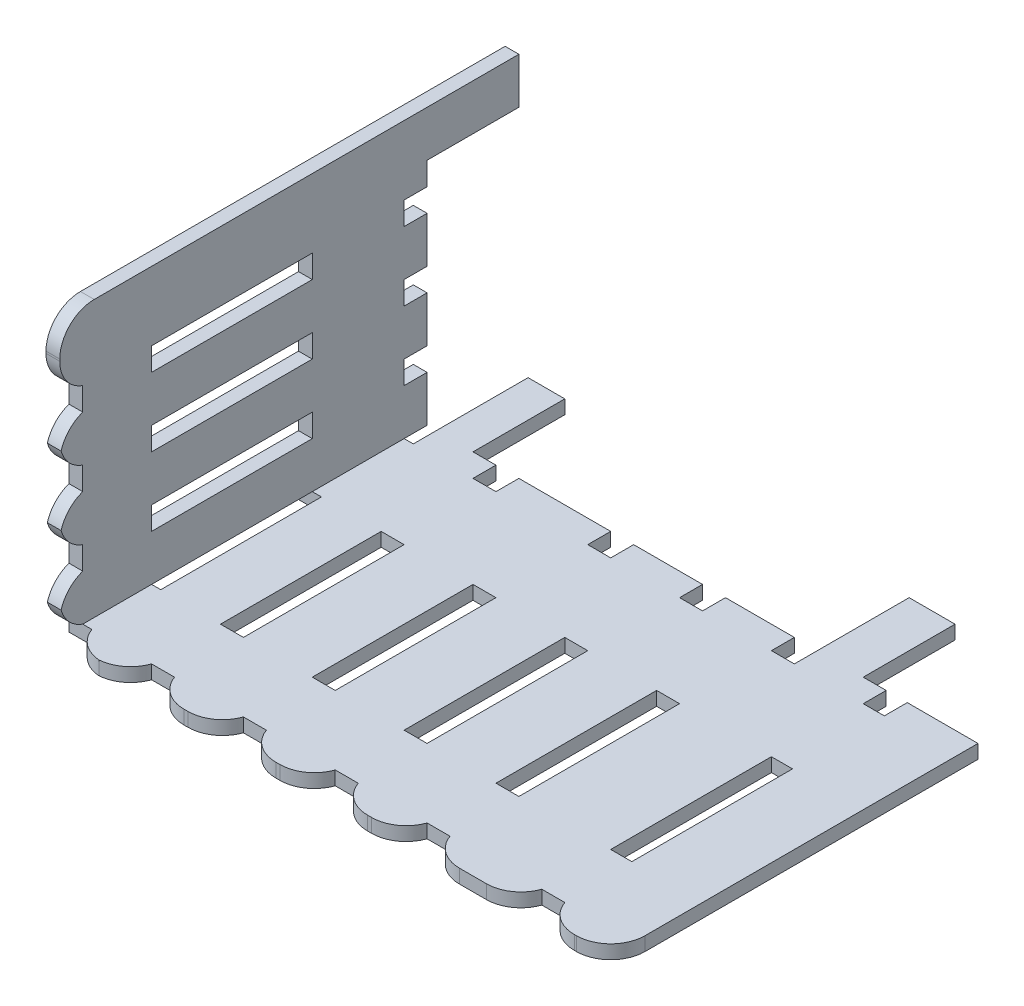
ISO-10303-21;
HEADER;
FILE_DESCRIPTION(('STEP AP214'),'2;1');
FILE_NAME('part.step','',(''),(''),'','','');
FILE_SCHEMA(('AUTOMOTIVE_DESIGN { 1 0 10303 214 1 1 1 1 }'));
ENDSEC;
DATA;
#1=APPLICATION_CONTEXT('core data for automotive mechanical design processes');
#2=APPLICATION_PROTOCOL_DEFINITION('international standard','automotive_design',2000,#1);
#3=PRODUCT_CONTEXT('',#1,'mechanical');
#4=PRODUCT('Part','Part','',(#3));
#5=PRODUCT_RELATED_PRODUCT_CATEGORY('part','',(#4));
#6=PRODUCT_DEFINITION_FORMATION('','',#4);
#7=PRODUCT_DEFINITION_CONTEXT('part definition',#1,'design');
#8=PRODUCT_DEFINITION('design','',#6,#7);
#9=PRODUCT_DEFINITION_SHAPE('','',#8);
#10=(LENGTH_UNIT() NAMED_UNIT(*) SI_UNIT(.MILLI.,.METRE.));
#11=(NAMED_UNIT(*) PLANE_ANGLE_UNIT() SI_UNIT($,.RADIAN.));
#12=(NAMED_UNIT(*) SI_UNIT($,.STERADIAN.) SOLID_ANGLE_UNIT());
#13=UNCERTAINTY_MEASURE_WITH_UNIT(LENGTH_MEASURE(1.E-05),#10,'distance_accuracy_value','');
#14=(GEOMETRIC_REPRESENTATION_CONTEXT(3) GLOBAL_UNCERTAINTY_ASSIGNED_CONTEXT((#13)) GLOBAL_UNIT_ASSIGNED_CONTEXT((#10,
#11,#12)) REPRESENTATION_CONTEXT('',''));
#15=CARTESIAN_POINT('',(0.,0.,0.));
#16=DIRECTION('',(0.,0.,1.));
#17=DIRECTION('',(1.,0.,0.));
#18=AXIS2_PLACEMENT_3D('',#15,#16,#17);
#19=CARTESIAN_POINT('',(0.,0.,20.));
#20=DIRECTION('',(0.,0.,1.));
#21=DIRECTION('',(1.,0.,0.));
#22=AXIS2_PLACEMENT_3D('',#19,#20,#21);
#23=PLANE('',#22);
#24=DIRECTION('',(0.,1.,0.));
#25=VECTOR('',#24,1.);
#26=CARTESIAN_POINT('',(0.,0.,20.));
#27=LINE('',#26,#25);
#28=CARTESIAN_POINT('',(0.,15.,20.));
#29=VERTEX_POINT('',#28);
#30=CARTESIAN_POINT('',(0.,25.,20.));
#31=VERTEX_POINT('',#30);
#32=EDGE_CURVE('E988',#29,#31,#27,.T.);
#33=ORIENTED_EDGE('',*,*,#32,.F.);
#34=DIRECTION('',(-1.,0.,0.));
#35=VECTOR('',#34,1.);
#36=CARTESIAN_POINT('',(0.,15.,20.));
#37=LINE('',#36,#35);
#38=CARTESIAN_POINT('',(-3.,15.,20.));
#39=VERTEX_POINT('',#38);
#40=EDGE_CURVE('E921',#29,#39,#37,.T.);
#41=ORIENTED_EDGE('',*,*,#40,.T.);
#42=DIRECTION('',(0.,1.,0.));
#43=VECTOR('',#42,1.);
#44=CARTESIAN_POINT('',(-3.,0.,20.));
#45=LINE('',#44,#43);
#46=CARTESIAN_POINT('',(-3.,25.,20.));
#47=VERTEX_POINT('',#46);
#48=EDGE_CURVE('E997',#39,#47,#45,.T.);
#49=ORIENTED_EDGE('',*,*,#48,.T.);
#50=DIRECTION('',(-1.,0.,0.));
#51=VECTOR('',#50,1.);
#52=CARTESIAN_POINT('',(0.,25.,20.));
#53=LINE('',#52,#51);
#54=EDGE_CURVE('E940',#31,#47,#53,.T.);
#55=ORIENTED_EDGE('',*,*,#54,.F.);
#56=EDGE_LOOP('',(#33,#41,#49,#55));
#57=FACE_BOUND('',#56,.T.);
#58=ADVANCED_FACE('F33',(#57),#23,.F.);
#59=CARTESIAN_POINT('',(0.,30.,20.));
#60=VERTEX_POINT('',#59);
#61=CARTESIAN_POINT('',(0.,40.,20.));
#62=VERTEX_POINT('',#61);
#63=EDGE_CURVE('E1700',#60,#62,#27,.T.);
#64=ORIENTED_EDGE('',*,*,#63,.F.);
#65=DIRECTION('',(-1.,0.,0.));
#66=VECTOR('',#65,1.);
#67=CARTESIAN_POINT('',(0.,30.,20.));
#68=LINE('',#67,#66);
#69=CARTESIAN_POINT('',(-3.,30.,20.));
#70=VERTEX_POINT('',#69);
#71=EDGE_CURVE('E947',#60,#70,#68,.T.);
#72=ORIENTED_EDGE('',*,*,#71,.T.);
#73=CARTESIAN_POINT('',(-3.,40.,20.));
#74=VERTEX_POINT('',#73);
#75=EDGE_CURVE('E1680',#70,#74,#45,.T.);
#76=ORIENTED_EDGE('',*,*,#75,.T.);
#77=DIRECTION('',(-1.,0.,0.));
#78=VECTOR('',#77,1.);
#79=CARTESIAN_POINT('',(0.,40.,20.));
#80=LINE('',#79,#78);
#81=EDGE_CURVE('E967',#62,#74,#80,.T.);
#82=ORIENTED_EDGE('',*,*,#81,.F.);
#83=EDGE_LOOP('',(#64,#72,#76,#82));
#84=FACE_BOUND('',#83,.T.);
#85=ADVANCED_FACE('F1713',(#84),#23,.F.);
#86=CARTESIAN_POINT('',(0.,45.,20.));
#87=VERTEX_POINT('',#86);
#88=CARTESIAN_POINT('',(0.,50.,20.));
#89=VERTEX_POINT('',#88);
#90=EDGE_CURVE('E989',#87,#89,#27,.T.);
#91=ORIENTED_EDGE('',*,*,#90,.F.);
#92=DIRECTION('',(-1.,0.,0.));
#93=VECTOR('',#92,1.);
#94=CARTESIAN_POINT('',(0.,45.,20.));
#95=LINE('',#94,#93);
#96=CARTESIAN_POINT('',(-3.,45.,20.));
#97=VERTEX_POINT('',#96);
#98=EDGE_CURVE('E974',#87,#97,#95,.T.);
#99=ORIENTED_EDGE('',*,*,#98,.T.);
#100=CARTESIAN_POINT('',(-3.,50.,20.));
#101=VERTEX_POINT('',#100);
#102=EDGE_CURVE('E977',#97,#101,#45,.T.);
#103=ORIENTED_EDGE('',*,*,#102,.T.);
#104=DIRECTION('',(-1.,0.,0.));
#105=VECTOR('',#104,1.);
#106=CARTESIAN_POINT('',(0.,50.,20.));
#107=LINE('',#106,#105);
#108=EDGE_CURVE('E1003',#89,#101,#107,.T.);
#109=ORIENTED_EDGE('',*,*,#108,.F.);
#110=EDGE_LOOP('',(#91,#99,#103,#109));
#111=FACE_BOUND('',#110,.T.);
#112=ADVANCED_FACE('F1679',(#111),#23,.F.);
#113=CARTESIAN_POINT('',(120.,-3.,100.));
#114=DIRECTION('',(0.,0.,-1.));
#115=DIRECTION('',(-1.,0.,0.));
#116=AXIS2_PLACEMENT_3D('',#113,#114,#115);
#117=PLANE('',#116);
#118=DIRECTION('',(1.,0.,0.));
#119=VECTOR('',#118,1.);
#120=CARTESIAN_POINT('',(0.,-3.,100.));
#121=LINE('',#120,#119);
#122=CARTESIAN_POINT('',(87.0710678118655,-3.,100.));
#123=VERTEX_POINT('',#122);
#124=CARTESIAN_POINT('',(92.9289321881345,-3.,100.));
#125=VERTEX_POINT('',#124);
#126=EDGE_CURVE('E1477',#123,#125,#121,.T.);
#127=ORIENTED_EDGE('',*,*,#126,.T.);
#128=DIRECTION('',(0.,-1.,0.));
#129=VECTOR('',#128,1.);
#130=CARTESIAN_POINT('',(92.9289321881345,-3.,100.));
#131=LINE('',#130,#129);
#132=CARTESIAN_POINT('',(92.9289321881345,0.,100.));
#133=VERTEX_POINT('',#132);
#134=EDGE_CURVE('E1578',#125,#133,#131,.F.);
#135=ORIENTED_EDGE('',*,*,#134,.T.);
#136=DIRECTION('',(1.,0.,0.));
#137=VECTOR('',#136,1.);
#138=CARTESIAN_POINT('',(0.,0.,100.));
#139=LINE('',#138,#137);
#140=CARTESIAN_POINT('',(87.0710678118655,0.,100.));
#141=VERTEX_POINT('',#140);
#142=EDGE_CURVE('E1480',#141,#133,#139,.T.);
#143=ORIENTED_EDGE('',*,*,#142,.F.);
#144=DIRECTION('',(0.,1.,0.));
#145=VECTOR('',#144,1.);
#146=CARTESIAN_POINT('',(87.0710678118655,-3.,100.));
#147=LINE('',#146,#145);
#148=EDGE_CURVE('E1575',#141,#123,#147,.F.);
#149=ORIENTED_EDGE('',*,*,#148,.T.);
#150=EDGE_LOOP('',(#127,#135,#143,#149));
#151=FACE_BOUND('',#150,.T.);
#152=ADVANCED_FACE('F1742',(#151),#117,.F.);
#153=CARTESIAN_POINT('',(120.,0.,20.));
#154=DIRECTION('',(0.,0.,1.));
#155=DIRECTION('',(1.,0.,0.));
#156=AXIS2_PLACEMENT_3D('',#153,#154,#155);
#157=PLANE('',#156);
#158=DIRECTION('',(-1.,0.,0.));
#159=VECTOR('',#158,1.);
#160=CARTESIAN_POINT('',(120.,0.,20.));
#161=LINE('',#160,#159);
#162=CARTESIAN_POINT('',(100.,0.,20.));
#163=VERTEX_POINT('',#162);
#164=CARTESIAN_POINT('',(95.,0.,20.));
#165=VERTEX_POINT('',#164);
#166=EDGE_CURVE('E1455',#163,#165,#161,.T.);
#167=ORIENTED_EDGE('',*,*,#166,.F.);
#168=DIRECTION('',(0.,-1.,0.));
#169=VECTOR('',#168,1.);
#170=CARTESIAN_POINT('',(100.,0.,20.));
#171=LINE('',#170,#169);
#172=CARTESIAN_POINT('',(100.,-3.,20.));
#173=VERTEX_POINT('',#172);
#174=EDGE_CURVE('E1062',#163,#173,#171,.T.);
#175=ORIENTED_EDGE('',*,*,#174,.T.);
#176=DIRECTION('',(-1.,0.,0.));
#177=VECTOR('',#176,1.);
#178=CARTESIAN_POINT('',(120.,-3.,20.));
#179=LINE('',#178,#177);
#180=CARTESIAN_POINT('',(95.,-3.,20.));
#181=VERTEX_POINT('',#180);
#182=EDGE_CURVE('E1445',#173,#181,#179,.T.);
#183=ORIENTED_EDGE('',*,*,#182,.T.);
#184=DIRECTION('',(0.,-1.,0.));
#185=VECTOR('',#184,1.);
#186=CARTESIAN_POINT('',(95.,0.,20.));
#187=LINE('',#186,#185);
#188=EDGE_CURVE('E1469',#165,#181,#187,.T.);
#189=ORIENTED_EDGE('',*,*,#188,.F.);
#190=EDGE_LOOP('',(#167,#175,#183,#189));
#191=FACE_BOUND('',#190,.T.);
#192=ADVANCED_FACE('F1746',(#191),#157,.F.);
#193=CARTESIAN_POINT('',(67.0710678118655,-3.,100.));
#194=VERTEX_POINT('',#193);
#195=CARTESIAN_POINT('',(67.9289321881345,-3.,100.));
#196=VERTEX_POINT('',#195);
#197=EDGE_CURVE('E3086',#194,#196,#121,.T.);
#198=ORIENTED_EDGE('',*,*,#197,.T.);
#199=DIRECTION('',(0.,-1.,0.));
#200=VECTOR('',#199,1.);
#201=CARTESIAN_POINT('',(67.9289321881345,-3.,100.));
#202=LINE('',#201,#200);
#203=CARTESIAN_POINT('',(67.9289321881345,0.,100.));
#204=VERTEX_POINT('',#203);
#205=EDGE_CURVE('E1583',#196,#204,#202,.F.);
#206=ORIENTED_EDGE('',*,*,#205,.T.);
#207=CARTESIAN_POINT('',(67.0710678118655,0.,100.));
#208=VERTEX_POINT('',#207);
#209=EDGE_CURVE('E1483',#208,#204,#139,.T.);
#210=ORIENTED_EDGE('',*,*,#209,.F.);
#211=DIRECTION('',(0.,1.,0.));
#212=VECTOR('',#211,1.);
#213=CARTESIAN_POINT('',(67.0710678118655,-3.,100.));
#214=LINE('',#213,#212);
#215=EDGE_CURVE('E1580',#208,#194,#214,.F.);
#216=ORIENTED_EDGE('',*,*,#215,.T.);
#217=EDGE_LOOP('',(#198,#206,#210,#216));
#218=FACE_BOUND('',#217,.T.);
#219=ADVANCED_FACE('F1749',(#218),#117,.F.);
#220=CARTESIAN_POINT('',(47.0710678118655,-3.,100.));
#221=VERTEX_POINT('',#220);
#222=CARTESIAN_POINT('',(47.9289321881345,-3.,100.));
#223=VERTEX_POINT('',#222);
#224=EDGE_CURVE('E1797',#221,#223,#121,.T.);
#225=ORIENTED_EDGE('',*,*,#224,.T.);
#226=DIRECTION('',(0.,-1.,0.));
#227=VECTOR('',#226,1.);
#228=CARTESIAN_POINT('',(47.9289321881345,-3.,100.));
#229=LINE('',#228,#227);
#230=CARTESIAN_POINT('',(47.9289321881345,0.,100.));
#231=VERTEX_POINT('',#230);
#232=EDGE_CURVE('E1588',#223,#231,#229,.F.);
#233=ORIENTED_EDGE('',*,*,#232,.T.);
#234=CARTESIAN_POINT('',(47.0710678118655,0.,100.));
#235=VERTEX_POINT('',#234);
#236=EDGE_CURVE('E1816',#235,#231,#139,.T.);
#237=ORIENTED_EDGE('',*,*,#236,.F.);
#238=DIRECTION('',(0.,1.,0.));
#239=VECTOR('',#238,1.);
#240=CARTESIAN_POINT('',(47.0710678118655,-3.,100.));
#241=LINE('',#240,#239);
#242=EDGE_CURVE('E1585',#235,#221,#241,.F.);
#243=ORIENTED_EDGE('',*,*,#242,.T.);
#244=EDGE_LOOP('',(#225,#233,#237,#243));
#245=FACE_BOUND('',#244,.T.);
#246=ADVANCED_FACE('F1760',(#245),#117,.F.);
#247=CARTESIAN_POINT('',(27.0710678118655,-3.,100.));
#248=VERTEX_POINT('',#247);
#249=CARTESIAN_POINT('',(27.9289321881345,-3.,100.));
#250=VERTEX_POINT('',#249);
#251=EDGE_CURVE('E1479',#248,#250,#121,.T.);
#252=ORIENTED_EDGE('',*,*,#251,.T.);
#253=DIRECTION('',(0.,-1.,0.));
#254=VECTOR('',#253,1.);
#255=CARTESIAN_POINT('',(27.9289321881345,-3.,100.));
#256=LINE('',#255,#254);
#257=CARTESIAN_POINT('',(27.9289321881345,0.,100.));
#258=VERTEX_POINT('',#257);
#259=EDGE_CURVE('E1593',#250,#258,#256,.F.);
#260=ORIENTED_EDGE('',*,*,#259,.T.);
#261=CARTESIAN_POINT('',(27.0710678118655,0.,100.));
#262=VERTEX_POINT('',#261);
#263=EDGE_CURVE('E1489',#262,#258,#139,.T.);
#264=ORIENTED_EDGE('',*,*,#263,.F.);
#265=DIRECTION('',(0.,1.,0.));
#266=VECTOR('',#265,1.);
#267=CARTESIAN_POINT('',(27.0710678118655,-3.,100.));
#268=LINE('',#267,#266);
#269=EDGE_CURVE('E1590',#262,#248,#268,.F.);
#270=ORIENTED_EDGE('',*,*,#269,.T.);
#271=EDGE_LOOP('',(#252,#260,#264,#270));
#272=FACE_BOUND('',#271,.T.);
#273=ADVANCED_FACE('F1776',(#272),#117,.F.);
#274=DIRECTION('',(0.,-1.,0.));
#275=VECTOR('',#274,1.);
#276=CARTESIAN_POINT('',(-3.,60.,100.));
#277=LINE('',#276,#275);
#278=CARTESIAN_POINT('',(-3.,52.5,100.));
#279=VERTEX_POINT('',#278);
#280=CARTESIAN_POINT('',(-3.,52.0710678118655,100.));
#281=VERTEX_POINT('',#280);
#282=EDGE_CURVE('E1488',#279,#281,#277,.T.);
#283=ORIENTED_EDGE('',*,*,#282,.T.);
#284=DIRECTION('',(-1.,0.,0.));
#285=VECTOR('',#284,1.);
#286=CARTESIAN_POINT('',(120.,52.0710678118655,100.));
#287=LINE('',#286,#285);
#288=CARTESIAN_POINT('',(0.,52.0710678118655,100.));
#289=VERTEX_POINT('',#288);
#290=EDGE_CURVE('E42',#281,#289,#287,.F.);
#291=ORIENTED_EDGE('',*,*,#290,.T.);
#292=DIRECTION('',(0.,-1.,0.));
#293=VECTOR('',#292,1.);
#294=CARTESIAN_POINT('',(0.,60.,100.));
#295=LINE('',#294,#293);
#296=CARTESIAN_POINT('',(0.,52.5,100.));
#297=VERTEX_POINT('',#296);
#298=EDGE_CURVE('E1485',#297,#289,#295,.T.);
#299=ORIENTED_EDGE('',*,*,#298,.F.);
#300=DIRECTION('',(1.,0.,0.));
#301=VECTOR('',#300,1.);
#302=CARTESIAN_POINT('',(-3.,52.5,100.));
#303=LINE('',#302,#301);
#304=EDGE_CURVE('E1624',#297,#279,#303,.F.);
#305=ORIENTED_EDGE('',*,*,#304,.T.);
#306=EDGE_LOOP('',(#283,#291,#299,#305));
#307=FACE_BOUND('',#306,.T.);
#308=ADVANCED_FACE('F1656',(#307),#117,.F.);
#309=CARTESIAN_POINT('',(85.,0.,20.));
#310=DIRECTION('',(0.,0.,1.));
#311=DIRECTION('',(1.,0.,0.));
#312=AXIS2_PLACEMENT_3D('',#309,#310,#311);
#313=PLANE('',#312);
#314=DIRECTION('',(-1.,0.,0.));
#315=VECTOR('',#314,1.);
#316=CARTESIAN_POINT('',(85.,0.,20.));
#317=LINE('',#316,#315);
#318=CARTESIAN_POINT('',(60.,0.,20.));
#319=VERTEX_POINT('',#318);
#320=CARTESIAN_POINT('',(45.,0.,20.));
#321=VERTEX_POINT('',#320);
#322=EDGE_CURVE('E1432',#319,#321,#317,.T.);
#323=ORIENTED_EDGE('',*,*,#322,.F.);
#324=DIRECTION('',(0.,-1.,0.));
#325=VECTOR('',#324,1.);
#326=CARTESIAN_POINT('',(60.,0.,20.));
#327=LINE('',#326,#325);
#328=CARTESIAN_POINT('',(60.,-3.,20.));
#329=VERTEX_POINT('',#328);
#330=EDGE_CURVE('E1329',#319,#329,#327,.T.);
#331=ORIENTED_EDGE('',*,*,#330,.T.);
#332=DIRECTION('',(-1.,0.,0.));
#333=VECTOR('',#332,1.);
#334=CARTESIAN_POINT('',(85.,-3.,20.));
#335=LINE('',#334,#333);
#336=CARTESIAN_POINT('',(45.,-3.,20.));
#337=VERTEX_POINT('',#336);
#338=EDGE_CURVE('E1440',#329,#337,#335,.T.);
#339=ORIENTED_EDGE('',*,*,#338,.T.);
#340=DIRECTION('',(0.,-1.,0.));
#341=VECTOR('',#340,1.);
#342=CARTESIAN_POINT('',(45.,0.,20.));
#343=LINE('',#342,#341);
#344=EDGE_CURVE('E1368',#321,#337,#343,.T.);
#345=ORIENTED_EDGE('',*,*,#344,.F.);
#346=EDGE_LOOP('',(#323,#331,#339,#345));
#347=FACE_BOUND('',#346,.T.);
#348=ADVANCED_FACE('F1775',(#347),#313,.F.);
#349=CARTESIAN_POINT('',(40.,0.,20.));
#350=VERTEX_POINT('',#349);
#351=CARTESIAN_POINT('',(20.,0.,20.));
#352=VERTEX_POINT('',#351);
#353=EDGE_CURVE('E1925',#350,#352,#317,.T.);
#354=ORIENTED_EDGE('',*,*,#353,.F.);
#355=DIRECTION('',(0.,-1.,0.));
#356=VECTOR('',#355,1.);
#357=CARTESIAN_POINT('',(40.,0.,20.));
#358=LINE('',#357,#356);
#359=CARTESIAN_POINT('',(40.,-3.,20.));
#360=VERTEX_POINT('',#359);
#361=EDGE_CURVE('E1356',#350,#360,#358,.T.);
#362=ORIENTED_EDGE('',*,*,#361,.T.);
#363=CARTESIAN_POINT('',(20.,-3.,20.));
#364=VERTEX_POINT('',#363);
#365=EDGE_CURVE('E2996',#360,#364,#335,.T.);
#366=ORIENTED_EDGE('',*,*,#365,.T.);
#367=DIRECTION('',(0.,-1.,0.));
#368=VECTOR('',#367,1.);
#369=CARTESIAN_POINT('',(20.,0.,20.));
#370=LINE('',#369,#368);
#371=EDGE_CURVE('E1390',#352,#364,#370,.T.);
#372=ORIENTED_EDGE('',*,*,#371,.F.);
#373=EDGE_LOOP('',(#354,#362,#366,#372));
#374=FACE_BOUND('',#373,.T.);
#375=ADVANCED_FACE('F1781',(#374),#313,.F.);
#376=CARTESIAN_POINT('',(80.,0.,20.));
#377=VERTEX_POINT('',#376);
#378=CARTESIAN_POINT('',(65.,0.,20.));
#379=VERTEX_POINT('',#378);
#380=EDGE_CURVE('E1429',#377,#379,#317,.T.);
#381=ORIENTED_EDGE('',*,*,#380,.F.);
#382=DIRECTION('',(0.,-1.,0.));
#383=VECTOR('',#382,1.);
#384=CARTESIAN_POINT('',(80.,0.,20.));
#385=LINE('',#384,#383);
#386=CARTESIAN_POINT('',(80.,-3.,20.));
#387=VERTEX_POINT('',#386);
#388=EDGE_CURVE('E1307',#377,#387,#385,.T.);
#389=ORIENTED_EDGE('',*,*,#388,.T.);
#390=CARTESIAN_POINT('',(65.,-3.,20.));
#391=VERTEX_POINT('',#390);
#392=EDGE_CURVE('E1438',#387,#391,#335,.T.);
#393=ORIENTED_EDGE('',*,*,#392,.T.);
#394=DIRECTION('',(0.,-1.,0.));
#395=VECTOR('',#394,1.);
#396=CARTESIAN_POINT('',(65.,0.,20.));
#397=LINE('',#396,#395);
#398=EDGE_CURVE('E1341',#379,#391,#397,.T.);
#399=ORIENTED_EDGE('',*,*,#398,.F.);
#400=EDGE_LOOP('',(#381,#389,#393,#399));
#401=FACE_BOUND('',#400,.T.);
#402=ADVANCED_FACE('F1910',(#401),#313,.F.);
#403=CARTESIAN_POINT('',(120.,-3.,0.));
#404=DIRECTION('',(0.,0.,-1.));
#405=DIRECTION('',(-1.,0.,0.));
#406=AXIS2_PLACEMENT_3D('',#403,#404,#405);
#407=PLANE('',#406);
#408=DIRECTION('',(-1.,0.,0.));
#409=VECTOR('',#408,1.);
#410=CARTESIAN_POINT('',(0.,50.,0.));
#411=LINE('',#410,#409);
#412=CARTESIAN_POINT('',(0.,50.,0.));
#413=VERTEX_POINT('',#412);
#414=CARTESIAN_POINT('',(-3.,50.,0.));
#415=VERTEX_POINT('',#414);
#416=EDGE_CURVE('E999',#413,#415,#411,.T.);
#417=ORIENTED_EDGE('',*,*,#416,.T.);
#418=DIRECTION('',(0.,-1.,0.));
#419=VECTOR('',#418,1.);
#420=CARTESIAN_POINT('',(-3.,60.,0.));
#421=LINE('',#420,#419);
#422=CARTESIAN_POINT('',(-3.,60.,0.));
#423=VERTEX_POINT('',#422);
#424=EDGE_CURVE('E1478',#423,#415,#421,.T.);
#425=ORIENTED_EDGE('',*,*,#424,.F.);
#426=DIRECTION('',(1.,0.,0.));
#427=VECTOR('',#426,1.);
#428=CARTESIAN_POINT('',(-3.,60.,0.));
#429=LINE('',#428,#427);
#430=CARTESIAN_POINT('',(0.,60.,0.));
#431=VERTEX_POINT('',#430);
#432=EDGE_CURVE('E1501',#423,#431,#429,.T.);
#433=ORIENTED_EDGE('',*,*,#432,.T.);
#434=DIRECTION('',(0.,-1.,0.));
#435=VECTOR('',#434,1.);
#436=CARTESIAN_POINT('',(0.,60.,0.));
#437=LINE('',#436,#435);
#438=EDGE_CURVE('E1498',#431,#413,#437,.T.);
#439=ORIENTED_EDGE('',*,*,#438,.T.);
#440=EDGE_LOOP('',(#417,#425,#433,#439));
#441=FACE_BOUND('',#440,.T.);
#442=ADVANCED_FACE('F1669',(#441),#407,.T.);
#443=DIRECTION('',(0.,-1.,0.));
#444=VECTOR('',#443,1.);
#445=CARTESIAN_POINT('',(85.,0.,0.));
#446=LINE('',#445,#444);
#447=CARTESIAN_POINT('',(85.,0.,0.));
#448=VERTEX_POINT('',#447);
#449=CARTESIAN_POINT('',(85.,-3.,0.));
#450=VERTEX_POINT('',#449);
#451=EDGE_CURVE('E1443',#448,#450,#446,.T.);
#452=ORIENTED_EDGE('',*,*,#451,.F.);
#453=DIRECTION('',(1.,0.,0.));
#454=VECTOR('',#453,1.);
#455=CARTESIAN_POINT('',(0.,0.,0.));
#456=LINE('',#455,#454);
#457=CARTESIAN_POINT('',(95.,0.,0.));
#458=VERTEX_POINT('',#457);
#459=EDGE_CURVE('E1495',#448,#458,#456,.T.);
#460=ORIENTED_EDGE('',*,*,#459,.T.);
#461=DIRECTION('',(0.,-1.,0.));
#462=VECTOR('',#461,1.);
#463=CARTESIAN_POINT('',(95.,0.,0.));
#464=LINE('',#463,#462);
#465=CARTESIAN_POINT('',(95.,-3.,0.));
#466=VERTEX_POINT('',#465);
#467=EDGE_CURVE('E1465',#458,#466,#464,.T.);
#468=ORIENTED_EDGE('',*,*,#467,.T.);
#469=DIRECTION('',(1.,0.,0.));
#470=VECTOR('',#469,1.);
#471=CARTESIAN_POINT('',(0.,-3.,0.));
#472=LINE('',#471,#470);
#473=EDGE_CURVE('E1468',#450,#466,#472,.T.);
#474=ORIENTED_EDGE('',*,*,#473,.F.);
#475=EDGE_LOOP('',(#452,#460,#468,#474));
#476=FACE_BOUND('',#475,.T.);
#477=ADVANCED_FACE('F1771',(#476),#407,.T.);
#478=CARTESIAN_POINT('',(0.,-3.,100.));
#479=DIRECTION('',(0.,1.,0.));
#480=DIRECTION('',(0.,0.,1.));
#481=AXIS2_PLACEMENT_3D('',#478,#479,#480);
#482=PLANE('',#481);
#483=DIRECTION('',(1.,0.,0.));
#484=VECTOR('',#483,1.);
#485=CARTESIAN_POINT('',(100.,-3.,45.));
#486=LINE('',#485,#484);
#487=CARTESIAN_POINT('',(100.,-3.,45.));
#488=VERTEX_POINT('',#487);
#489=CARTESIAN_POINT('',(104.597364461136,-3.,45.));
#490=VERTEX_POINT('',#489);
#491=EDGE_CURVE('E1035',#488,#490,#486,.T.);
#492=ORIENTED_EDGE('',*,*,#491,.F.);
#493=DIRECTION('',(0.,0.,-1.));
#494=VECTOR('',#493,1.);
#495=CARTESIAN_POINT('',(100.,-3.,45.));
#496=LINE('',#495,#494);
#497=CARTESIAN_POINT('',(100.,-3.,80.));
#498=VERTEX_POINT('',#497);
#499=EDGE_CURVE('E1017',#498,#488,#496,.T.);
#500=ORIENTED_EDGE('',*,*,#499,.F.);
#501=DIRECTION('',(-1.,0.,0.));
#502=VECTOR('',#501,1.);
#503=CARTESIAN_POINT('',(100.,-3.,80.));
#504=LINE('',#503,#502);
#505=CARTESIAN_POINT('',(104.597364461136,-3.,80.));
#506=VERTEX_POINT('',#505);
#507=EDGE_CURVE('E1024',#506,#498,#504,.T.);
#508=ORIENTED_EDGE('',*,*,#507,.F.);
#509=DIRECTION('',(0.,0.,1.));
#510=VECTOR('',#509,1.);
#511=CARTESIAN_POINT('',(104.597364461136,-3.,45.));
#512=LINE('',#511,#510);
#513=EDGE_CURVE('E1038',#490,#506,#512,.T.);
#514=ORIENTED_EDGE('',*,*,#513,.F.);
#515=EDGE_LOOP('',(#492,#500,#508,#514));
#516=FACE_BOUND('',#515,.T.);
#517=DIRECTION('',(1.,0.,0.));
#518=VECTOR('',#517,1.);
#519=CARTESIAN_POINT('',(35.,-3.,45.));
#520=LINE('',#519,#518);
#521=CARTESIAN_POINT('',(35.,-3.,45.));
#522=VERTEX_POINT('',#521);
#523=CARTESIAN_POINT('',(40.,-3.,45.));
#524=VERTEX_POINT('',#523);
#525=EDGE_CURVE('E1093',#522,#524,#520,.T.);
#526=ORIENTED_EDGE('',*,*,#525,.F.);
#527=DIRECTION('',(0.,0.,-1.));
#528=VECTOR('',#527,1.);
#529=CARTESIAN_POINT('',(35.,-3.,80.));
#530=LINE('',#529,#528);
#531=CARTESIAN_POINT('',(35.,-3.,80.));
#532=VERTEX_POINT('',#531);
#533=EDGE_CURVE('E1071',#532,#522,#530,.T.);
#534=ORIENTED_EDGE('',*,*,#533,.F.);
#535=DIRECTION('',(-1.,0.,0.));
#536=VECTOR('',#535,1.);
#537=CARTESIAN_POINT('',(35.,-3.,80.));
#538=LINE('',#537,#536);
#539=CARTESIAN_POINT('',(40.,-3.,80.));
#540=VERTEX_POINT('',#539);
#541=EDGE_CURVE('E1082',#540,#532,#538,.T.);
#542=ORIENTED_EDGE('',*,*,#541,.F.);
#543=DIRECTION('',(0.,0.,1.));
#544=VECTOR('',#543,1.);
#545=CARTESIAN_POINT('',(40.,-3.,80.));
#546=LINE('',#545,#544);
#547=EDGE_CURVE('E1096',#524,#540,#546,.T.);
#548=ORIENTED_EDGE('',*,*,#547,.F.);
#549=EDGE_LOOP('',(#526,#534,#542,#548));
#550=FACE_BOUND('',#549,.T.);
#551=DIRECTION('',(1.,0.,0.));
#552=VECTOR('',#551,1.);
#553=CARTESIAN_POINT('',(75.,-3.,45.));
#554=LINE('',#553,#552);
#555=CARTESIAN_POINT('',(75.,-3.,45.));
#556=VERTEX_POINT('',#555);
#557=CARTESIAN_POINT('',(80.,-3.,45.));
#558=VERTEX_POINT('',#557);
#559=EDGE_CURVE('E1125',#556,#558,#554,.T.);
#560=ORIENTED_EDGE('',*,*,#559,.F.);
#561=DIRECTION('',(0.,0.,-1.));
#562=VECTOR('',#561,1.);
#563=CARTESIAN_POINT('',(75.,-3.,80.));
#564=LINE('',#563,#562);
#565=CARTESIAN_POINT('',(75.,-3.,80.));
#566=VERTEX_POINT('',#565);
#567=EDGE_CURVE('E1103',#566,#556,#564,.T.);
#568=ORIENTED_EDGE('',*,*,#567,.F.);
#569=DIRECTION('',(-1.,0.,0.));
#570=VECTOR('',#569,1.);
#571=CARTESIAN_POINT('',(75.,-3.,80.));
#572=LINE('',#571,#570);
#573=CARTESIAN_POINT('',(80.,-3.,80.));
#574=VERTEX_POINT('',#573);
#575=EDGE_CURVE('E1114',#574,#566,#572,.T.);
#576=ORIENTED_EDGE('',*,*,#575,.F.);
#577=DIRECTION('',(0.,0.,1.));
#578=VECTOR('',#577,1.);
#579=CARTESIAN_POINT('',(80.,-3.,80.));
#580=LINE('',#579,#578);
#581=EDGE_CURVE('E1128',#558,#574,#580,.T.);
#582=ORIENTED_EDGE('',*,*,#581,.F.);
#583=EDGE_LOOP('',(#560,#568,#576,#582));
#584=FACE_BOUND('',#583,.T.);
#585=DIRECTION('',(1.,0.,0.));
#586=VECTOR('',#585,1.);
#587=CARTESIAN_POINT('',(55.,-3.,45.));
#588=LINE('',#587,#586);
#589=CARTESIAN_POINT('',(55.,-3.,45.));
#590=VERTEX_POINT('',#589);
#591=CARTESIAN_POINT('',(60.,-3.,45.));
#592=VERTEX_POINT('',#591);
#593=EDGE_CURVE('E1157',#590,#592,#588,.T.);
#594=ORIENTED_EDGE('',*,*,#593,.F.);
#595=DIRECTION('',(0.,0.,-1.));
#596=VECTOR('',#595,1.);
#597=CARTESIAN_POINT('',(55.,-3.,80.));
#598=LINE('',#597,#596);
#599=CARTESIAN_POINT('',(55.,-3.,80.));
#600=VERTEX_POINT('',#599);
#601=EDGE_CURVE('E1135',#600,#590,#598,.T.);
#602=ORIENTED_EDGE('',*,*,#601,.F.);
#603=DIRECTION('',(-1.,0.,0.));
#604=VECTOR('',#603,1.);
#605=CARTESIAN_POINT('',(55.,-3.,80.));
#606=LINE('',#605,#604);
#607=CARTESIAN_POINT('',(60.,-3.,80.));
#608=VERTEX_POINT('',#607);
#609=EDGE_CURVE('E1146',#608,#600,#606,.T.);
#610=ORIENTED_EDGE('',*,*,#609,.F.);
#611=DIRECTION('',(0.,0.,1.));
#612=VECTOR('',#611,1.);
#613=CARTESIAN_POINT('',(60.,-3.,80.));
#614=LINE('',#613,#612);
#615=EDGE_CURVE('E1160',#592,#608,#614,.T.);
#616=ORIENTED_EDGE('',*,*,#615,.F.);
#617=EDGE_LOOP('',(#594,#602,#610,#616));
#618=FACE_BOUND('',#617,.T.);
#619=DIRECTION('',(1.,0.,0.));
#620=VECTOR('',#619,1.);
#621=CARTESIAN_POINT('',(15.,-3.,45.));
#622=LINE('',#621,#620);
#623=CARTESIAN_POINT('',(15.,-3.,45.));
#624=VERTEX_POINT('',#623);
#625=CARTESIAN_POINT('',(20.,-3.,45.));
#626=VERTEX_POINT('',#625);
#627=EDGE_CURVE('E1237',#624,#626,#622,.T.);
#628=ORIENTED_EDGE('',*,*,#627,.F.);
#629=DIRECTION('',(0.,0.,-1.));
#630=VECTOR('',#629,1.);
#631=CARTESIAN_POINT('',(15.,-3.,80.));
#632=LINE('',#631,#630);
#633=CARTESIAN_POINT('',(15.,-3.,80.));
#634=VERTEX_POINT('',#633);
#635=EDGE_CURVE('E1219',#634,#624,#632,.T.);
#636=ORIENTED_EDGE('',*,*,#635,.F.);
#637=DIRECTION('',(-1.,0.,0.));
#638=VECTOR('',#637,1.);
#639=CARTESIAN_POINT('',(15.,-3.,80.));
#640=LINE('',#639,#638);
#641=CARTESIAN_POINT('',(20.,-3.,80.));
#642=VERTEX_POINT('',#641);
#643=EDGE_CURVE('E1226',#642,#634,#640,.T.);
#644=ORIENTED_EDGE('',*,*,#643,.F.);
#645=DIRECTION('',(0.,0.,1.));
#646=VECTOR('',#645,1.);
#647=CARTESIAN_POINT('',(20.,-3.,80.));
#648=LINE('',#647,#646);
#649=EDGE_CURVE('E1240',#626,#642,#648,.T.);
#650=ORIENTED_EDGE('',*,*,#649,.F.);
#651=EDGE_LOOP('',(#628,#636,#644,#650));
#652=FACE_BOUND('',#651,.T.);
#653=DIRECTION('',(0.,0.,-1.));
#654=VECTOR('',#653,1.);
#655=CARTESIAN_POINT('',(120.,-3.,100.));
#656=LINE('',#655,#654);
#657=CARTESIAN_POINT('',(120.,-3.,92.5));
#658=VERTEX_POINT('',#657);
#659=CARTESIAN_POINT('',(120.,-3.,20.));
#660=VERTEX_POINT('',#659);
#661=EDGE_CURVE('E1517',#658,#660,#656,.T.);
#662=ORIENTED_EDGE('',*,*,#661,.F.);
#663=CARTESIAN_POINT('',(112.5,-3.,92.5));
#664=DIRECTION('',(0.,1.,0.));
#665=DIRECTION('',(0.,0.,1.));
#666=AXIS2_PLACEMENT_3D('',#663,#664,#665);
#667=CIRCLE('',#666,7.5);
#668=CARTESIAN_POINT('',(112.5,-3.,100.));
#669=VERTEX_POINT('',#668);
#670=EDGE_CURVE('E1544',#658,#669,#667,.F.);
#671=ORIENTED_EDGE('',*,*,#670,.T.);
#672=CARTESIAN_POINT('',(112.071067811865,-3.,100.));
#673=VERTEX_POINT('',#672);
#674=EDGE_CURVE('E1474',#673,#669,#121,.T.);
#675=ORIENTED_EDGE('',*,*,#674,.F.);
#676=CARTESIAN_POINT('',(112.071067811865,-3.,92.5));
#677=DIRECTION('',(0.,1.,0.));
#678=DIRECTION('',(0.,0.,1.));
#679=AXIS2_PLACEMENT_3D('',#676,#677,#678);
#680=CIRCLE('',#679,7.5);
#681=CARTESIAN_POINT('',(105.,-3.,95.));
#682=VERTEX_POINT('',#681);
#683=EDGE_CURVE('E1542',#673,#682,#680,.F.);
#684=ORIENTED_EDGE('',*,*,#683,.T.);
#685=DIRECTION('',(1.,0.,0.));
#686=VECTOR('',#685,1.);
#687=CARTESIAN_POINT('',(100.,-3.,95.));
#688=LINE('',#687,#686);
#689=CARTESIAN_POINT('',(100.,-3.,95.));
#690=VERTEX_POINT('',#689);
#691=EDGE_CURVE('E1011',#690,#682,#688,.T.);
#692=ORIENTED_EDGE('',*,*,#691,.F.);
#693=CARTESIAN_POINT('',(92.9289321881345,-3.,92.5));
#694=DIRECTION('',(0.,1.,0.));
#695=DIRECTION('',(0.,0.,1.));
#696=AXIS2_PLACEMENT_3D('',#693,#694,#695);
#697=CIRCLE('',#696,7.5);
#698=EDGE_CURVE('E1540',#690,#125,#697,.F.);
#699=ORIENTED_EDGE('',*,*,#698,.T.);
#700=ORIENTED_EDGE('',*,*,#126,.F.);
#701=CARTESIAN_POINT('',(87.0710678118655,-3.,92.5));
#702=DIRECTION('',(0.,1.,0.));
#703=DIRECTION('',(0.,0.,1.));
#704=AXIS2_PLACEMENT_3D('',#701,#702,#703);
#705=CIRCLE('',#704,7.5);
#706=CARTESIAN_POINT('',(80.,-3.,95.));
#707=VERTEX_POINT('',#706);
#708=EDGE_CURVE('E1538',#123,#707,#705,.F.);
#709=ORIENTED_EDGE('',*,*,#708,.T.);
#710=DIRECTION('',(1.,0.,0.));
#711=VECTOR('',#710,1.);
#712=CARTESIAN_POINT('',(75.,-3.,95.));
#713=LINE('',#712,#711);
#714=CARTESIAN_POINT('',(75.,-3.,95.));
#715=VERTEX_POINT('',#714);
#716=EDGE_CURVE('E1167',#715,#707,#713,.T.);
#717=ORIENTED_EDGE('',*,*,#716,.F.);
#718=CARTESIAN_POINT('',(67.9289321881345,-3.,92.5));
#719=DIRECTION('',(0.,1.,0.));
#720=DIRECTION('',(0.,0.,1.));
#721=AXIS2_PLACEMENT_3D('',#718,#719,#720);
#722=CIRCLE('',#721,7.5);
#723=EDGE_CURVE('E1536',#715,#196,#722,.F.);
#724=ORIENTED_EDGE('',*,*,#723,.T.);
#725=ORIENTED_EDGE('',*,*,#197,.F.);
#726=CARTESIAN_POINT('',(67.0710678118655,-3.,92.5));
#727=DIRECTION('',(0.,1.,0.));
#728=DIRECTION('',(0.,0.,1.));
#729=AXIS2_PLACEMENT_3D('',#726,#727,#728);
#730=CIRCLE('',#729,7.5);
#731=CARTESIAN_POINT('',(60.,-3.,95.));
#732=VERTEX_POINT('',#731);
#733=EDGE_CURVE('E1534',#194,#732,#730,.F.);
#734=ORIENTED_EDGE('',*,*,#733,.T.);
#735=DIRECTION('',(1.,0.,0.));
#736=VECTOR('',#735,1.);
#737=CARTESIAN_POINT('',(55.,-3.,95.));
#738=LINE('',#737,#736);
#739=CARTESIAN_POINT('',(55.,-3.,95.));
#740=VERTEX_POINT('',#739);
#741=EDGE_CURVE('E1183',#740,#732,#738,.T.);
#742=ORIENTED_EDGE('',*,*,#741,.F.);
#743=CARTESIAN_POINT('',(47.9289321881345,-3.,92.5));
#744=DIRECTION('',(0.,1.,0.));
#745=DIRECTION('',(0.,0.,1.));
#746=AXIS2_PLACEMENT_3D('',#743,#744,#745);
#747=CIRCLE('',#746,7.5);
#748=EDGE_CURVE('E1532',#740,#223,#747,.F.);
#749=ORIENTED_EDGE('',*,*,#748,.T.);
#750=ORIENTED_EDGE('',*,*,#224,.F.);
#751=CARTESIAN_POINT('',(47.0710678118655,-3.,92.5));
#752=DIRECTION('',(0.,1.,0.));
#753=DIRECTION('',(0.,0.,1.));
#754=AXIS2_PLACEMENT_3D('',#751,#752,#753);
#755=CIRCLE('',#754,7.5);
#756=CARTESIAN_POINT('',(40.,-3.,95.));
#757=VERTEX_POINT('',#756);
#758=EDGE_CURVE('E1530',#221,#757,#755,.F.);
#759=ORIENTED_EDGE('',*,*,#758,.T.);
#760=DIRECTION('',(1.,0.,0.));
#761=VECTOR('',#760,1.);
#762=CARTESIAN_POINT('',(35.,-3.,95.));
#763=LINE('',#762,#761);
#764=CARTESIAN_POINT('',(35.,-3.,95.));
#765=VERTEX_POINT('',#764);
#766=EDGE_CURVE('E1195',#765,#757,#763,.T.);
#767=ORIENTED_EDGE('',*,*,#766,.F.);
#768=CARTESIAN_POINT('',(27.9289321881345,-3.,92.5));
#769=DIRECTION('',(0.,1.,0.));
#770=DIRECTION('',(0.,0.,1.));
#771=AXIS2_PLACEMENT_3D('',#768,#769,#770);
#772=CIRCLE('',#771,7.5);
#773=EDGE_CURVE('E1528',#765,#250,#772,.F.);
#774=ORIENTED_EDGE('',*,*,#773,.T.);
#775=ORIENTED_EDGE('',*,*,#251,.F.);
#776=CARTESIAN_POINT('',(27.0710678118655,-3.,92.5));
#777=DIRECTION('',(0.,1.,0.));
#778=DIRECTION('',(0.,0.,1.));
#779=AXIS2_PLACEMENT_3D('',#776,#777,#778);
#780=CIRCLE('',#779,7.5);
#781=CARTESIAN_POINT('',(20.,-3.,95.));
#782=VERTEX_POINT('',#781);
#783=EDGE_CURVE('E1526',#248,#782,#780,.F.);
#784=ORIENTED_EDGE('',*,*,#783,.T.);
#785=DIRECTION('',(1.,0.,0.));
#786=VECTOR('',#785,1.);
#787=CARTESIAN_POINT('',(15.,-3.,95.));
#788=LINE('',#787,#786);
#789=CARTESIAN_POINT('',(15.,-3.,95.));
#790=VERTEX_POINT('',#789);
#791=EDGE_CURVE('E1207',#790,#782,#788,.T.);
#792=ORIENTED_EDGE('',*,*,#791,.F.);
#793=CARTESIAN_POINT('',(7.92893218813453,-3.,92.5));
#794=DIRECTION('',(0.,1.,0.));
#795=DIRECTION('',(0.,0.,1.));
#796=AXIS2_PLACEMENT_3D('',#793,#794,#795);
#797=CIRCLE('',#796,7.5);
#798=CARTESIAN_POINT('',(8.5,-3.,99.9782271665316));
#799=VERTEX_POINT('',#798);
#800=EDGE_CURVE('E1524',#790,#799,#797,.F.);
#801=ORIENTED_EDGE('',*,*,#800,.T.);
#802=CARTESIAN_POINT('',(9.07106781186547,-3.,92.5));
#803=DIRECTION('',(0.,1.,0.));
#804=DIRECTION('',(0.,0.,1.));
#805=AXIS2_PLACEMENT_3D('',#802,#803,#804);
#806=CIRCLE('',#805,7.5);
#807=CARTESIAN_POINT('',(2.,-3.,95.));
#808=VERTEX_POINT('',#807);
#809=EDGE_CURVE('E1522',#799,#808,#806,.F.);
#810=ORIENTED_EDGE('',*,*,#809,.T.);
#811=DIRECTION('',(1.,0.,0.));
#812=VECTOR('',#811,1.);
#813=CARTESIAN_POINT('',(-3.,-3.,95.));
#814=LINE('',#813,#812);
#815=CARTESIAN_POINT('',(-3.,-3.,95.));
#816=VERTEX_POINT('',#815);
#817=EDGE_CURVE('E1247',#816,#808,#814,.T.);
#818=ORIENTED_EDGE('',*,*,#817,.F.);
#819=DIRECTION('',(0.,0.,-1.));
#820=VECTOR('',#819,1.);
#821=CARTESIAN_POINT('',(-3.,-3.,100.));
#822=LINE('',#821,#820);
#823=CARTESIAN_POINT('',(-3.,-3.,80.));
#824=VERTEX_POINT('',#823);
#825=EDGE_CURVE('E1506',#816,#824,#822,.T.);
#826=ORIENTED_EDGE('',*,*,#825,.T.);
#827=DIRECTION('',(-1.,0.,0.));
#828=VECTOR('',#827,1.);
#829=CARTESIAN_POINT('',(-3.,-3.,80.));
#830=LINE('',#829,#828);
#831=CARTESIAN_POINT('',(2.,-3.,80.));
#832=VERTEX_POINT('',#831);
#833=EDGE_CURVE('E1270',#832,#824,#830,.T.);
#834=ORIENTED_EDGE('',*,*,#833,.F.);
#835=DIRECTION('',(0.,0.,1.));
#836=VECTOR('',#835,1.);
#837=CARTESIAN_POINT('',(2.,-3.,80.));
#838=LINE('',#837,#836);
#839=CARTESIAN_POINT('',(2.,-3.,45.));
#840=VERTEX_POINT('',#839);
#841=EDGE_CURVE('E1283',#840,#832,#838,.T.);
#842=ORIENTED_EDGE('',*,*,#841,.F.);
#843=DIRECTION('',(1.,0.,0.));
#844=VECTOR('',#843,1.);
#845=CARTESIAN_POINT('',(-3.,-3.,45.));
#846=LINE('',#845,#844);
#847=CARTESIAN_POINT('',(-3.,-3.,45.));
#848=VERTEX_POINT('',#847);
#849=EDGE_CURVE('E1264',#848,#840,#846,.T.);
#850=ORIENTED_EDGE('',*,*,#849,.F.);
#851=CARTESIAN_POINT('',(-3.,-3.,25.));
#852=VERTEX_POINT('',#851);
#853=EDGE_CURVE('E1492',#848,#852,#822,.T.);
#854=ORIENTED_EDGE('',*,*,#853,.T.);
#855=DIRECTION('',(-1.,0.,0.));
#856=VECTOR('',#855,1.);
#857=CARTESIAN_POINT('',(2.,-3.,25.));
#858=LINE('',#857,#856);
#859=CARTESIAN_POINT('',(2.,-3.,25.));
#860=VERTEX_POINT('',#859);
#861=EDGE_CURVE('E1393',#860,#852,#858,.T.);
#862=ORIENTED_EDGE('',*,*,#861,.F.);
#863=DIRECTION('',(0.,0.,1.));
#864=VECTOR('',#863,1.);
#865=CARTESIAN_POINT('',(2.,-3.,0.));
#866=LINE('',#865,#864);
#867=CARTESIAN_POINT('',(2.,-3.,0.));
#868=VERTEX_POINT('',#867);
#869=EDGE_CURVE('E1410',#868,#860,#866,.T.);
#870=ORIENTED_EDGE('',*,*,#869,.F.);
#871=CARTESIAN_POINT('',(9.99999999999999,-3.,0.));
#872=VERTEX_POINT('',#871);
#873=EDGE_CURVE('E1493',#868,#872,#472,.T.);
#874=ORIENTED_EDGE('',*,*,#873,.T.);
#875=DIRECTION('',(0.,0.,-1.));
#876=VECTOR('',#875,1.);
#877=CARTESIAN_POINT('',(9.99999999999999,-3.,0.));
#878=LINE('',#877,#876);
#879=CARTESIAN_POINT('',(9.99999999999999,-3.,20.));
#880=VERTEX_POINT('',#879);
#881=EDGE_CURVE('E1428',#880,#872,#878,.T.);
#882=ORIENTED_EDGE('',*,*,#881,.F.);
#883=CARTESIAN_POINT('',(15.,-3.,20.));
#884=VERTEX_POINT('',#883);
#885=EDGE_CURVE('E1437',#884,#880,#335,.T.);
#886=ORIENTED_EDGE('',*,*,#885,.F.);
#887=DIRECTION('',(0.,0.,-1.));
#888=VECTOR('',#887,1.);
#889=CARTESIAN_POINT('',(15.,-3.,20.));
#890=LINE('',#889,#888);
#891=CARTESIAN_POINT('',(15.,-3.,25.));
#892=VERTEX_POINT('',#891);
#893=EDGE_CURVE('E1377',#892,#884,#890,.T.);
#894=ORIENTED_EDGE('',*,*,#893,.F.);
#895=DIRECTION('',(-1.,0.,0.));
#896=VECTOR('',#895,1.);
#897=CARTESIAN_POINT('',(20.,-3.,25.));
#898=LINE('',#897,#896);
#899=CARTESIAN_POINT('',(20.,-3.,25.));
#900=VERTEX_POINT('',#899);
#901=EDGE_CURVE('E1386',#900,#892,#898,.T.);
#902=ORIENTED_EDGE('',*,*,#901,.F.);
#903=DIRECTION('',(0.,0.,1.));
#904=VECTOR('',#903,1.);
#905=CARTESIAN_POINT('',(20.,-3.,20.));
#906=LINE('',#905,#904);
#907=EDGE_CURVE('E1365',#364,#900,#906,.T.);
#908=ORIENTED_EDGE('',*,*,#907,.F.);
#909=ORIENTED_EDGE('',*,*,#365,.F.);
#910=DIRECTION('',(0.,0.,-1.));
#911=VECTOR('',#910,1.);
#912=CARTESIAN_POINT('',(40.,-3.,20.));
#913=LINE('',#912,#911);
#914=CARTESIAN_POINT('',(40.,-3.,25.));
#915=VERTEX_POINT('',#914);
#916=EDGE_CURVE('E1338',#915,#360,#913,.T.);
#917=ORIENTED_EDGE('',*,*,#916,.F.);
#918=DIRECTION('',(-1.,0.,0.));
#919=VECTOR('',#918,1.);
#920=CARTESIAN_POINT('',(40.,-3.,25.));
#921=LINE('',#920,#919);
#922=CARTESIAN_POINT('',(45.,-3.,25.));
#923=VERTEX_POINT('',#922);
#924=EDGE_CURVE('E1350',#923,#915,#921,.T.);
#925=ORIENTED_EDGE('',*,*,#924,.F.);
#926=DIRECTION('',(0.,0.,1.));
#927=VECTOR('',#926,1.);
#928=CARTESIAN_POINT('',(45.,-3.,20.));
#929=LINE('',#928,#927);
#930=EDGE_CURVE('E1358',#337,#923,#929,.T.);
#931=ORIENTED_EDGE('',*,*,#930,.F.);
#932=ORIENTED_EDGE('',*,*,#338,.F.);
#933=DIRECTION('',(0.,0.,-1.));
#934=VECTOR('',#933,1.);
#935=CARTESIAN_POINT('',(60.,-3.,20.));
#936=LINE('',#935,#934);
#937=CARTESIAN_POINT('',(60.,-3.,25.));
#938=VERTEX_POINT('',#937);
#939=EDGE_CURVE('E1313',#938,#329,#936,.T.);
#940=ORIENTED_EDGE('',*,*,#939,.F.);
#941=DIRECTION('',(-1.,0.,0.));
#942=VECTOR('',#941,1.);
#943=CARTESIAN_POINT('',(60.,-3.,25.));
#944=LINE('',#943,#942);
#945=CARTESIAN_POINT('',(65.,-3.,25.));
#946=VERTEX_POINT('',#945);
#947=EDGE_CURVE('E1323',#946,#938,#944,.T.);
#948=ORIENTED_EDGE('',*,*,#947,.F.);
#949=DIRECTION('',(0.,0.,1.));
#950=VECTOR('',#949,1.);
#951=CARTESIAN_POINT('',(65.,-3.,20.));
#952=LINE('',#951,#950);
#953=EDGE_CURVE('E1331',#391,#946,#952,.T.);
#954=ORIENTED_EDGE('',*,*,#953,.F.);
#955=ORIENTED_EDGE('',*,*,#392,.F.);
#956=DIRECTION('',(0.,0.,-1.));
#957=VECTOR('',#956,1.);
#958=CARTESIAN_POINT('',(80.,-3.,20.));
#959=LINE('',#958,#957);
#960=CARTESIAN_POINT('',(80.,-3.,25.));
#961=VERTEX_POINT('',#960);
#962=EDGE_CURVE('E1299',#961,#387,#959,.T.);
#963=ORIENTED_EDGE('',*,*,#962,.F.);
#964=DIRECTION('',(-1.,0.,0.));
#965=VECTOR('',#964,1.);
#966=CARTESIAN_POINT('',(80.,-3.,25.));
#967=LINE('',#966,#965);
#968=CARTESIAN_POINT('',(85.,-3.,25.));
#969=VERTEX_POINT('',#968);
#970=EDGE_CURVE('E1304',#969,#961,#967,.T.);
#971=ORIENTED_EDGE('',*,*,#970,.F.);
#972=DIRECTION('',(0.,0.,1.));
#973=VECTOR('',#972,1.);
#974=CARTESIAN_POINT('',(85.,-3.,0.));
#975=LINE('',#974,#973);
#976=EDGE_CURVE('E1424',#450,#969,#975,.T.);
#977=ORIENTED_EDGE('',*,*,#976,.F.);
#978=ORIENTED_EDGE('',*,*,#473,.T.);
#979=DIRECTION('',(0.,0.,-1.));
#980=VECTOR('',#979,1.);
#981=CARTESIAN_POINT('',(95.,-3.,0.));
#982=LINE('',#981,#980);
#983=EDGE_CURVE('E1462',#181,#466,#982,.T.);
#984=ORIENTED_EDGE('',*,*,#983,.F.);
#985=ORIENTED_EDGE('',*,*,#182,.F.);
#986=DIRECTION('',(0.,0.,-1.));
#987=VECTOR('',#986,1.);
#988=CARTESIAN_POINT('',(100.,-3.,20.));
#989=LINE('',#988,#987);
#990=CARTESIAN_POINT('',(100.,-3.,25.));
#991=VERTEX_POINT('',#990);
#992=EDGE_CURVE('E1045',#991,#173,#989,.T.);
#993=ORIENTED_EDGE('',*,*,#992,.F.);
#994=DIRECTION('',(-1.,0.,0.));
#995=VECTOR('',#994,1.);
#996=CARTESIAN_POINT('',(100.,-3.,25.));
#997=LINE('',#996,#995);
#998=CARTESIAN_POINT('',(104.597364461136,-3.,25.));
#999=VERTEX_POINT('',#998);
#1000=EDGE_CURVE('E1056',#999,#991,#997,.T.);
#1001=ORIENTED_EDGE('',*,*,#1000,.F.);
#1002=DIRECTION('',(0.,0.,1.));
#1003=VECTOR('',#1002,1.);
#1004=CARTESIAN_POINT('',(104.597364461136,-3.,20.));
#1005=LINE('',#1004,#1003);
#1006=CARTESIAN_POINT('',(104.597364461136,-3.,20.));
#1007=VERTEX_POINT('',#1006);
#1008=EDGE_CURVE('E1064',#1007,#999,#1005,.T.);
#1009=ORIENTED_EDGE('',*,*,#1008,.F.);
#1010=EDGE_CURVE('E1459',#660,#1007,#179,.T.);
#1011=ORIENTED_EDGE('',*,*,#1010,.F.);
#1012=EDGE_LOOP('',(#662,#671,#675,#684,#692,#699,#700,#709,#717,#724,#725,#734,#742,#749,#750,
#759,#767,#774,#775,#784,#792,#801,#810,#818,#826,#834,#842,#850,#854,#862,#870,#874,#882,#886,
#894,#902,#908,#909,#917,#925,#931,#932,#940,#948,#954,#955,#963,#971,#977,#978,#984,#985,#993,
#1001,#1009,#1011));
#1013=FACE_BOUND('',#1012,.T.);
#1014=ADVANCED_FACE('F1835',(#516,#550,#584,#618,#652,#1013),#482,.F.);
#1015=CARTESIAN_POINT('',(120.,0.,100.));
#1016=DIRECTION('',(1.,0.,0.));
#1017=DIRECTION('',(0.,0.,-1.));
#1018=AXIS2_PLACEMENT_3D('',#1015,#1016,#1017);
#1019=PLANE('',#1018);
#1020=DIRECTION('',(0.,0.,-1.));
#1021=VECTOR('',#1020,1.);
#1022=CARTESIAN_POINT('',(120.,0.,100.));
#1023=LINE('',#1022,#1021);
#1024=CARTESIAN_POINT('',(120.,0.,92.5));
#1025=VERTEX_POINT('',#1024);
#1026=CARTESIAN_POINT('',(120.,0.,20.));
#1027=VERTEX_POINT('',#1026);
#1028=EDGE_CURVE('E1515',#1025,#1027,#1023,.T.);
#1029=ORIENTED_EDGE('',*,*,#1028,.F.);
#1030=DIRECTION('',(0.,-1.,0.));
#1031=VECTOR('',#1030,1.);
#1032=CARTESIAN_POINT('',(120.,-3.,92.5));
#1033=LINE('',#1032,#1031);
#1034=EDGE_CURVE('E1519',#1025,#658,#1033,.T.);
#1035=ORIENTED_EDGE('',*,*,#1034,.T.);
#1036=ORIENTED_EDGE('',*,*,#661,.T.);
#1037=DIRECTION('',(0.,-1.,0.));
#1038=VECTOR('',#1037,1.);
#1039=CARTESIAN_POINT('',(120.,0.,20.));
#1040=LINE('',#1039,#1038);
#1041=EDGE_CURVE('E1458',#1027,#660,#1040,.T.);
#1042=ORIENTED_EDGE('',*,*,#1041,.F.);
#1043=EDGE_LOOP('',(#1029,#1035,#1036,#1042));
#1044=FACE_BOUND('',#1043,.T.);
#1045=ADVANCED_FACE('F1866',(#1044),#1019,.T.);
#1046=CARTESIAN_POINT('',(0.,0.,100.));
#1047=DIRECTION('',(0.,1.,0.));
#1048=DIRECTION('',(0.,0.,1.));
#1049=AXIS2_PLACEMENT_3D('',#1046,#1047,#1048);
#1050=PLANE('',#1049);
#1051=CARTESIAN_POINT('',(112.071067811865,0.,100.));
#1052=VERTEX_POINT('',#1051);
#1053=CARTESIAN_POINT('',(112.5,0.,100.));
#1054=VERTEX_POINT('',#1053);
#1055=EDGE_CURVE('E1484',#1052,#1054,#139,.T.);
#1056=ORIENTED_EDGE('',*,*,#1055,.T.);
#1057=CARTESIAN_POINT('',(112.5,0.,92.5));
#1058=DIRECTION('',(0.,1.,0.));
#1059=DIRECTION('',(0.,0.,1.));
#1060=AXIS2_PLACEMENT_3D('',#1057,#1058,#1059);
#1061=CIRCLE('',#1060,7.5);
#1062=EDGE_CURVE('E1573',#1054,#1025,#1061,.T.);
#1063=ORIENTED_EDGE('',*,*,#1062,.T.);
#1064=ORIENTED_EDGE('',*,*,#1028,.T.);
#1065=CARTESIAN_POINT('',(104.597364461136,0.,20.));
#1066=VERTEX_POINT('',#1065);
#1067=EDGE_CURVE('E1451',#1027,#1066,#161,.T.);
#1068=ORIENTED_EDGE('',*,*,#1067,.T.);
#1069=DIRECTION('',(0.,0.,1.));
#1070=VECTOR('',#1069,1.);
#1071=CARTESIAN_POINT('',(104.597364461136,0.,20.));
#1072=LINE('',#1071,#1070);
#1073=CARTESIAN_POINT('',(104.597364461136,0.,25.));
#1074=VERTEX_POINT('',#1073);
#1075=EDGE_CURVE('E1055',#1066,#1074,#1072,.T.);
#1076=ORIENTED_EDGE('',*,*,#1075,.T.);
#1077=DIRECTION('',(-1.,0.,0.));
#1078=VECTOR('',#1077,1.);
#1079=CARTESIAN_POINT('',(100.,0.,25.));
#1080=LINE('',#1079,#1078);
#1081=CARTESIAN_POINT('',(100.,0.,25.));
#1082=VERTEX_POINT('',#1081);
#1083=EDGE_CURVE('E1059',#1074,#1082,#1080,.T.);
#1084=ORIENTED_EDGE('',*,*,#1083,.T.);
#1085=DIRECTION('',(0.,0.,-1.));
#1086=VECTOR('',#1085,1.);
#1087=CARTESIAN_POINT('',(100.,0.,20.));
#1088=LINE('',#1087,#1086);
#1089=EDGE_CURVE('E1052',#1082,#163,#1088,.T.);
#1090=ORIENTED_EDGE('',*,*,#1089,.T.);
#1091=ORIENTED_EDGE('',*,*,#166,.T.);
#1092=DIRECTION('',(0.,0.,-1.));
#1093=VECTOR('',#1092,1.);
#1094=CARTESIAN_POINT('',(95.,0.,0.));
#1095=LINE('',#1094,#1093);
#1096=EDGE_CURVE('E1454',#165,#458,#1095,.T.);
#1097=ORIENTED_EDGE('',*,*,#1096,.T.);
#1098=ORIENTED_EDGE('',*,*,#459,.F.);
#1099=DIRECTION('',(0.,0.,1.));
#1100=VECTOR('',#1099,1.);
#1101=CARTESIAN_POINT('',(85.,0.,0.));
#1102=LINE('',#1101,#1100);
#1103=CARTESIAN_POINT('',(85.,0.,25.));
#1104=VERTEX_POINT('',#1103);
#1105=EDGE_CURVE('E1425',#448,#1104,#1102,.T.);
#1106=ORIENTED_EDGE('',*,*,#1105,.T.);
#1107=DIRECTION('',(-1.,0.,0.));
#1108=VECTOR('',#1107,1.);
#1109=CARTESIAN_POINT('',(80.,0.,25.));
#1110=LINE('',#1109,#1108);
#1111=CARTESIAN_POINT('',(80.,0.,25.));
#1112=VERTEX_POINT('',#1111);
#1113=EDGE_CURVE('E1303',#1104,#1112,#1110,.T.);
#1114=ORIENTED_EDGE('',*,*,#1113,.T.);
#1115=DIRECTION('',(0.,0.,-1.));
#1116=VECTOR('',#1115,1.);
#1117=CARTESIAN_POINT('',(80.,0.,20.));
#1118=LINE('',#1117,#1116);
#1119=EDGE_CURVE('E1300',#1112,#377,#1118,.T.);
#1120=ORIENTED_EDGE('',*,*,#1119,.T.);
#1121=ORIENTED_EDGE('',*,*,#380,.T.);
#1122=DIRECTION('',(0.,0.,1.));
#1123=VECTOR('',#1122,1.);
#1124=CARTESIAN_POINT('',(65.,0.,20.));
#1125=LINE('',#1124,#1123);
#1126=CARTESIAN_POINT('',(65.,0.,25.));
#1127=VERTEX_POINT('',#1126);
#1128=EDGE_CURVE('E1322',#379,#1127,#1125,.T.);
#1129=ORIENTED_EDGE('',*,*,#1128,.T.);
#1130=DIRECTION('',(-1.,0.,0.));
#1131=VECTOR('',#1130,1.);
#1132=CARTESIAN_POINT('',(60.,0.,25.));
#1133=LINE('',#1132,#1131);
#1134=CARTESIAN_POINT('',(60.,0.,25.));
#1135=VERTEX_POINT('',#1134);
#1136=EDGE_CURVE('E1326',#1127,#1135,#1133,.T.);
#1137=ORIENTED_EDGE('',*,*,#1136,.T.);
#1138=DIRECTION('',(0.,0.,-1.));
#1139=VECTOR('',#1138,1.);
#1140=CARTESIAN_POINT('',(60.,0.,20.));
#1141=LINE('',#1140,#1139);
#1142=EDGE_CURVE('E1319',#1135,#319,#1141,.T.);
#1143=ORIENTED_EDGE('',*,*,#1142,.T.);
#1144=ORIENTED_EDGE('',*,*,#322,.T.);
#1145=DIRECTION('',(0.,0.,1.));
#1146=VECTOR('',#1145,1.);
#1147=CARTESIAN_POINT('',(45.,0.,20.));
#1148=LINE('',#1147,#1146);
#1149=CARTESIAN_POINT('',(45.,0.,25.));
#1150=VERTEX_POINT('',#1149);
#1151=EDGE_CURVE('E1349',#321,#1150,#1148,.T.);
#1152=ORIENTED_EDGE('',*,*,#1151,.T.);
#1153=DIRECTION('',(-1.,0.,0.));
#1154=VECTOR('',#1153,1.);
#1155=CARTESIAN_POINT('',(40.,0.,25.));
#1156=LINE('',#1155,#1154);
#1157=CARTESIAN_POINT('',(40.,0.,25.));
#1158=VERTEX_POINT('',#1157);
#1159=EDGE_CURVE('E1353',#1150,#1158,#1156,.T.);
#1160=ORIENTED_EDGE('',*,*,#1159,.T.);
#1161=DIRECTION('',(0.,0.,-1.));
#1162=VECTOR('',#1161,1.);
#1163=CARTESIAN_POINT('',(40.,0.,20.));
#1164=LINE('',#1163,#1162);
#1165=EDGE_CURVE('E1346',#1158,#350,#1164,.T.);
#1166=ORIENTED_EDGE('',*,*,#1165,.T.);
#1167=ORIENTED_EDGE('',*,*,#353,.T.);
#1168=DIRECTION('',(0.,0.,1.));
#1169=VECTOR('',#1168,1.);
#1170=CARTESIAN_POINT('',(20.,0.,20.));
#1171=LINE('',#1170,#1169);
#1172=CARTESIAN_POINT('',(20.,0.,25.));
#1173=VERTEX_POINT('',#1172);
#1174=EDGE_CURVE('E1373',#352,#1173,#1171,.T.);
#1175=ORIENTED_EDGE('',*,*,#1174,.T.);
#1176=DIRECTION('',(-1.,0.,0.));
#1177=VECTOR('',#1176,1.);
#1178=CARTESIAN_POINT('',(20.,0.,25.));
#1179=LINE('',#1178,#1177);
#1180=CARTESIAN_POINT('',(15.,0.,25.));
#1181=VERTEX_POINT('',#1180);
#1182=EDGE_CURVE('E1376',#1173,#1181,#1179,.T.);
#1183=ORIENTED_EDGE('',*,*,#1182,.T.);
#1184=DIRECTION('',(0.,0.,-1.));
#1185=VECTOR('',#1184,1.);
#1186=CARTESIAN_POINT('',(15.,0.,20.));
#1187=LINE('',#1186,#1185);
#1188=CARTESIAN_POINT('',(15.,0.,20.));
#1189=VERTEX_POINT('',#1188);
#1190=EDGE_CURVE('E1380',#1181,#1189,#1187,.T.);
#1191=ORIENTED_EDGE('',*,*,#1190,.T.);
#1192=CARTESIAN_POINT('',(9.99999999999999,0.,20.));
#1193=VERTEX_POINT('',#1192);
#1194=EDGE_CURVE('E1427',#1189,#1193,#317,.T.);
#1195=ORIENTED_EDGE('',*,*,#1194,.T.);
#1196=DIRECTION('',(0.,0.,-1.));
#1197=VECTOR('',#1196,1.);
#1198=CARTESIAN_POINT('',(9.99999999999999,0.,0.));
#1199=LINE('',#1198,#1197);
#1200=CARTESIAN_POINT('',(9.99999999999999,0.,0.));
#1201=VERTEX_POINT('',#1200);
#1202=EDGE_CURVE('E1431',#1193,#1201,#1199,.T.);
#1203=ORIENTED_EDGE('',*,*,#1202,.T.);
#1204=CARTESIAN_POINT('',(2.,0.,0.));
#1205=VERTEX_POINT('',#1204);
#1206=EDGE_CURVE('E1496',#1205,#1201,#456,.T.);
#1207=ORIENTED_EDGE('',*,*,#1206,.F.);
#1208=DIRECTION('',(0.,0.,1.));
#1209=VECTOR('',#1208,1.);
#1210=CARTESIAN_POINT('',(2.,0.,0.));
#1211=LINE('',#1210,#1209);
#1212=CARTESIAN_POINT('',(2.,0.,25.));
#1213=VERTEX_POINT('',#1212);
#1214=EDGE_CURVE('E1413',#1205,#1213,#1211,.T.);
#1215=ORIENTED_EDGE('',*,*,#1214,.T.);
#1216=DIRECTION('',(-1.,0.,0.));
#1217=VECTOR('',#1216,1.);
#1218=CARTESIAN_POINT('',(2.,0.,25.));
#1219=LINE('',#1218,#1217);
#1220=CARTESIAN_POINT('',(0.,0.,25.));
#1221=VERTEX_POINT('',#1220);
#1222=EDGE_CURVE('E1400',#1213,#1221,#1219,.T.);
#1223=ORIENTED_EDGE('',*,*,#1222,.T.);
#1224=DIRECTION('',(0.,0.,-1.));
#1225=VECTOR('',#1224,1.);
#1226=CARTESIAN_POINT('',(0.,0.,100.));
#1227=LINE('',#1226,#1225);
#1228=CARTESIAN_POINT('',(0.,0.,45.));
#1229=VERTEX_POINT('',#1228);
#1230=EDGE_CURVE('E1512',#1229,#1221,#1227,.T.);
#1231=ORIENTED_EDGE('',*,*,#1230,.F.);
#1232=DIRECTION('',(1.,0.,0.));
#1233=VECTOR('',#1232,1.);
#1234=CARTESIAN_POINT('',(-3.,0.,45.));
#1235=LINE('',#1234,#1233);
#1236=CARTESIAN_POINT('',(2.,0.,45.));
#1237=VERTEX_POINT('',#1236);
#1238=EDGE_CURVE('E1269',#1229,#1237,#1235,.T.);
#1239=ORIENTED_EDGE('',*,*,#1238,.T.);
#1240=DIRECTION('',(0.,0.,1.));
#1241=VECTOR('',#1240,1.);
#1242=CARTESIAN_POINT('',(2.,0.,80.));
#1243=LINE('',#1242,#1241);
#1244=CARTESIAN_POINT('',(2.,0.,80.));
#1245=VERTEX_POINT('',#1244);
#1246=EDGE_CURVE('E1273',#1237,#1245,#1243,.T.);
#1247=ORIENTED_EDGE('',*,*,#1246,.T.);
#1248=DIRECTION('',(-1.,0.,0.));
#1249=VECTOR('',#1248,1.);
#1250=CARTESIAN_POINT('',(-3.,0.,80.));
#1251=LINE('',#1250,#1249);
#1252=CARTESIAN_POINT('',(0.,0.,80.));
#1253=VERTEX_POINT('',#1252);
#1254=EDGE_CURVE('E1277',#1245,#1253,#1251,.T.);
#1255=ORIENTED_EDGE('',*,*,#1254,.T.);
#1256=CARTESIAN_POINT('',(0.,0.,95.));
#1257=VERTEX_POINT('',#1256);
#1258=EDGE_CURVE('E1513',#1257,#1253,#1227,.T.);
#1259=ORIENTED_EDGE('',*,*,#1258,.F.);
#1260=DIRECTION('',(1.,0.,0.));
#1261=VECTOR('',#1260,1.);
#1262=CARTESIAN_POINT('',(-3.,0.,95.));
#1263=LINE('',#1262,#1261);
#1264=CARTESIAN_POINT('',(2.,0.,95.));
#1265=VERTEX_POINT('',#1264);
#1266=EDGE_CURVE('E1258',#1257,#1265,#1263,.T.);
#1267=ORIENTED_EDGE('',*,*,#1266,.T.);
#1268=CARTESIAN_POINT('',(9.07106781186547,0.,92.5));
#1269=DIRECTION('',(0.,1.,0.));
#1270=DIRECTION('',(0.,0.,1.));
#1271=AXIS2_PLACEMENT_3D('',#1268,#1269,#1270);
#1272=CIRCLE('',#1271,7.5);
#1273=CARTESIAN_POINT('',(8.5,0.,99.9782271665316));
#1274=VERTEX_POINT('',#1273);
#1275=EDGE_CURVE('E1551',#1265,#1274,#1272,.T.);
#1276=ORIENTED_EDGE('',*,*,#1275,.T.);
#1277=CARTESIAN_POINT('',(7.92893218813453,0.,92.5));
#1278=DIRECTION('',(0.,1.,0.));
#1279=DIRECTION('',(0.,0.,1.));
#1280=AXIS2_PLACEMENT_3D('',#1277,#1278,#1279);
#1281=CIRCLE('',#1280,7.5);
#1282=CARTESIAN_POINT('',(15.,0.,95.));
#1283=VERTEX_POINT('',#1282);
#1284=EDGE_CURVE('E1553',#1274,#1283,#1281,.T.);
#1285=ORIENTED_EDGE('',*,*,#1284,.T.);
#1286=DIRECTION('',(1.,0.,0.));
#1287=VECTOR('',#1286,1.);
#1288=CARTESIAN_POINT('',(15.,0.,95.));
#1289=LINE('',#1288,#1287);
#1290=CARTESIAN_POINT('',(20.,0.,95.));
#1291=VERTEX_POINT('',#1290);
#1292=EDGE_CURVE('E1210',#1283,#1291,#1289,.T.);
#1293=ORIENTED_EDGE('',*,*,#1292,.T.);
#1294=CARTESIAN_POINT('',(27.0710678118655,0.,92.5));
#1295=DIRECTION('',(0.,1.,0.));
#1296=DIRECTION('',(0.,0.,1.));
#1297=AXIS2_PLACEMENT_3D('',#1294,#1295,#1296);
#1298=CIRCLE('',#1297,7.5);
#1299=EDGE_CURVE('E1555',#1291,#262,#1298,.T.);
#1300=ORIENTED_EDGE('',*,*,#1299,.T.);
#1301=ORIENTED_EDGE('',*,*,#263,.T.);
#1302=CARTESIAN_POINT('',(27.9289321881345,0.,92.5));
#1303=DIRECTION('',(0.,1.,0.));
#1304=DIRECTION('',(0.,0.,1.));
#1305=AXIS2_PLACEMENT_3D('',#1302,#1303,#1304);
#1306=CIRCLE('',#1305,7.5);
#1307=CARTESIAN_POINT('',(35.,0.,95.));
#1308=VERTEX_POINT('',#1307);
#1309=EDGE_CURVE('E1557',#258,#1308,#1306,.T.);
#1310=ORIENTED_EDGE('',*,*,#1309,.T.);
#1311=DIRECTION('',(1.,0.,0.));
#1312=VECTOR('',#1311,1.);
#1313=CARTESIAN_POINT('',(35.,0.,95.));
#1314=LINE('',#1313,#1312);
#1315=CARTESIAN_POINT('',(40.,0.,95.));
#1316=VERTEX_POINT('',#1315);
#1317=EDGE_CURVE('E1198',#1308,#1316,#1314,.T.);
#1318=ORIENTED_EDGE('',*,*,#1317,.T.);
#1319=CARTESIAN_POINT('',(47.0710678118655,0.,92.5));
#1320=DIRECTION('',(0.,1.,0.));
#1321=DIRECTION('',(0.,0.,1.));
#1322=AXIS2_PLACEMENT_3D('',#1319,#1320,#1321);
#1323=CIRCLE('',#1322,7.5);
#1324=EDGE_CURVE('E1559',#1316,#235,#1323,.T.);
#1325=ORIENTED_EDGE('',*,*,#1324,.T.);
#1326=ORIENTED_EDGE('',*,*,#236,.T.);
#1327=CARTESIAN_POINT('',(47.9289321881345,0.,92.5));
#1328=DIRECTION('',(0.,1.,0.));
#1329=DIRECTION('',(0.,0.,1.));
#1330=AXIS2_PLACEMENT_3D('',#1327,#1328,#1329);
#1331=CIRCLE('',#1330,7.5);
#1332=CARTESIAN_POINT('',(55.,0.,95.));
#1333=VERTEX_POINT('',#1332);
#1334=EDGE_CURVE('E1561',#231,#1333,#1331,.T.);
#1335=ORIENTED_EDGE('',*,*,#1334,.T.);
#1336=DIRECTION('',(1.,0.,0.));
#1337=VECTOR('',#1336,1.);
#1338=CARTESIAN_POINT('',(55.,0.,95.));
#1339=LINE('',#1338,#1337);
#1340=CARTESIAN_POINT('',(60.,0.,95.));
#1341=VERTEX_POINT('',#1340);
#1342=EDGE_CURVE('E1186',#1333,#1341,#1339,.T.);
#1343=ORIENTED_EDGE('',*,*,#1342,.T.);
#1344=CARTESIAN_POINT('',(67.0710678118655,0.,92.5));
#1345=DIRECTION('',(0.,1.,0.));
#1346=DIRECTION('',(0.,0.,1.));
#1347=AXIS2_PLACEMENT_3D('',#1344,#1345,#1346);
#1348=CIRCLE('',#1347,7.5);
#1349=EDGE_CURVE('E1563',#1341,#208,#1348,.T.);
#1350=ORIENTED_EDGE('',*,*,#1349,.T.);
#1351=ORIENTED_EDGE('',*,*,#209,.T.);
#1352=CARTESIAN_POINT('',(67.9289321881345,0.,92.5));
#1353=DIRECTION('',(0.,1.,0.));
#1354=DIRECTION('',(0.,0.,1.));
#1355=AXIS2_PLACEMENT_3D('',#1352,#1353,#1354);
#1356=CIRCLE('',#1355,7.5);
#1357=CARTESIAN_POINT('',(75.,0.,95.));
#1358=VERTEX_POINT('',#1357);
#1359=EDGE_CURVE('E1565',#204,#1358,#1356,.T.);
#1360=ORIENTED_EDGE('',*,*,#1359,.T.);
#1361=DIRECTION('',(1.,0.,0.));
#1362=VECTOR('',#1361,1.);
#1363=CARTESIAN_POINT('',(75.,0.,95.));
#1364=LINE('',#1363,#1362);
#1365=CARTESIAN_POINT('',(80.,0.,95.));
#1366=VERTEX_POINT('',#1365);
#1367=EDGE_CURVE('E1174',#1358,#1366,#1364,.T.);
#1368=ORIENTED_EDGE('',*,*,#1367,.T.);
#1369=CARTESIAN_POINT('',(87.0710678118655,0.,92.5));
#1370=DIRECTION('',(0.,1.,0.));
#1371=DIRECTION('',(0.,0.,1.));
#1372=AXIS2_PLACEMENT_3D('',#1369,#1370,#1371);
#1373=CIRCLE('',#1372,7.5);
#1374=EDGE_CURVE('E1567',#1366,#141,#1373,.T.);
#1375=ORIENTED_EDGE('',*,*,#1374,.T.);
#1376=ORIENTED_EDGE('',*,*,#142,.T.);
#1377=CARTESIAN_POINT('',(92.9289321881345,0.,92.5));
#1378=DIRECTION('',(0.,1.,0.));
#1379=DIRECTION('',(0.,0.,1.));
#1380=AXIS2_PLACEMENT_3D('',#1377,#1378,#1379);
#1381=CIRCLE('',#1380,7.5);
#1382=CARTESIAN_POINT('',(100.,0.,95.));
#1383=VERTEX_POINT('',#1382);
#1384=EDGE_CURVE('E1569',#133,#1383,#1381,.T.);
#1385=ORIENTED_EDGE('',*,*,#1384,.T.);
#1386=DIRECTION('',(1.,0.,0.));
#1387=VECTOR('',#1386,1.);
#1388=CARTESIAN_POINT('',(100.,0.,95.));
#1389=LINE('',#1388,#1387);
#1390=CARTESIAN_POINT('',(105.,0.,95.));
#1391=VERTEX_POINT('',#1390);
#1392=EDGE_CURVE('E1007',#1383,#1391,#1389,.T.);
#1393=ORIENTED_EDGE('',*,*,#1392,.T.);
#1394=CARTESIAN_POINT('',(112.071067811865,0.,92.5));
#1395=DIRECTION('',(0.,1.,0.));
#1396=DIRECTION('',(0.,0.,1.));
#1397=AXIS2_PLACEMENT_3D('',#1394,#1395,#1396);
#1398=CIRCLE('',#1397,7.5);
#1399=EDGE_CURVE('E1571',#1391,#1052,#1398,.T.);
#1400=ORIENTED_EDGE('',*,*,#1399,.T.);
#1401=EDGE_LOOP('',(#1056,#1063,#1064,#1068,#1076,#1084,#1090,#1091,#1097,#1098,#1106,#1114,
#1120,#1121,#1129,#1137,#1143,#1144,#1152,#1160,#1166,#1167,#1175,#1183,#1191,#1195,#1203,#1207,
#1215,#1223,#1231,#1239,#1247,#1255,#1259,#1267,#1276,#1285,#1293,#1300,#1301,#1310,#1318,#1325,
#1326,#1335,#1343,#1350,#1351,#1360,#1368,#1375,#1376,#1385,#1393,#1400));
#1402=FACE_BOUND('',#1401,.T.);
#1403=DIRECTION('',(0.,0.,-1.));
#1404=VECTOR('',#1403,1.);
#1405=CARTESIAN_POINT('',(100.,0.,45.));
#1406=LINE('',#1405,#1404);
#1407=CARTESIAN_POINT('',(100.,0.,80.));
#1408=VERTEX_POINT('',#1407);
#1409=CARTESIAN_POINT('',(100.,0.,45.));
#1410=VERTEX_POINT('',#1409);
#1411=EDGE_CURVE('E1020',#1408,#1410,#1406,.T.);
#1412=ORIENTED_EDGE('',*,*,#1411,.T.);
#1413=DIRECTION('',(1.,0.,0.));
#1414=VECTOR('',#1413,1.);
#1415=CARTESIAN_POINT('',(100.,0.,45.));
#1416=LINE('',#1415,#1414);
#1417=CARTESIAN_POINT('',(104.597364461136,0.,45.));
#1418=VERTEX_POINT('',#1417);
#1419=EDGE_CURVE('E1023',#1410,#1418,#1416,.T.);
#1420=ORIENTED_EDGE('',*,*,#1419,.T.);
#1421=DIRECTION('',(0.,0.,1.));
#1422=VECTOR('',#1421,1.);
#1423=CARTESIAN_POINT('',(104.597364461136,0.,45.));
#1424=LINE('',#1423,#1422);
#1425=CARTESIAN_POINT('',(104.597364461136,0.,80.));
#1426=VERTEX_POINT('',#1425);
#1427=EDGE_CURVE('E1027',#1418,#1426,#1424,.T.);
#1428=ORIENTED_EDGE('',*,*,#1427,.T.);
#1429=DIRECTION('',(-1.,0.,0.));
#1430=VECTOR('',#1429,1.);
#1431=CARTESIAN_POINT('',(100.,0.,80.));
#1432=LINE('',#1431,#1430);
#1433=EDGE_CURVE('E1030',#1426,#1408,#1432,.T.);
#1434=ORIENTED_EDGE('',*,*,#1433,.T.);
#1435=EDGE_LOOP('',(#1412,#1420,#1428,#1434));
#1436=FACE_BOUND('',#1435,.T.);
#1437=DIRECTION('',(0.,0.,-1.));
#1438=VECTOR('',#1437,1.);
#1439=CARTESIAN_POINT('',(35.,0.,80.));
#1440=LINE('',#1439,#1438);
#1441=CARTESIAN_POINT('',(35.,0.,80.));
#1442=VERTEX_POINT('',#1441);
#1443=CARTESIAN_POINT('',(35.,0.,45.));
#1444=VERTEX_POINT('',#1443);
#1445=EDGE_CURVE('E1078',#1442,#1444,#1440,.T.);
#1446=ORIENTED_EDGE('',*,*,#1445,.T.);
#1447=DIRECTION('',(1.,0.,0.));
#1448=VECTOR('',#1447,1.);
#1449=CARTESIAN_POINT('',(35.,0.,45.));
#1450=LINE('',#1449,#1448);
#1451=CARTESIAN_POINT('',(40.,0.,45.));
#1452=VERTEX_POINT('',#1451);
#1453=EDGE_CURVE('E1081',#1444,#1452,#1450,.T.);
#1454=ORIENTED_EDGE('',*,*,#1453,.T.);
#1455=DIRECTION('',(0.,0.,1.));
#1456=VECTOR('',#1455,1.);
#1457=CARTESIAN_POINT('',(40.,0.,80.));
#1458=LINE('',#1457,#1456);
#1459=CARTESIAN_POINT('',(40.,0.,80.));
#1460=VERTEX_POINT('',#1459);
#1461=EDGE_CURVE('E1085',#1452,#1460,#1458,.T.);
#1462=ORIENTED_EDGE('',*,*,#1461,.T.);
#1463=DIRECTION('',(-1.,0.,0.));
#1464=VECTOR('',#1463,1.);
#1465=CARTESIAN_POINT('',(35.,0.,80.));
#1466=LINE('',#1465,#1464);
#1467=EDGE_CURVE('E1088',#1460,#1442,#1466,.T.);
#1468=ORIENTED_EDGE('',*,*,#1467,.T.);
#1469=EDGE_LOOP('',(#1446,#1454,#1462,#1468));
#1470=FACE_BOUND('',#1469,.T.);
#1471=DIRECTION('',(0.,0.,-1.));
#1472=VECTOR('',#1471,1.);
#1473=CARTESIAN_POINT('',(75.,0.,80.));
#1474=LINE('',#1473,#1472);
#1475=CARTESIAN_POINT('',(75.,0.,80.));
#1476=VERTEX_POINT('',#1475);
#1477=CARTESIAN_POINT('',(75.,0.,45.));
#1478=VERTEX_POINT('',#1477);
#1479=EDGE_CURVE('E1110',#1476,#1478,#1474,.T.);
#1480=ORIENTED_EDGE('',*,*,#1479,.T.);
#1481=DIRECTION('',(1.,0.,0.));
#1482=VECTOR('',#1481,1.);
#1483=CARTESIAN_POINT('',(75.,0.,45.));
#1484=LINE('',#1483,#1482);
#1485=CARTESIAN_POINT('',(80.,0.,45.));
#1486=VERTEX_POINT('',#1485);
#1487=EDGE_CURVE('E1113',#1478,#1486,#1484,.T.);
#1488=ORIENTED_EDGE('',*,*,#1487,.T.);
#1489=DIRECTION('',(0.,0.,1.));
#1490=VECTOR('',#1489,1.);
#1491=CARTESIAN_POINT('',(80.,0.,80.));
#1492=LINE('',#1491,#1490);
#1493=CARTESIAN_POINT('',(80.,0.,80.));
#1494=VERTEX_POINT('',#1493);
#1495=EDGE_CURVE('E1117',#1486,#1494,#1492,.T.);
#1496=ORIENTED_EDGE('',*,*,#1495,.T.);
#1497=DIRECTION('',(-1.,0.,0.));
#1498=VECTOR('',#1497,1.);
#1499=CARTESIAN_POINT('',(75.,0.,80.));
#1500=LINE('',#1499,#1498);
#1501=EDGE_CURVE('E1120',#1494,#1476,#1500,.T.);
#1502=ORIENTED_EDGE('',*,*,#1501,.T.);
#1503=EDGE_LOOP('',(#1480,#1488,#1496,#1502));
#1504=FACE_BOUND('',#1503,.T.);
#1505=DIRECTION('',(0.,0.,-1.));
#1506=VECTOR('',#1505,1.);
#1507=CARTESIAN_POINT('',(55.,0.,80.));
#1508=LINE('',#1507,#1506);
#1509=CARTESIAN_POINT('',(55.,0.,80.));
#1510=VERTEX_POINT('',#1509);
#1511=CARTESIAN_POINT('',(55.,0.,45.));
#1512=VERTEX_POINT('',#1511);
#1513=EDGE_CURVE('E1142',#1510,#1512,#1508,.T.);
#1514=ORIENTED_EDGE('',*,*,#1513,.T.);
#1515=DIRECTION('',(1.,0.,0.));
#1516=VECTOR('',#1515,1.);
#1517=CARTESIAN_POINT('',(55.,0.,45.));
#1518=LINE('',#1517,#1516);
#1519=CARTESIAN_POINT('',(60.,0.,45.));
#1520=VERTEX_POINT('',#1519);
#1521=EDGE_CURVE('E1145',#1512,#1520,#1518,.T.);
#1522=ORIENTED_EDGE('',*,*,#1521,.T.);
#1523=DIRECTION('',(0.,0.,1.));
#1524=VECTOR('',#1523,1.);
#1525=CARTESIAN_POINT('',(60.,0.,80.));
#1526=LINE('',#1525,#1524);
#1527=CARTESIAN_POINT('',(60.,0.,80.));
#1528=VERTEX_POINT('',#1527);
#1529=EDGE_CURVE('E1149',#1520,#1528,#1526,.T.);
#1530=ORIENTED_EDGE('',*,*,#1529,.T.);
#1531=DIRECTION('',(-1.,0.,0.));
#1532=VECTOR('',#1531,1.);
#1533=CARTESIAN_POINT('',(55.,0.,80.));
#1534=LINE('',#1533,#1532);
#1535=EDGE_CURVE('E1152',#1528,#1510,#1534,.T.);
#1536=ORIENTED_EDGE('',*,*,#1535,.T.);
#1537=EDGE_LOOP('',(#1514,#1522,#1530,#1536));
#1538=FACE_BOUND('',#1537,.T.);
#1539=DIRECTION('',(0.,0.,-1.));
#1540=VECTOR('',#1539,1.);
#1541=CARTESIAN_POINT('',(15.,0.,80.));
#1542=LINE('',#1541,#1540);
#1543=CARTESIAN_POINT('',(15.,0.,80.));
#1544=VERTEX_POINT('',#1543);
#1545=CARTESIAN_POINT('',(15.,0.,45.));
#1546=VERTEX_POINT('',#1545);
#1547=EDGE_CURVE('E1222',#1544,#1546,#1542,.T.);
#1548=ORIENTED_EDGE('',*,*,#1547,.T.);
#1549=DIRECTION('',(1.,0.,0.));
#1550=VECTOR('',#1549,1.);
#1551=CARTESIAN_POINT('',(15.,0.,45.));
#1552=LINE('',#1551,#1550);
#1553=CARTESIAN_POINT('',(20.,0.,45.));
#1554=VERTEX_POINT('',#1553);
#1555=EDGE_CURVE('E1225',#1546,#1554,#1552,.T.);
#1556=ORIENTED_EDGE('',*,*,#1555,.T.);
#1557=DIRECTION('',(0.,0.,1.));
#1558=VECTOR('',#1557,1.);
#1559=CARTESIAN_POINT('',(20.,0.,80.));
#1560=LINE('',#1559,#1558);
#1561=CARTESIAN_POINT('',(20.,0.,80.));
#1562=VERTEX_POINT('',#1561);
#1563=EDGE_CURVE('E1229',#1554,#1562,#1560,.T.);
#1564=ORIENTED_EDGE('',*,*,#1563,.T.);
#1565=DIRECTION('',(-1.,0.,0.));
#1566=VECTOR('',#1565,1.);
#1567=CARTESIAN_POINT('',(15.,0.,80.));
#1568=LINE('',#1567,#1566);
#1569=EDGE_CURVE('E1232',#1562,#1544,#1568,.T.);
#1570=ORIENTED_EDGE('',*,*,#1569,.T.);
#1571=EDGE_LOOP('',(#1548,#1556,#1564,#1570));
#1572=FACE_BOUND('',#1571,.T.);
#1573=ADVANCED_FACE('F1805',(#1402,#1436,#1470,#1504,#1538,#1572),#1050,.T.);
#1574=CARTESIAN_POINT('',(0.,60.,100.));
#1575=DIRECTION('',(1.,0.,0.));
#1576=DIRECTION('',(0.,1.,0.));
#1577=AXIS2_PLACEMENT_3D('',#1574,#1575,#1576);
#1578=PLANE('',#1577);
#1579=CARTESIAN_POINT('',(0.,2.92893218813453,92.5));
#1580=DIRECTION('',(1.,0.,0.));
#1581=DIRECTION('',(0.,1.,0.));
#1582=AXIS2_PLACEMENT_3D('',#1579,#1580,#1581);
#1583=CIRCLE('',#1582,7.5);
#1584=CARTESIAN_POINT('',(0.,10.,95.));
#1585=VERTEX_POINT('',#1584);
#1586=CARTESIAN_POINT('',(0.,5.,99.7083755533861));
#1587=VERTEX_POINT('',#1586);
#1588=EDGE_CURVE('E50',#1585,#1587,#1583,.T.);
#1589=ORIENTED_EDGE('',*,*,#1588,.T.);
#1590=CARTESIAN_POINT('',(0.,7.07106781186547,92.5));
#1591=DIRECTION('',(1.,0.,0.));
#1592=DIRECTION('',(0.,1.,0.));
#1593=AXIS2_PLACEMENT_3D('',#1590,#1591,#1592);
#1594=CIRCLE('',#1593,7.5);
#1595=EDGE_CURVE('E1622',#1587,#1257,#1594,.T.);
#1596=ORIENTED_EDGE('',*,*,#1595,.T.);
#1597=ORIENTED_EDGE('',*,*,#1258,.T.);
#1598=DIRECTION('',(0.,0.,-1.));
#1599=VECTOR('',#1598,1.);
#1600=CARTESIAN_POINT('',(0.,0.,100.));
#1601=LINE('',#1600,#1599);
#1602=EDGE_CURVE('E1291',#1253,#1229,#1601,.T.);
#1603=ORIENTED_EDGE('',*,*,#1602,.T.);
#1604=ORIENTED_EDGE('',*,*,#1230,.T.);
#1605=DIRECTION('',(0.,0.,-1.));
#1606=VECTOR('',#1605,1.);
#1607=CARTESIAN_POINT('',(0.,0.,100.));
#1608=LINE('',#1607,#1606);
#1609=CARTESIAN_POINT('',(0.,0.,20.));
#1610=VERTEX_POINT('',#1609);
#1611=EDGE_CURVE('E1421',#1221,#1610,#1608,.T.);
#1612=ORIENTED_EDGE('',*,*,#1611,.T.);
#1613=CARTESIAN_POINT('',(0.,10.,20.));
#1614=VERTEX_POINT('',#1613);
#1615=EDGE_CURVE('E984',#1610,#1614,#27,.T.);
#1616=ORIENTED_EDGE('',*,*,#1615,.T.);
#1617=DIRECTION('',(0.,0.,1.));
#1618=VECTOR('',#1617,1.);
#1619=CARTESIAN_POINT('',(0.,10.,20.));
#1620=LINE('',#1619,#1618);
#1621=CARTESIAN_POINT('',(0.,10.,25.));
#1622=VERTEX_POINT('',#1621);
#1623=EDGE_CURVE('E904',#1614,#1622,#1620,.T.);
#1624=ORIENTED_EDGE('',*,*,#1623,.T.);
#1625=DIRECTION('',(0.,1.,0.));
#1626=VECTOR('',#1625,1.);
#1627=CARTESIAN_POINT('',(0.,15.,25.));
#1628=LINE('',#1627,#1626);
#1629=CARTESIAN_POINT('',(0.,15.,25.));
#1630=VERTEX_POINT('',#1629);
#1631=EDGE_CURVE('E907',#1622,#1630,#1628,.T.);
#1632=ORIENTED_EDGE('',*,*,#1631,.T.);
#1633=DIRECTION('',(0.,0.,-1.));
#1634=VECTOR('',#1633,1.);
#1635=CARTESIAN_POINT('',(0.,15.,20.));
#1636=LINE('',#1635,#1634);
#1637=EDGE_CURVE('E911',#1630,#29,#1636,.T.);
#1638=ORIENTED_EDGE('',*,*,#1637,.T.);
#1639=ORIENTED_EDGE('',*,*,#32,.T.);
#1640=DIRECTION('',(0.,0.,1.));
#1641=VECTOR('',#1640,1.);
#1642=CARTESIAN_POINT('',(0.,25.,20.));
#1643=LINE('',#1642,#1641);
#1644=CARTESIAN_POINT('',(0.,25.,25.));
#1645=VERTEX_POINT('',#1644);
#1646=EDGE_CURVE('E930',#31,#1645,#1643,.T.);
#1647=ORIENTED_EDGE('',*,*,#1646,.T.);
#1648=DIRECTION('',(0.,1.,0.));
#1649=VECTOR('',#1648,1.);
#1650=CARTESIAN_POINT('',(0.,30.,25.));
#1651=LINE('',#1650,#1649);
#1652=CARTESIAN_POINT('',(0.,30.,25.));
#1653=VERTEX_POINT('',#1652);
#1654=EDGE_CURVE('E933',#1645,#1653,#1651,.T.);
#1655=ORIENTED_EDGE('',*,*,#1654,.T.);
#1656=DIRECTION('',(0.,0.,-1.));
#1657=VECTOR('',#1656,1.);
#1658=CARTESIAN_POINT('',(0.,30.,20.));
#1659=LINE('',#1658,#1657);
#1660=EDGE_CURVE('E937',#1653,#60,#1659,.T.);
#1661=ORIENTED_EDGE('',*,*,#1660,.T.);
#1662=ORIENTED_EDGE('',*,*,#63,.T.);
#1663=DIRECTION('',(0.,0.,1.));
#1664=VECTOR('',#1663,1.);
#1665=CARTESIAN_POINT('',(0.,40.,20.));
#1666=LINE('',#1665,#1664);
#1667=CARTESIAN_POINT('',(0.,40.,25.));
#1668=VERTEX_POINT('',#1667);
#1669=EDGE_CURVE('E957',#62,#1668,#1666,.T.);
#1670=ORIENTED_EDGE('',*,*,#1669,.T.);
#1671=DIRECTION('',(0.,1.,0.));
#1672=VECTOR('',#1671,1.);
#1673=CARTESIAN_POINT('',(0.,45.,25.));
#1674=LINE('',#1673,#1672);
#1675=CARTESIAN_POINT('',(0.,45.,25.));
#1676=VERTEX_POINT('',#1675);
#1677=EDGE_CURVE('E960',#1668,#1676,#1674,.T.);
#1678=ORIENTED_EDGE('',*,*,#1677,.T.);
#1679=DIRECTION('',(0.,0.,-1.));
#1680=VECTOR('',#1679,1.);
#1681=CARTESIAN_POINT('',(0.,45.,20.));
#1682=LINE('',#1681,#1680);
#1683=EDGE_CURVE('E964',#1676,#87,#1682,.T.);
#1684=ORIENTED_EDGE('',*,*,#1683,.T.);
#1685=ORIENTED_EDGE('',*,*,#90,.T.);
#1686=DIRECTION('',(0.,0.,-1.));
#1687=VECTOR('',#1686,1.);
#1688=CARTESIAN_POINT('',(0.,50.,0.));
#1689=LINE('',#1688,#1687);
#1690=EDGE_CURVE('E987',#89,#413,#1689,.T.);
#1691=ORIENTED_EDGE('',*,*,#1690,.T.);
#1692=ORIENTED_EDGE('',*,*,#438,.F.);
#1693=DIRECTION('',(0.,0.,-1.));
#1694=VECTOR('',#1693,1.);
#1695=CARTESIAN_POINT('',(0.,60.,100.));
#1696=LINE('',#1695,#1694);
#1697=CARTESIAN_POINT('',(0.,60.,92.5));
#1698=VERTEX_POINT('',#1697);
#1699=EDGE_CURVE('E1510',#1698,#431,#1696,.T.);
#1700=ORIENTED_EDGE('',*,*,#1699,.F.);
#1701=CARTESIAN_POINT('',(0.,52.5,92.5));
#1702=DIRECTION('',(1.,0.,0.));
#1703=DIRECTION('',(0.,1.,0.));
#1704=AXIS2_PLACEMENT_3D('',#1701,#1702,#1703);
#1705=CIRCLE('',#1704,7.5);
#1706=EDGE_CURVE('E1612',#1698,#297,#1705,.T.);
#1707=ORIENTED_EDGE('',*,*,#1706,.T.);
#1708=ORIENTED_EDGE('',*,*,#298,.T.);
#1709=CARTESIAN_POINT('',(0.,52.0710678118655,92.5));
#1710=DIRECTION('',(1.,0.,0.));
#1711=DIRECTION('',(0.,1.,0.));
#1712=AXIS2_PLACEMENT_3D('',#1709,#1710,#1711);
#1713=CIRCLE('',#1712,7.5);
#1714=CARTESIAN_POINT('',(0.,45.,95.));
#1715=VERTEX_POINT('',#1714);
#1716=EDGE_CURVE('E1614',#289,#1715,#1713,.T.);
#1717=ORIENTED_EDGE('',*,*,#1716,.T.);
#1718=DIRECTION('',(0.,-1.,0.));
#1719=VECTOR('',#1718,1.);
#1720=CARTESIAN_POINT('',(0.,45.,95.));
#1721=LINE('',#1720,#1719);
#1722=CARTESIAN_POINT('',(0.,40.,95.));
#1723=VERTEX_POINT('',#1722);
#1724=EDGE_CURVE('E796',#1715,#1723,#1721,.T.);
#1725=ORIENTED_EDGE('',*,*,#1724,.T.);
#1726=CARTESIAN_POINT('',(0.,32.9289321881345,92.5));
#1727=DIRECTION('',(1.,0.,0.));
#1728=DIRECTION('',(0.,1.,0.));
#1729=AXIS2_PLACEMENT_3D('',#1726,#1727,#1728);
#1730=CIRCLE('',#1729,7.5);
#1731=CARTESIAN_POINT('',(0.,35.,99.7083755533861));
#1732=VERTEX_POINT('',#1731);
#1733=EDGE_CURVE('E1616',#1723,#1732,#1730,.T.);
#1734=ORIENTED_EDGE('',*,*,#1733,.T.);
#1735=CARTESIAN_POINT('',(0.,37.0710678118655,92.5));
#1736=DIRECTION('',(1.,0.,0.));
#1737=DIRECTION('',(0.,1.,0.));
#1738=AXIS2_PLACEMENT_3D('',#1735,#1736,#1737);
#1739=CIRCLE('',#1738,7.5);
#1740=CARTESIAN_POINT('',(0.,30.,95.));
#1741=VERTEX_POINT('',#1740);
#1742=EDGE_CURVE('E1618',#1732,#1741,#1739,.T.);
#1743=ORIENTED_EDGE('',*,*,#1742,.T.);
#1744=DIRECTION('',(0.,-1.,0.));
#1745=VECTOR('',#1744,1.);
#1746=CARTESIAN_POINT('',(0.,30.,95.));
#1747=LINE('',#1746,#1745);
#1748=CARTESIAN_POINT('',(0.,25.,95.));
#1749=VERTEX_POINT('',#1748);
#1750=EDGE_CURVE('E785',#1741,#1749,#1747,.T.);
#1751=ORIENTED_EDGE('',*,*,#1750,.T.);
#1752=CARTESIAN_POINT('',(0.,17.9289321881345,92.5));
#1753=DIRECTION('',(1.,0.,0.));
#1754=DIRECTION('',(0.,1.,0.));
#1755=AXIS2_PLACEMENT_3D('',#1752,#1753,#1754);
#1756=CIRCLE('',#1755,7.5);
#1757=CARTESIAN_POINT('',(0.,20.,99.7083755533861));
#1758=VERTEX_POINT('',#1757);
#1759=EDGE_CURVE('E57',#1749,#1758,#1756,.T.);
#1760=ORIENTED_EDGE('',*,*,#1759,.T.);
#1761=CARTESIAN_POINT('',(0.,22.0710678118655,92.5));
#1762=DIRECTION('',(1.,0.,0.));
#1763=DIRECTION('',(0.,1.,0.));
#1764=AXIS2_PLACEMENT_3D('',#1761,#1762,#1763);
#1765=CIRCLE('',#1764,7.5);
#1766=CARTESIAN_POINT('',(0.,15.,95.));
#1767=VERTEX_POINT('',#1766);
#1768=EDGE_CURVE('E759',#1758,#1767,#1765,.T.);
#1769=ORIENTED_EDGE('',*,*,#1768,.T.);
#1770=DIRECTION('',(0.,-1.,0.));
#1771=VECTOR('',#1770,1.);
#1772=CARTESIAN_POINT('',(0.,15.,95.));
#1773=LINE('',#1772,#1771);
#1774=EDGE_CURVE('E763',#1767,#1585,#1773,.T.);
#1775=ORIENTED_EDGE('',*,*,#1774,.T.);
#1776=EDGE_LOOP('',(#1589,#1596,#1597,#1603,#1604,#1612,#1616,#1624,#1632,#1638,#1639,#1647,
#1655,#1661,#1662,#1670,#1678,#1684,#1685,#1691,#1692,#1700,#1707,#1708,#1717,#1725,#1734,#1743,
#1751,#1760,#1769,#1775));
#1777=FACE_BOUND('',#1776,.T.);
#1778=DIRECTION('',(0.,1.,0.));
#1779=VECTOR('',#1778,1.);
#1780=CARTESIAN_POINT('',(0.,15.,80.));
#1781=LINE('',#1780,#1779);
#1782=CARTESIAN_POINT('',(0.,10.,80.));
#1783=VERTEX_POINT('',#1782);
#1784=CARTESIAN_POINT('',(0.,15.,80.));
#1785=VERTEX_POINT('',#1784);
#1786=EDGE_CURVE('E808',#1783,#1785,#1781,.T.);
#1787=ORIENTED_EDGE('',*,*,#1786,.T.);
#1788=DIRECTION('',(0.,0.,-1.));
#1789=VECTOR('',#1788,1.);
#1790=CARTESIAN_POINT('',(0.,15.,80.));
#1791=LINE('',#1790,#1789);
#1792=CARTESIAN_POINT('',(0.,15.,45.));
#1793=VERTEX_POINT('',#1792);
#1794=EDGE_CURVE('E811',#1785,#1793,#1791,.T.);
#1795=ORIENTED_EDGE('',*,*,#1794,.T.);
#1796=DIRECTION('',(0.,-1.,0.));
#1797=VECTOR('',#1796,1.);
#1798=CARTESIAN_POINT('',(0.,15.,45.));
#1799=LINE('',#1798,#1797);
#1800=CARTESIAN_POINT('',(0.,10.,45.));
#1801=VERTEX_POINT('',#1800);
#1802=EDGE_CURVE('E815',#1793,#1801,#1799,.T.);
#1803=ORIENTED_EDGE('',*,*,#1802,.T.);
#1804=DIRECTION('',(0.,0.,1.));
#1805=VECTOR('',#1804,1.);
#1806=CARTESIAN_POINT('',(0.,10.,80.));
#1807=LINE('',#1806,#1805);
#1808=EDGE_CURVE('E818',#1801,#1783,#1807,.T.);
#1809=ORIENTED_EDGE('',*,*,#1808,.T.);
#1810=EDGE_LOOP('',(#1787,#1795,#1803,#1809));
#1811=FACE_BOUND('',#1810,.T.);
#1812=DIRECTION('',(0.,1.,0.));
#1813=VECTOR('',#1812,1.);
#1814=CARTESIAN_POINT('',(0.,30.,80.));
#1815=LINE('',#1814,#1813);
#1816=CARTESIAN_POINT('',(0.,25.,80.));
#1817=VERTEX_POINT('',#1816);
#1818=CARTESIAN_POINT('',(0.,30.,80.));
#1819=VERTEX_POINT('',#1818);
#1820=EDGE_CURVE('E840',#1817,#1819,#1815,.T.);
#1821=ORIENTED_EDGE('',*,*,#1820,.T.);
#1822=DIRECTION('',(0.,0.,-1.));
#1823=VECTOR('',#1822,1.);
#1824=CARTESIAN_POINT('',(0.,30.,80.));
#1825=LINE('',#1824,#1823);
#1826=CARTESIAN_POINT('',(0.,30.,45.));
#1827=VERTEX_POINT('',#1826);
#1828=EDGE_CURVE('E843',#1819,#1827,#1825,.T.);
#1829=ORIENTED_EDGE('',*,*,#1828,.T.);
#1830=DIRECTION('',(0.,-1.,0.));
#1831=VECTOR('',#1830,1.);
#1832=CARTESIAN_POINT('',(0.,30.,45.));
#1833=LINE('',#1832,#1831);
#1834=CARTESIAN_POINT('',(0.,25.,45.));
#1835=VERTEX_POINT('',#1834);
#1836=EDGE_CURVE('E847',#1827,#1835,#1833,.T.);
#1837=ORIENTED_EDGE('',*,*,#1836,.T.);
#1838=DIRECTION('',(0.,0.,1.));
#1839=VECTOR('',#1838,1.);
#1840=CARTESIAN_POINT('',(0.,25.,80.));
#1841=LINE('',#1840,#1839);
#1842=EDGE_CURVE('E850',#1835,#1817,#1841,.T.);
#1843=ORIENTED_EDGE('',*,*,#1842,.T.);
#1844=EDGE_LOOP('',(#1821,#1829,#1837,#1843));
#1845=FACE_BOUND('',#1844,.T.);
#1846=DIRECTION('',(0.,1.,0.));
#1847=VECTOR('',#1846,1.);
#1848=CARTESIAN_POINT('',(0.,40.,80.));
#1849=LINE('',#1848,#1847);
#1850=CARTESIAN_POINT('',(0.,40.,80.));
#1851=VERTEX_POINT('',#1850);
#1852=CARTESIAN_POINT('',(0.,45.,80.));
#1853=VERTEX_POINT('',#1852);
#1854=EDGE_CURVE('E872',#1851,#1853,#1849,.T.);
#1855=ORIENTED_EDGE('',*,*,#1854,.T.);
#1856=DIRECTION('',(0.,0.,-1.));
#1857=VECTOR('',#1856,1.);
#1858=CARTESIAN_POINT('',(0.,45.,80.));
#1859=LINE('',#1858,#1857);
#1860=CARTESIAN_POINT('',(0.,45.,45.));
#1861=VERTEX_POINT('',#1860);
#1862=EDGE_CURVE('E875',#1853,#1861,#1859,.T.);
#1863=ORIENTED_EDGE('',*,*,#1862,.T.);
#1864=DIRECTION('',(0.,-1.,0.));
#1865=VECTOR('',#1864,1.);
#1866=CARTESIAN_POINT('',(0.,40.,45.));
#1867=LINE('',#1866,#1865);
#1868=CARTESIAN_POINT('',(0.,40.,45.));
#1869=VERTEX_POINT('',#1868);
#1870=EDGE_CURVE('E879',#1861,#1869,#1867,.T.);
#1871=ORIENTED_EDGE('',*,*,#1870,.T.);
#1872=DIRECTION('',(0.,0.,1.));
#1873=VECTOR('',#1872,1.);
#1874=CARTESIAN_POINT('',(0.,40.,80.));
#1875=LINE('',#1874,#1873);
#1876=EDGE_CURVE('E882',#1869,#1851,#1875,.T.);
#1877=ORIENTED_EDGE('',*,*,#1876,.T.);
#1878=EDGE_LOOP('',(#1855,#1863,#1871,#1877));
#1879=FACE_BOUND('',#1878,.T.);
#1880=ADVANCED_FACE('F761',(#1777,#1811,#1845,#1879),#1578,.T.);
#1881=CARTESIAN_POINT('',(-3.,60.,100.));
#1882=DIRECTION('',(0.,1.,0.));
#1883=DIRECTION('',(0.,0.,1.));
#1884=AXIS2_PLACEMENT_3D('',#1881,#1882,#1883);
#1885=PLANE('',#1884);
#1886=DIRECTION('',(0.,0.,-1.));
#1887=VECTOR('',#1886,1.);
#1888=CARTESIAN_POINT('',(-3.,60.,100.));
#1889=LINE('',#1888,#1887);
#1890=CARTESIAN_POINT('',(-3.,60.,92.5));
#1891=VERTEX_POINT('',#1890);
#1892=EDGE_CURVE('E1508',#1891,#423,#1889,.T.);
#1893=ORIENTED_EDGE('',*,*,#1892,.F.);
#1894=DIRECTION('',(1.,0.,0.));
#1895=VECTOR('',#1894,1.);
#1896=CARTESIAN_POINT('',(0.,60.,92.5));
#1897=LINE('',#1896,#1895);
#1898=EDGE_CURVE('E11',#1891,#1698,#1897,.T.);
#1899=ORIENTED_EDGE('',*,*,#1898,.T.);
#1900=ORIENTED_EDGE('',*,*,#1699,.T.);
#1901=ORIENTED_EDGE('',*,*,#432,.F.);
#1902=EDGE_LOOP('',(#1893,#1899,#1900,#1901));
#1903=FACE_BOUND('',#1902,.T.);
#1904=ADVANCED_FACE('F1665',(#1903),#1885,.T.);
#1905=CARTESIAN_POINT('',(-3.,60.,100.));
#1906=DIRECTION('',(1.,0.,0.));
#1907=DIRECTION('',(0.,1.,0.));
#1908=AXIS2_PLACEMENT_3D('',#1905,#1906,#1907);
#1909=PLANE('',#1908);
#1910=DIRECTION('',(0.,0.,-1.));
#1911=VECTOR('',#1910,1.);
#1912=CARTESIAN_POINT('',(-3.,15.,80.));
#1913=LINE('',#1912,#1911);
#1914=CARTESIAN_POINT('',(-3.,15.,80.));
#1915=VERTEX_POINT('',#1914);
#1916=CARTESIAN_POINT('',(-3.,15.,45.));
#1917=VERTEX_POINT('',#1916);
#1918=EDGE_CURVE('E823',#1915,#1917,#1913,.T.);
#1919=ORIENTED_EDGE('',*,*,#1918,.F.);
#1920=DIRECTION('',(0.,1.,0.));
#1921=VECTOR('',#1920,1.);
#1922=CARTESIAN_POINT('',(-3.,15.,80.));
#1923=LINE('',#1922,#1921);
#1924=CARTESIAN_POINT('',(-3.,10.,80.));
#1925=VERTEX_POINT('',#1924);
#1926=EDGE_CURVE('E805',#1925,#1915,#1923,.T.);
#1927=ORIENTED_EDGE('',*,*,#1926,.F.);
#1928=DIRECTION('',(0.,0.,1.));
#1929=VECTOR('',#1928,1.);
#1930=CARTESIAN_POINT('',(-3.,10.,80.));
#1931=LINE('',#1930,#1929);
#1932=CARTESIAN_POINT('',(-3.,10.,45.));
#1933=VERTEX_POINT('',#1932);
#1934=EDGE_CURVE('E812',#1933,#1925,#1931,.T.);
#1935=ORIENTED_EDGE('',*,*,#1934,.F.);
#1936=DIRECTION('',(0.,-1.,0.));
#1937=VECTOR('',#1936,1.);
#1938=CARTESIAN_POINT('',(-3.,15.,45.));
#1939=LINE('',#1938,#1937);
#1940=EDGE_CURVE('E826',#1917,#1933,#1939,.T.);
#1941=ORIENTED_EDGE('',*,*,#1940,.F.);
#1942=EDGE_LOOP('',(#1919,#1927,#1935,#1941));
#1943=FACE_BOUND('',#1942,.T.);
#1944=DIRECTION('',(0.,0.,-1.));
#1945=VECTOR('',#1944,1.);
#1946=CARTESIAN_POINT('',(-3.,30.,80.));
#1947=LINE('',#1946,#1945);
#1948=CARTESIAN_POINT('',(-3.,30.,80.));
#1949=VERTEX_POINT('',#1948);
#1950=CARTESIAN_POINT('',(-3.,30.,45.));
#1951=VERTEX_POINT('',#1950);
#1952=EDGE_CURVE('E855',#1949,#1951,#1947,.T.);
#1953=ORIENTED_EDGE('',*,*,#1952,.F.);
#1954=DIRECTION('',(0.,1.,0.));
#1955=VECTOR('',#1954,1.);
#1956=CARTESIAN_POINT('',(-3.,30.,80.));
#1957=LINE('',#1956,#1955);
#1958=CARTESIAN_POINT('',(-3.,25.,80.));
#1959=VERTEX_POINT('',#1958);
#1960=EDGE_CURVE('E833',#1959,#1949,#1957,.T.);
#1961=ORIENTED_EDGE('',*,*,#1960,.F.);
#1962=DIRECTION('',(0.,0.,1.));
#1963=VECTOR('',#1962,1.);
#1964=CARTESIAN_POINT('',(-3.,25.,80.));
#1965=LINE('',#1964,#1963);
#1966=CARTESIAN_POINT('',(-3.,25.,45.));
#1967=VERTEX_POINT('',#1966);
#1968=EDGE_CURVE('E844',#1967,#1959,#1965,.T.);
#1969=ORIENTED_EDGE('',*,*,#1968,.F.);
#1970=DIRECTION('',(0.,-1.,0.));
#1971=VECTOR('',#1970,1.);
#1972=CARTESIAN_POINT('',(-3.,30.,45.));
#1973=LINE('',#1972,#1971);
#1974=EDGE_CURVE('E858',#1951,#1967,#1973,.T.);
#1975=ORIENTED_EDGE('',*,*,#1974,.F.);
#1976=EDGE_LOOP('',(#1953,#1961,#1969,#1975));
#1977=FACE_BOUND('',#1976,.T.);
#1978=DIRECTION('',(0.,0.,-1.));
#1979=VECTOR('',#1978,1.);
#1980=CARTESIAN_POINT('',(-3.,45.,80.));
#1981=LINE('',#1980,#1979);
#1982=CARTESIAN_POINT('',(-3.,45.,80.));
#1983=VERTEX_POINT('',#1982);
#1984=CARTESIAN_POINT('',(-3.,45.,45.));
#1985=VERTEX_POINT('',#1984);
#1986=EDGE_CURVE('E887',#1983,#1985,#1981,.T.);
#1987=ORIENTED_EDGE('',*,*,#1986,.F.);
#1988=DIRECTION('',(0.,1.,0.));
#1989=VECTOR('',#1988,1.);
#1990=CARTESIAN_POINT('',(-3.,40.,80.));
#1991=LINE('',#1990,#1989);
#1992=CARTESIAN_POINT('',(-3.,40.,80.));
#1993=VERTEX_POINT('',#1992);
#1994=EDGE_CURVE('E865',#1993,#1983,#1991,.T.);
#1995=ORIENTED_EDGE('',*,*,#1994,.F.);
#1996=DIRECTION('',(0.,0.,1.));
#1997=VECTOR('',#1996,1.);
#1998=CARTESIAN_POINT('',(-3.,40.,80.));
#1999=LINE('',#1998,#1997);
#2000=CARTESIAN_POINT('',(-3.,40.,45.));
#2001=VERTEX_POINT('',#2000);
#2002=EDGE_CURVE('E876',#2001,#1993,#1999,.T.);
#2003=ORIENTED_EDGE('',*,*,#2002,.F.);
#2004=DIRECTION('',(0.,-1.,0.));
#2005=VECTOR('',#2004,1.);
#2006=CARTESIAN_POINT('',(-3.,40.,45.));
#2007=LINE('',#2006,#2005);
#2008=EDGE_CURVE('E890',#1985,#2001,#2007,.T.);
#2009=ORIENTED_EDGE('',*,*,#2008,.F.);
#2010=EDGE_LOOP('',(#1987,#1995,#2003,#2009));
#2011=FACE_BOUND('',#2010,.T.);
#2012=DIRECTION('',(0.,-1.,0.));
#2013=VECTOR('',#2012,1.);
#2014=CARTESIAN_POINT('',(-3.,0.,95.));
#2015=LINE('',#2014,#2013);
#2016=CARTESIAN_POINT('',(-3.,0.,95.));
#2017=VERTEX_POINT('',#2016);
#2018=EDGE_CURVE('E1257',#2017,#816,#2015,.T.);
#2019=ORIENTED_EDGE('',*,*,#2018,.F.);
#2020=CARTESIAN_POINT('',(-3.,7.07106781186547,92.5));
#2021=DIRECTION('',(1.,0.,0.));
#2022=DIRECTION('',(0.,1.,0.));
#2023=AXIS2_PLACEMENT_3D('',#2020,#2021,#2022);
#2024=CIRCLE('',#2023,7.5);
#2025=CARTESIAN_POINT('',(-3.,5.,99.7083755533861));
#2026=VERTEX_POINT('',#2025);
#2027=EDGE_CURVE('E1610',#2017,#2026,#2024,.F.);
#2028=ORIENTED_EDGE('',*,*,#2027,.T.);
#2029=CARTESIAN_POINT('',(-3.,2.92893218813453,92.5));
#2030=DIRECTION('',(1.,0.,0.));
#2031=DIRECTION('',(0.,1.,0.));
#2032=AXIS2_PLACEMENT_3D('',#2029,#2030,#2031);
#2033=CIRCLE('',#2032,7.5);
#2034=CARTESIAN_POINT('',(-3.,10.,95.));
#2035=VERTEX_POINT('',#2034);
#2036=EDGE_CURVE('E1608',#2026,#2035,#2033,.F.);
#2037=ORIENTED_EDGE('',*,*,#2036,.T.);
#2038=DIRECTION('',(0.,-1.,0.));
#2039=VECTOR('',#2038,1.);
#2040=CARTESIAN_POINT('',(-3.,15.,95.));
#2041=LINE('',#2040,#2039);
#2042=CARTESIAN_POINT('',(-3.,15.,95.));
#2043=VERTEX_POINT('',#2042);
#2044=EDGE_CURVE('E776',#2043,#2035,#2041,.T.);
#2045=ORIENTED_EDGE('',*,*,#2044,.F.);
#2046=CARTESIAN_POINT('',(-3.,22.0710678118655,92.5));
#2047=DIRECTION('',(1.,0.,0.));
#2048=DIRECTION('',(0.,1.,0.));
#2049=AXIS2_PLACEMENT_3D('',#2046,#2047,#2048);
#2050=CIRCLE('',#2049,7.5);
#2051=CARTESIAN_POINT('',(-3.,20.,99.7083755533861));
#2052=VERTEX_POINT('',#2051);
#2053=EDGE_CURVE('E779',#2043,#2052,#2050,.F.);
#2054=ORIENTED_EDGE('',*,*,#2053,.T.);
#2055=CARTESIAN_POINT('',(-3.,17.9289321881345,92.5));
#2056=DIRECTION('',(1.,0.,0.));
#2057=DIRECTION('',(0.,1.,0.));
#2058=AXIS2_PLACEMENT_3D('',#2055,#2056,#2057);
#2059=CIRCLE('',#2058,7.5);
#2060=CARTESIAN_POINT('',(-3.,25.,95.));
#2061=VERTEX_POINT('',#2060);
#2062=EDGE_CURVE('E1605',#2052,#2061,#2059,.F.);
#2063=ORIENTED_EDGE('',*,*,#2062,.T.);
#2064=DIRECTION('',(0.,-1.,0.));
#2065=VECTOR('',#2064,1.);
#2066=CARTESIAN_POINT('',(-3.,30.,95.));
#2067=LINE('',#2066,#2065);
#2068=CARTESIAN_POINT('',(-3.,30.,95.));
#2069=VERTEX_POINT('',#2068);
#2070=EDGE_CURVE('E781',#2069,#2061,#2067,.T.);
#2071=ORIENTED_EDGE('',*,*,#2070,.F.);
#2072=CARTESIAN_POINT('',(-3.,37.0710678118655,92.5));
#2073=DIRECTION('',(1.,0.,0.));
#2074=DIRECTION('',(0.,1.,0.));
#2075=AXIS2_PLACEMENT_3D('',#2072,#2073,#2074);
#2076=CIRCLE('',#2075,7.5);
#2077=CARTESIAN_POINT('',(-3.,35.,99.7083755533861));
#2078=VERTEX_POINT('',#2077);
#2079=EDGE_CURVE('E1603',#2069,#2078,#2076,.F.);
#2080=ORIENTED_EDGE('',*,*,#2079,.T.);
#2081=CARTESIAN_POINT('',(-3.,32.9289321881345,92.5));
#2082=DIRECTION('',(1.,0.,0.));
#2083=DIRECTION('',(0.,1.,0.));
#2084=AXIS2_PLACEMENT_3D('',#2081,#2082,#2083);
#2085=CIRCLE('',#2084,7.5);
#2086=CARTESIAN_POINT('',(-3.,40.,95.));
#2087=VERTEX_POINT('',#2086);
#2088=EDGE_CURVE('E1601',#2078,#2087,#2085,.F.);
#2089=ORIENTED_EDGE('',*,*,#2088,.T.);
#2090=DIRECTION('',(0.,-1.,0.));
#2091=VECTOR('',#2090,1.);
#2092=CARTESIAN_POINT('',(-3.,45.,95.));
#2093=LINE('',#2092,#2091);
#2094=CARTESIAN_POINT('',(-3.,45.,95.));
#2095=VERTEX_POINT('',#2094);
#2096=EDGE_CURVE('E793',#2095,#2087,#2093,.T.);
#2097=ORIENTED_EDGE('',*,*,#2096,.F.);
#2098=CARTESIAN_POINT('',(-3.,52.0710678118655,92.5));
#2099=DIRECTION('',(1.,0.,0.));
#2100=DIRECTION('',(0.,1.,0.));
#2101=AXIS2_PLACEMENT_3D('',#2098,#2099,#2100);
#2102=CIRCLE('',#2101,7.5);
#2103=EDGE_CURVE('E1599',#2095,#281,#2102,.F.);
#2104=ORIENTED_EDGE('',*,*,#2103,.T.);
#2105=ORIENTED_EDGE('',*,*,#282,.F.);
#2106=CARTESIAN_POINT('',(-3.,52.5,92.5));
#2107=DIRECTION('',(1.,0.,0.));
#2108=DIRECTION('',(0.,1.,0.));
#2109=AXIS2_PLACEMENT_3D('',#2106,#2107,#2108);
#2110=CIRCLE('',#2109,7.5);
#2111=EDGE_CURVE('E1595',#279,#1891,#2110,.F.);
#2112=ORIENTED_EDGE('',*,*,#2111,.T.);
#2113=ORIENTED_EDGE('',*,*,#1892,.T.);
#2114=ORIENTED_EDGE('',*,*,#424,.T.);
#2115=DIRECTION('',(0.,0.,-1.));
#2116=VECTOR('',#2115,1.);
#2117=CARTESIAN_POINT('',(-3.,50.,0.));
#2118=LINE('',#2117,#2116);
#2119=EDGE_CURVE('E996',#101,#415,#2118,.T.);
#2120=ORIENTED_EDGE('',*,*,#2119,.F.);
#2121=ORIENTED_EDGE('',*,*,#102,.F.);
#2122=DIRECTION('',(0.,0.,-1.));
#2123=VECTOR('',#2122,1.);
#2124=CARTESIAN_POINT('',(-3.,45.,20.));
#2125=LINE('',#2124,#2123);
#2126=CARTESIAN_POINT('',(-3.,45.,25.));
#2127=VERTEX_POINT('',#2126);
#2128=EDGE_CURVE('E961',#2127,#97,#2125,.T.);
#2129=ORIENTED_EDGE('',*,*,#2128,.F.);
#2130=DIRECTION('',(0.,1.,0.));
#2131=VECTOR('',#2130,1.);
#2132=CARTESIAN_POINT('',(-3.,45.,25.));
#2133=LINE('',#2132,#2131);
#2134=CARTESIAN_POINT('',(-3.,40.,25.));
#2135=VERTEX_POINT('',#2134);
#2136=EDGE_CURVE('E970',#2135,#2127,#2133,.T.);
#2137=ORIENTED_EDGE('',*,*,#2136,.F.);
#2138=DIRECTION('',(0.,0.,1.));
#2139=VECTOR('',#2138,1.);
#2140=CARTESIAN_POINT('',(-3.,40.,20.));
#2141=LINE('',#2140,#2139);
#2142=EDGE_CURVE('E950',#74,#2135,#2141,.T.);
#2143=ORIENTED_EDGE('',*,*,#2142,.F.);
#2144=ORIENTED_EDGE('',*,*,#75,.F.);
#2145=DIRECTION('',(0.,0.,-1.));
#2146=VECTOR('',#2145,1.);
#2147=CARTESIAN_POINT('',(-3.,30.,20.));
#2148=LINE('',#2147,#2146);
#2149=CARTESIAN_POINT('',(-3.,30.,25.));
#2150=VERTEX_POINT('',#2149);
#2151=EDGE_CURVE('E934',#2150,#70,#2148,.T.);
#2152=ORIENTED_EDGE('',*,*,#2151,.F.);
#2153=DIRECTION('',(0.,1.,0.));
#2154=VECTOR('',#2153,1.);
#2155=CARTESIAN_POINT('',(-3.,30.,25.));
#2156=LINE('',#2155,#2154);
#2157=CARTESIAN_POINT('',(-3.,25.,25.));
#2158=VERTEX_POINT('',#2157);
#2159=EDGE_CURVE('E943',#2158,#2150,#2156,.T.);
#2160=ORIENTED_EDGE('',*,*,#2159,.F.);
#2161=DIRECTION('',(0.,0.,1.));
#2162=VECTOR('',#2161,1.);
#2163=CARTESIAN_POINT('',(-3.,25.,20.));
#2164=LINE('',#2163,#2162);
#2165=EDGE_CURVE('E924',#47,#2158,#2164,.T.);
#2166=ORIENTED_EDGE('',*,*,#2165,.F.);
#2167=ORIENTED_EDGE('',*,*,#48,.F.);
#2168=DIRECTION('',(0.,0.,-1.));
#2169=VECTOR('',#2168,1.);
#2170=CARTESIAN_POINT('',(-3.,15.,20.));
#2171=LINE('',#2170,#2169);
#2172=CARTESIAN_POINT('',(-3.,15.,25.));
#2173=VERTEX_POINT('',#2172);
#2174=EDGE_CURVE('E908',#2173,#39,#2171,.T.);
#2175=ORIENTED_EDGE('',*,*,#2174,.F.);
#2176=DIRECTION('',(0.,1.,0.));
#2177=VECTOR('',#2176,1.);
#2178=CARTESIAN_POINT('',(-3.,15.,25.));
#2179=LINE('',#2178,#2177);
#2180=CARTESIAN_POINT('',(-3.,10.,25.));
#2181=VERTEX_POINT('',#2180);
#2182=EDGE_CURVE('E917',#2181,#2173,#2179,.T.);
#2183=ORIENTED_EDGE('',*,*,#2182,.F.);
#2184=DIRECTION('',(0.,0.,1.));
#2185=VECTOR('',#2184,1.);
#2186=CARTESIAN_POINT('',(-3.,10.,20.));
#2187=LINE('',#2186,#2185);
#2188=CARTESIAN_POINT('',(-3.,10.,20.));
#2189=VERTEX_POINT('',#2188);
#2190=EDGE_CURVE('E897',#2189,#2181,#2187,.T.);
#2191=ORIENTED_EDGE('',*,*,#2190,.F.);
#2192=CARTESIAN_POINT('',(-3.,0.,20.));
#2193=VERTEX_POINT('',#2192);
#2194=EDGE_CURVE('E993',#2193,#2189,#45,.T.);
#2195=ORIENTED_EDGE('',*,*,#2194,.F.);
#2196=DIRECTION('',(0.,0.,-1.));
#2197=VECTOR('',#2196,1.);
#2198=CARTESIAN_POINT('',(-3.,0.,0.));
#2199=LINE('',#2198,#2197);
#2200=CARTESIAN_POINT('',(-3.,0.,25.));
#2201=VERTEX_POINT('',#2200);
#2202=EDGE_CURVE('E1415',#2201,#2193,#2199,.T.);
#2203=ORIENTED_EDGE('',*,*,#2202,.F.);
#2204=DIRECTION('',(0.,-1.,0.));
#2205=VECTOR('',#2204,1.);
#2206=CARTESIAN_POINT('',(-3.,0.,25.));
#2207=LINE('',#2206,#2205);
#2208=EDGE_CURVE('E1407',#2201,#852,#2207,.T.);
#2209=ORIENTED_EDGE('',*,*,#2208,.T.);
#2210=ORIENTED_EDGE('',*,*,#853,.F.);
#2211=DIRECTION('',(0.,-1.,0.));
#2212=VECTOR('',#2211,1.);
#2213=CARTESIAN_POINT('',(-3.,0.,45.));
#2214=LINE('',#2213,#2212);
#2215=CARTESIAN_POINT('',(-3.,0.,45.));
#2216=VERTEX_POINT('',#2215);
#2217=EDGE_CURVE('E1280',#2216,#848,#2214,.T.);
#2218=ORIENTED_EDGE('',*,*,#2217,.F.);
#2219=DIRECTION('',(0.,0.,-1.));
#2220=VECTOR('',#2219,1.);
#2221=CARTESIAN_POINT('',(-3.,0.,80.));
#2222=LINE('',#2221,#2220);
#2223=CARTESIAN_POINT('',(-3.,0.,80.));
#2224=VERTEX_POINT('',#2223);
#2225=EDGE_CURVE('E1266',#2224,#2216,#2222,.T.);
#2226=ORIENTED_EDGE('',*,*,#2225,.F.);
#2227=DIRECTION('',(0.,-1.,0.));
#2228=VECTOR('',#2227,1.);
#2229=CARTESIAN_POINT('',(-3.,0.,80.));
#2230=LINE('',#2229,#2228);
#2231=EDGE_CURVE('E1288',#2224,#824,#2230,.T.);
#2232=ORIENTED_EDGE('',*,*,#2231,.T.);
#2233=ORIENTED_EDGE('',*,*,#825,.F.);
#2234=EDGE_LOOP('',(#2019,#2028,#2037,#2045,#2054,#2063,#2071,#2080,#2089,#2097,#2104,#2105,
#2112,#2113,#2114,#2120,#2121,#2129,#2137,#2143,#2144,#2152,#2160,#2166,#2167,#2175,#2183,#2191,
#2195,#2203,#2209,#2210,#2218,#2226,#2232,#2233));
#2235=FACE_BOUND('',#2234,.T.);
#2236=ADVANCED_FACE('F1643',(#1943,#1977,#2011,#2235),#1909,.F.);
#2237=ORIENTED_EDGE('',*,*,#674,.T.);
#2238=DIRECTION('',(0.,-1.,0.));
#2239=VECTOR('',#2238,1.);
#2240=CARTESIAN_POINT('',(112.5,0.,100.));
#2241=LINE('',#2240,#2239);
#2242=EDGE_CURVE('E1549',#669,#1054,#2241,.F.);
#2243=ORIENTED_EDGE('',*,*,#2242,.T.);
#2244=ORIENTED_EDGE('',*,*,#1055,.F.);
#2245=DIRECTION('',(0.,1.,0.));
#2246=VECTOR('',#2245,1.);
#2247=CARTESIAN_POINT('',(112.071067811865,-3.,100.));
#2248=LINE('',#2247,#2246);
#2249=EDGE_CURVE('E1546',#1052,#673,#2248,.F.);
#2250=ORIENTED_EDGE('',*,*,#2249,.T.);
#2251=EDGE_LOOP('',(#2237,#2243,#2244,#2250));
#2252=FACE_BOUND('',#2251,.T.);
#2253=ADVANCED_FACE('F1750',(#2252),#117,.F.);
#2254=DIRECTION('',(0.,-1.,0.));
#2255=VECTOR('',#2254,1.);
#2256=CARTESIAN_POINT('',(2.,0.,0.));
#2257=LINE('',#2256,#2255);
#2258=EDGE_CURVE('E1418',#1205,#868,#2257,.T.);
#2259=ORIENTED_EDGE('',*,*,#2258,.F.);
#2260=ORIENTED_EDGE('',*,*,#1206,.T.);
#2261=DIRECTION('',(0.,-1.,0.));
#2262=VECTOR('',#2261,1.);
#2263=CARTESIAN_POINT('',(9.99999999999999,0.,0.));
#2264=LINE('',#2263,#2262);
#2265=EDGE_CURVE('E1446',#1201,#872,#2264,.T.);
#2266=ORIENTED_EDGE('',*,*,#2265,.T.);
#2267=ORIENTED_EDGE('',*,*,#873,.F.);
#2268=EDGE_LOOP('',(#2259,#2260,#2266,#2267));
#2269=FACE_BOUND('',#2268,.T.);
#2270=ADVANCED_FACE('F1763',(#2269),#407,.T.);
#2271=CARTESIAN_POINT('',(95.,0.,0.));
#2272=DIRECTION('',(-1.,0.,0.));
#2273=DIRECTION('',(0.,0.,1.));
#2274=AXIS2_PLACEMENT_3D('',#2271,#2272,#2273);
#2275=PLANE('',#2274);
#2276=ORIENTED_EDGE('',*,*,#983,.T.);
#2277=ORIENTED_EDGE('',*,*,#467,.F.);
#2278=ORIENTED_EDGE('',*,*,#1096,.F.);
#2279=ORIENTED_EDGE('',*,*,#188,.T.);
#2280=EDGE_LOOP('',(#2276,#2277,#2278,#2279));
#2281=FACE_BOUND('',#2280,.T.);
#2282=ADVANCED_FACE('F1769',(#2281),#2275,.F.);
#2283=ORIENTED_EDGE('',*,*,#1010,.T.);
#2284=DIRECTION('',(0.,-1.,0.));
#2285=VECTOR('',#2284,1.);
#2286=CARTESIAN_POINT('',(104.597364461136,0.,20.));
#2287=LINE('',#2286,#2285);
#2288=EDGE_CURVE('E1074',#1066,#1007,#2287,.T.);
#2289=ORIENTED_EDGE('',*,*,#2288,.F.);
#2290=ORIENTED_EDGE('',*,*,#1067,.F.);
#2291=ORIENTED_EDGE('',*,*,#1041,.T.);
#2292=EDGE_LOOP('',(#2283,#2289,#2290,#2291));
#2293=FACE_BOUND('',#2292,.T.);
#2294=ADVANCED_FACE('F1756',(#2293),#157,.F.);
#2295=CARTESIAN_POINT('',(85.,0.,0.));
#2296=DIRECTION('',(1.,0.,0.));
#2297=DIRECTION('',(0.,0.,-1.));
#2298=AXIS2_PLACEMENT_3D('',#2295,#2296,#2297);
#2299=PLANE('',#2298);
#2300=ORIENTED_EDGE('',*,*,#976,.T.);
#2301=DIRECTION('',(0.,-1.,0.));
#2302=VECTOR('',#2301,1.);
#2303=CARTESIAN_POINT('',(85.,0.,25.));
#2304=LINE('',#2303,#2302);
#2305=EDGE_CURVE('E1314',#1104,#969,#2304,.T.);
#2306=ORIENTED_EDGE('',*,*,#2305,.F.);
#2307=ORIENTED_EDGE('',*,*,#1105,.F.);
#2308=ORIENTED_EDGE('',*,*,#451,.T.);
#2309=EDGE_LOOP('',(#2300,#2306,#2307,#2308));
#2310=FACE_BOUND('',#2309,.T.);
#2311=ADVANCED_FACE('F1897',(#2310),#2299,.F.);
#2312=CARTESIAN_POINT('',(9.99999999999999,0.,0.));
#2313=DIRECTION('',(-1.,0.,0.));
#2314=DIRECTION('',(0.,0.,1.));
#2315=AXIS2_PLACEMENT_3D('',#2312,#2313,#2314);
#2316=PLANE('',#2315);
#2317=ORIENTED_EDGE('',*,*,#881,.T.);
#2318=ORIENTED_EDGE('',*,*,#2265,.F.);
#2319=ORIENTED_EDGE('',*,*,#1202,.F.);
#2320=DIRECTION('',(0.,-1.,0.));
#2321=VECTOR('',#2320,1.);
#2322=CARTESIAN_POINT('',(9.99999999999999,0.,20.));
#2323=LINE('',#2322,#2321);
#2324=EDGE_CURVE('E1435',#1193,#880,#2323,.T.);
#2325=ORIENTED_EDGE('',*,*,#2324,.T.);
#2326=EDGE_LOOP('',(#2317,#2318,#2319,#2325));
#2327=FACE_BOUND('',#2326,.T.);
#2328=ADVANCED_FACE('F1938',(#2327),#2316,.F.);
#2329=ORIENTED_EDGE('',*,*,#1194,.F.);
#2330=DIRECTION('',(0.,-1.,0.));
#2331=VECTOR('',#2330,1.);
#2332=CARTESIAN_POINT('',(15.,0.,20.));
#2333=LINE('',#2332,#2331);
#2334=EDGE_CURVE('E1394',#1189,#884,#2333,.T.);
#2335=ORIENTED_EDGE('',*,*,#2334,.T.);
#2336=ORIENTED_EDGE('',*,*,#885,.T.);
#2337=ORIENTED_EDGE('',*,*,#2324,.F.);
#2338=EDGE_LOOP('',(#2329,#2335,#2336,#2337));
#2339=FACE_BOUND('',#2338,.T.);
#2340=ADVANCED_FACE('F1784',(#2339),#313,.F.);
#2341=CARTESIAN_POINT('',(2.,0.,0.));
#2342=DIRECTION('',(1.,0.,0.));
#2343=DIRECTION('',(0.,0.,-1.));
#2344=AXIS2_PLACEMENT_3D('',#2341,#2342,#2343);
#2345=PLANE('',#2344);
#2346=ORIENTED_EDGE('',*,*,#869,.T.);
#2347=DIRECTION('',(0.,-1.,0.));
#2348=VECTOR('',#2347,1.);
#2349=CARTESIAN_POINT('',(2.,0.,25.));
#2350=LINE('',#2349,#2348);
#2351=EDGE_CURVE('E1403',#1213,#860,#2350,.T.);
#2352=ORIENTED_EDGE('',*,*,#2351,.F.);
#2353=ORIENTED_EDGE('',*,*,#1214,.F.);
#2354=ORIENTED_EDGE('',*,*,#2258,.T.);
#2355=EDGE_LOOP('',(#2346,#2352,#2353,#2354));
#2356=FACE_BOUND('',#2355,.T.);
#2357=ADVANCED_FACE('F1945',(#2356),#2345,.F.);
#2358=CARTESIAN_POINT('',(2.,0.,20.));
#2359=DIRECTION('',(0.,-1.,0.));
#2360=DIRECTION('',(0.,0.,-1.));
#2361=AXIS2_PLACEMENT_3D('',#2358,#2359,#2360);
#2362=PLANE('',#2361);
#2363=DIRECTION('',(-1.,0.,0.));
#2364=VECTOR('',#2363,1.);
#2365=CARTESIAN_POINT('',(0.,0.,20.));
#2366=LINE('',#2365,#2364);
#2367=EDGE_CURVE('E992',#1610,#2193,#2366,.T.);
#2368=ORIENTED_EDGE('',*,*,#2367,.F.);
#2369=ORIENTED_EDGE('',*,*,#1611,.F.);
#2370=EDGE_CURVE('E1404',#1221,#2201,#1219,.T.);
#2371=ORIENTED_EDGE('',*,*,#2370,.T.);
#2372=ORIENTED_EDGE('',*,*,#2202,.T.);
#2373=EDGE_LOOP('',(#2368,#2369,#2371,#2372));
#2374=FACE_BOUND('',#2373,.T.);
#2375=ADVANCED_FACE('F1956',(#2374),#2362,.T.);
#2376=CARTESIAN_POINT('',(2.,0.,25.));
#2377=DIRECTION('',(0.,0.,1.));
#2378=DIRECTION('',(1.,0.,0.));
#2379=AXIS2_PLACEMENT_3D('',#2376,#2377,#2378);
#2380=PLANE('',#2379);
#2381=ORIENTED_EDGE('',*,*,#861,.T.);
#2382=ORIENTED_EDGE('',*,*,#2208,.F.);
#2383=ORIENTED_EDGE('',*,*,#2370,.F.);
#2384=ORIENTED_EDGE('',*,*,#1222,.F.);
#2385=ORIENTED_EDGE('',*,*,#2351,.T.);
#2386=EDGE_LOOP('',(#2381,#2382,#2383,#2384,#2385));
#2387=FACE_BOUND('',#2386,.T.);
#2388=ADVANCED_FACE('F1950',(#2387),#2380,.F.);
#2389=CARTESIAN_POINT('',(20.,0.,20.));
#2390=DIRECTION('',(1.,0.,0.));
#2391=DIRECTION('',(0.,0.,-1.));
#2392=AXIS2_PLACEMENT_3D('',#2389,#2390,#2391);
#2393=PLANE('',#2392);
#2394=ORIENTED_EDGE('',*,*,#907,.T.);
#2395=DIRECTION('',(0.,-1.,0.));
#2396=VECTOR('',#2395,1.);
#2397=CARTESIAN_POINT('',(20.,0.,25.));
#2398=LINE('',#2397,#2396);
#2399=EDGE_CURVE('E1383',#1173,#900,#2398,.T.);
#2400=ORIENTED_EDGE('',*,*,#2399,.F.);
#2401=ORIENTED_EDGE('',*,*,#1174,.F.);
#2402=ORIENTED_EDGE('',*,*,#371,.T.);
#2403=EDGE_LOOP('',(#2394,#2400,#2401,#2402));
#2404=FACE_BOUND('',#2403,.T.);
#2405=ADVANCED_FACE('F2894',(#2404),#2393,.F.);
#2406=CARTESIAN_POINT('',(15.,0.,20.));
#2407=DIRECTION('',(-1.,0.,0.));
#2408=DIRECTION('',(0.,0.,1.));
#2409=AXIS2_PLACEMENT_3D('',#2406,#2407,#2408);
#2410=PLANE('',#2409);
#2411=ORIENTED_EDGE('',*,*,#893,.T.);
#2412=ORIENTED_EDGE('',*,*,#2334,.F.);
#2413=ORIENTED_EDGE('',*,*,#1190,.F.);
#2414=DIRECTION('',(0.,-1.,0.));
#2415=VECTOR('',#2414,1.);
#2416=CARTESIAN_POINT('',(15.,0.,25.));
#2417=LINE('',#2416,#2415);
#2418=EDGE_CURVE('E1397',#1181,#892,#2417,.T.);
#2419=ORIENTED_EDGE('',*,*,#2418,.T.);
#2420=EDGE_LOOP('',(#2411,#2412,#2413,#2419));
#2421=FACE_BOUND('',#2420,.T.);
#2422=ADVANCED_FACE('F2884',(#2421),#2410,.F.);
#2423=CARTESIAN_POINT('',(20.,0.,25.));
#2424=DIRECTION('',(0.,0.,1.));
#2425=DIRECTION('',(1.,0.,0.));
#2426=AXIS2_PLACEMENT_3D('',#2423,#2424,#2425);
#2427=PLANE('',#2426);
#2428=ORIENTED_EDGE('',*,*,#901,.T.);
#2429=ORIENTED_EDGE('',*,*,#2418,.F.);
#2430=ORIENTED_EDGE('',*,*,#1182,.F.);
#2431=ORIENTED_EDGE('',*,*,#2399,.T.);
#2432=EDGE_LOOP('',(#2428,#2429,#2430,#2431));
#2433=FACE_BOUND('',#2432,.T.);
#2434=ADVANCED_FACE('F2874',(#2433),#2427,.F.);
#2435=CARTESIAN_POINT('',(40.,0.,20.));
#2436=DIRECTION('',(-1.,0.,0.));
#2437=DIRECTION('',(0.,0.,1.));
#2438=AXIS2_PLACEMENT_3D('',#2435,#2436,#2437);
#2439=PLANE('',#2438);
#2440=ORIENTED_EDGE('',*,*,#916,.T.);
#2441=ORIENTED_EDGE('',*,*,#361,.F.);
#2442=ORIENTED_EDGE('',*,*,#1165,.F.);
#2443=DIRECTION('',(0.,-1.,0.));
#2444=VECTOR('',#2443,1.);
#2445=CARTESIAN_POINT('',(40.,0.,25.));
#2446=LINE('',#2445,#2444);
#2447=EDGE_CURVE('E1363',#1158,#915,#2446,.T.);
#2448=ORIENTED_EDGE('',*,*,#2447,.T.);
#2449=EDGE_LOOP('',(#2440,#2441,#2442,#2448));
#2450=FACE_BOUND('',#2449,.T.);
#2451=ADVANCED_FACE('F2864',(#2450),#2439,.F.);
#2452=CARTESIAN_POINT('',(40.,0.,25.));
#2453=DIRECTION('',(0.,0.,1.));
#2454=DIRECTION('',(1.,0.,0.));
#2455=AXIS2_PLACEMENT_3D('',#2452,#2453,#2454);
#2456=PLANE('',#2455);
#2457=ORIENTED_EDGE('',*,*,#924,.T.);
#2458=ORIENTED_EDGE('',*,*,#2447,.F.);
#2459=ORIENTED_EDGE('',*,*,#1159,.F.);
#2460=DIRECTION('',(0.,-1.,0.));
#2461=VECTOR('',#2460,1.);
#2462=CARTESIAN_POINT('',(45.,0.,25.));
#2463=LINE('',#2462,#2461);
#2464=EDGE_CURVE('E1366',#1150,#923,#2463,.T.);
#2465=ORIENTED_EDGE('',*,*,#2464,.T.);
#2466=EDGE_LOOP('',(#2457,#2458,#2459,#2465));
#2467=FACE_BOUND('',#2466,.T.);
#2468=ADVANCED_FACE('F2854',(#2467),#2456,.F.);
#2469=CARTESIAN_POINT('',(45.,0.,20.));
#2470=DIRECTION('',(1.,0.,0.));
#2471=DIRECTION('',(0.,0.,-1.));
#2472=AXIS2_PLACEMENT_3D('',#2469,#2470,#2471);
#2473=PLANE('',#2472);
#2474=ORIENTED_EDGE('',*,*,#930,.T.);
#2475=ORIENTED_EDGE('',*,*,#2464,.F.);
#2476=ORIENTED_EDGE('',*,*,#1151,.F.);
#2477=ORIENTED_EDGE('',*,*,#344,.T.);
#2478=EDGE_LOOP('',(#2474,#2475,#2476,#2477));
#2479=FACE_BOUND('',#2478,.T.);
#2480=ADVANCED_FACE('F2845',(#2479),#2473,.F.);
#2481=CARTESIAN_POINT('',(60.,0.,20.));
#2482=DIRECTION('',(-1.,0.,0.));
#2483=DIRECTION('',(0.,0.,1.));
#2484=AXIS2_PLACEMENT_3D('',#2481,#2482,#2483);
#2485=PLANE('',#2484);
#2486=ORIENTED_EDGE('',*,*,#939,.T.);
#2487=ORIENTED_EDGE('',*,*,#330,.F.);
#2488=ORIENTED_EDGE('',*,*,#1142,.F.);
#2489=DIRECTION('',(0.,-1.,0.));
#2490=VECTOR('',#2489,1.);
#2491=CARTESIAN_POINT('',(60.,0.,25.));
#2492=LINE('',#2491,#2490);
#2493=EDGE_CURVE('E1336',#1135,#938,#2492,.T.);
#2494=ORIENTED_EDGE('',*,*,#2493,.T.);
#2495=EDGE_LOOP('',(#2486,#2487,#2488,#2494));
#2496=FACE_BOUND('',#2495,.T.);
#2497=ADVANCED_FACE('F2836',(#2496),#2485,.F.);
#2498=CARTESIAN_POINT('',(60.,0.,25.));
#2499=DIRECTION('',(0.,0.,1.));
#2500=DIRECTION('',(1.,0.,0.));
#2501=AXIS2_PLACEMENT_3D('',#2498,#2499,#2500);
#2502=PLANE('',#2501);
#2503=ORIENTED_EDGE('',*,*,#947,.T.);
#2504=ORIENTED_EDGE('',*,*,#2493,.F.);
#2505=ORIENTED_EDGE('',*,*,#1136,.F.);
#2506=DIRECTION('',(0.,-1.,0.));
#2507=VECTOR('',#2506,1.);
#2508=CARTESIAN_POINT('',(65.,0.,25.));
#2509=LINE('',#2508,#2507);
#2510=EDGE_CURVE('E1339',#1127,#946,#2509,.T.);
#2511=ORIENTED_EDGE('',*,*,#2510,.T.);
#2512=EDGE_LOOP('',(#2503,#2504,#2505,#2511));
#2513=FACE_BOUND('',#2512,.T.);
#2514=ADVANCED_FACE('F1919',(#2513),#2502,.F.);
#2515=CARTESIAN_POINT('',(65.,0.,20.));
#2516=DIRECTION('',(1.,0.,0.));
#2517=DIRECTION('',(0.,0.,-1.));
#2518=AXIS2_PLACEMENT_3D('',#2515,#2516,#2517);
#2519=PLANE('',#2518);
#2520=ORIENTED_EDGE('',*,*,#953,.T.);
#2521=ORIENTED_EDGE('',*,*,#2510,.F.);
#2522=ORIENTED_EDGE('',*,*,#1128,.F.);
#2523=ORIENTED_EDGE('',*,*,#398,.T.);
#2524=EDGE_LOOP('',(#2520,#2521,#2522,#2523));
#2525=FACE_BOUND('',#2524,.T.);
#2526=ADVANCED_FACE('F1913',(#2525),#2519,.F.);
#2527=CARTESIAN_POINT('',(80.,0.,20.));
#2528=DIRECTION('',(-1.,0.,0.));
#2529=DIRECTION('',(0.,0.,1.));
#2530=AXIS2_PLACEMENT_3D('',#2527,#2528,#2529);
#2531=PLANE('',#2530);
#2532=ORIENTED_EDGE('',*,*,#962,.T.);
#2533=ORIENTED_EDGE('',*,*,#388,.F.);
#2534=ORIENTED_EDGE('',*,*,#1119,.F.);
#2535=DIRECTION('',(0.,-1.,0.));
#2536=VECTOR('',#2535,1.);
#2537=CARTESIAN_POINT('',(80.,0.,25.));
#2538=LINE('',#2537,#2536);
#2539=EDGE_CURVE('E1311',#1112,#961,#2538,.T.);
#2540=ORIENTED_EDGE('',*,*,#2539,.T.);
#2541=EDGE_LOOP('',(#2532,#2533,#2534,#2540));
#2542=FACE_BOUND('',#2541,.T.);
#2543=ADVANCED_FACE('F2811',(#2542),#2531,.F.);
#2544=CARTESIAN_POINT('',(80.,0.,25.));
#2545=DIRECTION('',(0.,0.,1.));
#2546=DIRECTION('',(1.,0.,0.));
#2547=AXIS2_PLACEMENT_3D('',#2544,#2545,#2546);
#2548=PLANE('',#2547);
#2549=ORIENTED_EDGE('',*,*,#970,.T.);
#2550=ORIENTED_EDGE('',*,*,#2539,.F.);
#2551=ORIENTED_EDGE('',*,*,#1113,.F.);
#2552=ORIENTED_EDGE('',*,*,#2305,.T.);
#2553=EDGE_LOOP('',(#2549,#2550,#2551,#2552));
#2554=FACE_BOUND('',#2553,.T.);
#2555=ADVANCED_FACE('F1902',(#2554),#2548,.F.);
#2556=CARTESIAN_POINT('',(-3.,0.,80.));
#2557=DIRECTION('',(0.,0.,1.));
#2558=DIRECTION('',(1.,0.,0.));
#2559=AXIS2_PLACEMENT_3D('',#2556,#2557,#2558);
#2560=PLANE('',#2559);
#2561=ORIENTED_EDGE('',*,*,#833,.T.);
#2562=ORIENTED_EDGE('',*,*,#2231,.F.);
#2563=EDGE_CURVE('E1276',#1253,#2224,#1251,.T.);
#2564=ORIENTED_EDGE('',*,*,#2563,.F.);
#2565=ORIENTED_EDGE('',*,*,#1254,.F.);
#2566=DIRECTION('',(0.,-1.,0.));
#2567=VECTOR('',#2566,1.);
#2568=CARTESIAN_POINT('',(2.,0.,80.));
#2569=LINE('',#2568,#2567);
#2570=EDGE_CURVE('E1292',#1245,#832,#2569,.T.);
#2571=ORIENTED_EDGE('',*,*,#2570,.T.);
#2572=EDGE_LOOP('',(#2561,#2562,#2564,#2565,#2571));
#2573=FACE_BOUND('',#2572,.T.);
#2574=ADVANCED_FACE('F1971',(#2573),#2560,.F.);
#2575=CARTESIAN_POINT('',(2.,0.,80.));
#2576=DIRECTION('',(1.,0.,0.));
#2577=DIRECTION('',(0.,0.,-1.));
#2578=AXIS2_PLACEMENT_3D('',#2575,#2576,#2577);
#2579=PLANE('',#2578);
#2580=ORIENTED_EDGE('',*,*,#841,.T.);
#2581=ORIENTED_EDGE('',*,*,#2570,.F.);
#2582=ORIENTED_EDGE('',*,*,#1246,.F.);
#2583=DIRECTION('',(0.,-1.,0.));
#2584=VECTOR('',#2583,1.);
#2585=CARTESIAN_POINT('',(2.,0.,45.));
#2586=LINE('',#2585,#2584);
#2587=EDGE_CURVE('E1294',#1237,#840,#2586,.T.);
#2588=ORIENTED_EDGE('',*,*,#2587,.T.);
#2589=EDGE_LOOP('',(#2580,#2581,#2582,#2588));
#2590=FACE_BOUND('',#2589,.T.);
#2591=ADVANCED_FACE('F1966',(#2590),#2579,.F.);
#2592=CARTESIAN_POINT('',(-3.,0.,45.));
#2593=DIRECTION('',(0.,0.,-1.));
#2594=DIRECTION('',(-1.,0.,0.));
#2595=AXIS2_PLACEMENT_3D('',#2592,#2593,#2594);
#2596=PLANE('',#2595);
#2597=ORIENTED_EDGE('',*,*,#849,.T.);
#2598=ORIENTED_EDGE('',*,*,#2587,.F.);
#2599=ORIENTED_EDGE('',*,*,#1238,.F.);
#2600=EDGE_CURVE('E1271',#2216,#1229,#1235,.T.);
#2601=ORIENTED_EDGE('',*,*,#2600,.F.);
#2602=ORIENTED_EDGE('',*,*,#2217,.T.);
#2603=EDGE_LOOP('',(#2597,#2598,#2599,#2601,#2602));
#2604=FACE_BOUND('',#2603,.T.);
#2605=ADVANCED_FACE('F1962',(#2604),#2596,.F.);
#2606=CARTESIAN_POINT('',(-3.,0.,45.));
#2607=DIRECTION('',(0.,-1.,0.));
#2608=DIRECTION('',(0.,0.,-1.));
#2609=AXIS2_PLACEMENT_3D('',#2606,#2607,#2608);
#2610=PLANE('',#2609);
#2611=ORIENTED_EDGE('',*,*,#2563,.T.);
#2612=ORIENTED_EDGE('',*,*,#2225,.T.);
#2613=ORIENTED_EDGE('',*,*,#2600,.T.);
#2614=ORIENTED_EDGE('',*,*,#1602,.F.);
#2615=EDGE_LOOP('',(#2611,#2612,#2613,#2614));
#2616=FACE_BOUND('',#2615,.T.);
#2617=ADVANCED_FACE('F1988',(#2616),#2610,.T.);
#2618=CARTESIAN_POINT('',(-3.,0.,95.));
#2619=DIRECTION('',(0.,0.,-1.));
#2620=DIRECTION('',(-1.,0.,0.));
#2621=AXIS2_PLACEMENT_3D('',#2618,#2619,#2620);
#2622=PLANE('',#2621);
#2623=ORIENTED_EDGE('',*,*,#817,.T.);
#2624=DIRECTION('',(0.,-1.,0.));
#2625=VECTOR('',#2624,1.);
#2626=CARTESIAN_POINT('',(2.,0.,95.));
#2627=LINE('',#2626,#2625);
#2628=EDGE_CURVE('E1261',#1265,#808,#2627,.T.);
#2629=ORIENTED_EDGE('',*,*,#2628,.F.);
#2630=ORIENTED_EDGE('',*,*,#1266,.F.);
#2631=EDGE_CURVE('E1254',#2017,#1257,#1263,.T.);
#2632=ORIENTED_EDGE('',*,*,#2631,.F.);
#2633=ORIENTED_EDGE('',*,*,#2018,.T.);
#2634=EDGE_LOOP('',(#2623,#2629,#2630,#2632,#2633));
#2635=FACE_BOUND('',#2634,.T.);
#2636=ADVANCED_FACE('F1982',(#2635),#2622,.F.);
#2637=CARTESIAN_POINT('',(15.,0.,80.));
#2638=DIRECTION('',(-1.,0.,0.));
#2639=DIRECTION('',(0.,0.,1.));
#2640=AXIS2_PLACEMENT_3D('',#2637,#2638,#2639);
#2641=PLANE('',#2640);
#2642=ORIENTED_EDGE('',*,*,#635,.T.);
#2643=DIRECTION('',(0.,-1.,0.));
#2644=VECTOR('',#2643,1.);
#2645=CARTESIAN_POINT('',(15.,0.,45.));
#2646=LINE('',#2645,#2644);
#2647=EDGE_CURVE('E1235',#1546,#624,#2646,.T.);
#2648=ORIENTED_EDGE('',*,*,#2647,.F.);
#2649=ORIENTED_EDGE('',*,*,#1547,.F.);
#2650=DIRECTION('',(0.,-1.,0.));
#2651=VECTOR('',#2650,1.);
#2652=CARTESIAN_POINT('',(15.,0.,80.));
#2653=LINE('',#2652,#2651);
#2654=EDGE_CURVE('E1245',#1544,#634,#2653,.T.);
#2655=ORIENTED_EDGE('',*,*,#2654,.T.);
#2656=EDGE_LOOP('',(#2642,#2648,#2649,#2655));
#2657=FACE_BOUND('',#2656,.T.);
#2658=ADVANCED_FACE('F2184',(#2657),#2641,.F.);
#2659=CARTESIAN_POINT('',(15.,0.,80.));
#2660=DIRECTION('',(0.,0.,1.));
#2661=DIRECTION('',(1.,0.,0.));
#2662=AXIS2_PLACEMENT_3D('',#2659,#2660,#2661);
#2663=PLANE('',#2662);
#2664=ORIENTED_EDGE('',*,*,#643,.T.);
#2665=ORIENTED_EDGE('',*,*,#2654,.F.);
#2666=ORIENTED_EDGE('',*,*,#1569,.F.);
#2667=DIRECTION('',(0.,-1.,0.));
#2668=VECTOR('',#2667,1.);
#2669=CARTESIAN_POINT('',(20.,0.,80.));
#2670=LINE('',#2669,#2668);
#2671=EDGE_CURVE('E1248',#1562,#642,#2670,.T.);
#2672=ORIENTED_EDGE('',*,*,#2671,.T.);
#2673=EDGE_LOOP('',(#2664,#2665,#2666,#2672));
#2674=FACE_BOUND('',#2673,.T.);
#2675=ADVANCED_FACE('F2755',(#2674),#2663,.F.);
#2676=CARTESIAN_POINT('',(20.,0.,80.));
#2677=DIRECTION('',(1.,0.,0.));
#2678=DIRECTION('',(0.,0.,-1.));
#2679=AXIS2_PLACEMENT_3D('',#2676,#2677,#2678);
#2680=PLANE('',#2679);
#2681=ORIENTED_EDGE('',*,*,#649,.T.);
#2682=ORIENTED_EDGE('',*,*,#2671,.F.);
#2683=ORIENTED_EDGE('',*,*,#1563,.F.);
#2684=DIRECTION('',(0.,-1.,0.));
#2685=VECTOR('',#2684,1.);
#2686=CARTESIAN_POINT('',(20.,0.,45.));
#2687=LINE('',#2686,#2685);
#2688=EDGE_CURVE('E1250',#1554,#626,#2687,.T.);
#2689=ORIENTED_EDGE('',*,*,#2688,.T.);
#2690=EDGE_LOOP('',(#2681,#2682,#2683,#2689));
#2691=FACE_BOUND('',#2690,.T.);
#2692=ADVANCED_FACE('F2745',(#2691),#2680,.F.);
#2693=CARTESIAN_POINT('',(15.,0.,45.));
#2694=DIRECTION('',(0.,0.,-1.));
#2695=DIRECTION('',(-1.,0.,0.));
#2696=AXIS2_PLACEMENT_3D('',#2693,#2694,#2695);
#2697=PLANE('',#2696);
#2698=ORIENTED_EDGE('',*,*,#627,.T.);
#2699=ORIENTED_EDGE('',*,*,#2688,.F.);
#2700=ORIENTED_EDGE('',*,*,#1555,.F.);
#2701=ORIENTED_EDGE('',*,*,#2647,.T.);
#2702=EDGE_LOOP('',(#2698,#2699,#2700,#2701));
#2703=FACE_BOUND('',#2702,.T.);
#2704=ADVANCED_FACE('F2538',(#2703),#2697,.F.);
#2705=CARTESIAN_POINT('',(15.,0.,95.));
#2706=DIRECTION('',(0.,0.,-1.));
#2707=DIRECTION('',(-1.,0.,0.));
#2708=AXIS2_PLACEMENT_3D('',#2705,#2706,#2707);
#2709=PLANE('',#2708);
#2710=ORIENTED_EDGE('',*,*,#791,.T.);
#2711=DIRECTION('',(0.,-1.,0.));
#2712=VECTOR('',#2711,1.);
#2713=CARTESIAN_POINT('',(20.,0.,95.));
#2714=LINE('',#2713,#2712);
#2715=EDGE_CURVE('E1216',#1291,#782,#2714,.T.);
#2716=ORIENTED_EDGE('',*,*,#2715,.F.);
#2717=ORIENTED_EDGE('',*,*,#1292,.F.);
#2718=DIRECTION('',(0.,-1.,0.));
#2719=VECTOR('',#2718,1.);
#2720=CARTESIAN_POINT('',(15.,0.,95.));
#2721=LINE('',#2720,#2719);
#2722=EDGE_CURVE('E1213',#1283,#790,#2721,.T.);
#2723=ORIENTED_EDGE('',*,*,#2722,.T.);
#2724=EDGE_LOOP('',(#2710,#2716,#2717,#2723));
#2725=FACE_BOUND('',#2724,.T.);
#2726=ADVANCED_FACE('F2530',(#2725),#2709,.F.);
#2727=CARTESIAN_POINT('',(35.,0.,95.));
#2728=DIRECTION('',(0.,0.,-1.));
#2729=DIRECTION('',(-1.,0.,0.));
#2730=AXIS2_PLACEMENT_3D('',#2727,#2728,#2729);
#2731=PLANE('',#2730);
#2732=ORIENTED_EDGE('',*,*,#766,.T.);
#2733=DIRECTION('',(0.,-1.,0.));
#2734=VECTOR('',#2733,1.);
#2735=CARTESIAN_POINT('',(40.,0.,95.));
#2736=LINE('',#2735,#2734);
#2737=EDGE_CURVE('E1204',#1316,#757,#2736,.T.);
#2738=ORIENTED_EDGE('',*,*,#2737,.F.);
#2739=ORIENTED_EDGE('',*,*,#1317,.F.);
#2740=DIRECTION('',(0.,-1.,0.));
#2741=VECTOR('',#2740,1.);
#2742=CARTESIAN_POINT('',(35.,0.,95.));
#2743=LINE('',#2742,#2741);
#2744=EDGE_CURVE('E1201',#1308,#765,#2743,.T.);
#2745=ORIENTED_EDGE('',*,*,#2744,.T.);
#2746=EDGE_LOOP('',(#2732,#2738,#2739,#2745));
#2747=FACE_BOUND('',#2746,.T.);
#2748=ADVANCED_FACE('F1809',(#2747),#2731,.F.);
#2749=CARTESIAN_POINT('',(55.,0.,95.));
#2750=DIRECTION('',(0.,0.,-1.));
#2751=DIRECTION('',(-1.,0.,0.));
#2752=AXIS2_PLACEMENT_3D('',#2749,#2750,#2751);
#2753=PLANE('',#2752);
#2754=ORIENTED_EDGE('',*,*,#741,.T.);
#2755=DIRECTION('',(0.,-1.,0.));
#2756=VECTOR('',#2755,1.);
#2757=CARTESIAN_POINT('',(60.,0.,95.));
#2758=LINE('',#2757,#2756);
#2759=EDGE_CURVE('E1192',#1341,#732,#2758,.T.);
#2760=ORIENTED_EDGE('',*,*,#2759,.F.);
#2761=ORIENTED_EDGE('',*,*,#1342,.F.);
#2762=DIRECTION('',(0.,-1.,0.));
#2763=VECTOR('',#2762,1.);
#2764=CARTESIAN_POINT('',(55.,0.,95.));
#2765=LINE('',#2764,#2763);
#2766=EDGE_CURVE('E1189',#1333,#740,#2765,.T.);
#2767=ORIENTED_EDGE('',*,*,#2766,.T.);
#2768=EDGE_LOOP('',(#2754,#2760,#2761,#2767));
#2769=FACE_BOUND('',#2768,.T.);
#2770=ADVANCED_FACE('F2510',(#2769),#2753,.F.);
#2771=CARTESIAN_POINT('',(75.,0.,95.));
#2772=DIRECTION('',(0.,0.,-1.));
#2773=DIRECTION('',(-1.,0.,0.));
#2774=AXIS2_PLACEMENT_3D('',#2771,#2772,#2773);
#2775=PLANE('',#2774);
#2776=ORIENTED_EDGE('',*,*,#716,.T.);
#2777=DIRECTION('',(0.,-1.,0.));
#2778=VECTOR('',#2777,1.);
#2779=CARTESIAN_POINT('',(80.,0.,95.));
#2780=LINE('',#2779,#2778);
#2781=EDGE_CURVE('E1180',#1366,#707,#2780,.T.);
#2782=ORIENTED_EDGE('',*,*,#2781,.F.);
#2783=ORIENTED_EDGE('',*,*,#1367,.F.);
#2784=DIRECTION('',(0.,-1.,0.));
#2785=VECTOR('',#2784,1.);
#2786=CARTESIAN_POINT('',(75.,0.,95.));
#2787=LINE('',#2786,#2785);
#2788=EDGE_CURVE('E1177',#1358,#715,#2787,.T.);
#2789=ORIENTED_EDGE('',*,*,#2788,.T.);
#2790=EDGE_LOOP('',(#2776,#2782,#2783,#2789));
#2791=FACE_BOUND('',#2790,.T.);
#2792=ADVANCED_FACE('F1833',(#2791),#2775,.F.);
#2793=CARTESIAN_POINT('',(55.,0.,80.));
#2794=DIRECTION('',(-1.,0.,0.));
#2795=DIRECTION('',(0.,0.,1.));
#2796=AXIS2_PLACEMENT_3D('',#2793,#2794,#2795);
#2797=PLANE('',#2796);
#2798=ORIENTED_EDGE('',*,*,#601,.T.);
#2799=DIRECTION('',(0.,-1.,0.));
#2800=VECTOR('',#2799,1.);
#2801=CARTESIAN_POINT('',(55.,0.,45.));
#2802=LINE('',#2801,#2800);
#2803=EDGE_CURVE('E1155',#1512,#590,#2802,.T.);
#2804=ORIENTED_EDGE('',*,*,#2803,.F.);
#2805=ORIENTED_EDGE('',*,*,#1513,.F.);
#2806=DIRECTION('',(0.,-1.,0.));
#2807=VECTOR('',#2806,1.);
#2808=CARTESIAN_POINT('',(55.,0.,80.));
#2809=LINE('',#2808,#2807);
#2810=EDGE_CURVE('E1165',#1510,#600,#2809,.T.);
#2811=ORIENTED_EDGE('',*,*,#2810,.T.);
#2812=EDGE_LOOP('',(#2798,#2804,#2805,#2811));
#2813=FACE_BOUND('',#2812,.T.);
#2814=ADVANCED_FACE('F2509',(#2813),#2797,.F.);
#2815=CARTESIAN_POINT('',(55.,0.,80.));
#2816=DIRECTION('',(0.,0.,1.));
#2817=DIRECTION('',(1.,0.,0.));
#2818=AXIS2_PLACEMENT_3D('',#2815,#2816,#2817);
#2819=PLANE('',#2818);
#2820=ORIENTED_EDGE('',*,*,#609,.T.);
#2821=ORIENTED_EDGE('',*,*,#2810,.F.);
#2822=ORIENTED_EDGE('',*,*,#1535,.F.);
#2823=DIRECTION('',(0.,-1.,0.));
#2824=VECTOR('',#2823,1.);
#2825=CARTESIAN_POINT('',(60.,0.,80.));
#2826=LINE('',#2825,#2824);
#2827=EDGE_CURVE('E1168',#1528,#608,#2826,.T.);
#2828=ORIENTED_EDGE('',*,*,#2827,.T.);
#2829=EDGE_LOOP('',(#2820,#2821,#2822,#2828));
#2830=FACE_BOUND('',#2829,.T.);
#2831=ADVANCED_FACE('F2724',(#2830),#2819,.F.);
#2832=CARTESIAN_POINT('',(60.,0.,80.));
#2833=DIRECTION('',(1.,0.,0.));
#2834=DIRECTION('',(0.,0.,-1.));
#2835=AXIS2_PLACEMENT_3D('',#2832,#2833,#2834);
#2836=PLANE('',#2835);
#2837=ORIENTED_EDGE('',*,*,#615,.T.);
#2838=ORIENTED_EDGE('',*,*,#2827,.F.);
#2839=ORIENTED_EDGE('',*,*,#1529,.F.);
#2840=DIRECTION('',(0.,-1.,0.));
#2841=VECTOR('',#2840,1.);
#2842=CARTESIAN_POINT('',(60.,0.,45.));
#2843=LINE('',#2842,#2841);
#2844=EDGE_CURVE('E1170',#1520,#592,#2843,.T.);
#2845=ORIENTED_EDGE('',*,*,#2844,.T.);
#2846=EDGE_LOOP('',(#2837,#2838,#2839,#2845));
#2847=FACE_BOUND('',#2846,.T.);
#2848=ADVANCED_FACE('F2715',(#2847),#2836,.F.);
#2849=CARTESIAN_POINT('',(55.,0.,45.));
#2850=DIRECTION('',(0.,0.,-1.));
#2851=DIRECTION('',(-1.,0.,0.));
#2852=AXIS2_PLACEMENT_3D('',#2849,#2850,#2851);
#2853=PLANE('',#2852);
#2854=ORIENTED_EDGE('',*,*,#593,.T.);
#2855=ORIENTED_EDGE('',*,*,#2844,.F.);
#2856=ORIENTED_EDGE('',*,*,#1521,.F.);
#2857=ORIENTED_EDGE('',*,*,#2803,.T.);
#2858=EDGE_LOOP('',(#2854,#2855,#2856,#2857));
#2859=FACE_BOUND('',#2858,.T.);
#2860=ADVANCED_FACE('F2706',(#2859),#2853,.F.);
#2861=CARTESIAN_POINT('',(75.,0.,80.));
#2862=DIRECTION('',(-1.,0.,0.));
#2863=DIRECTION('',(0.,0.,1.));
#2864=AXIS2_PLACEMENT_3D('',#2861,#2862,#2863);
#2865=PLANE('',#2864);
#2866=ORIENTED_EDGE('',*,*,#567,.T.);
#2867=DIRECTION('',(0.,-1.,0.));
#2868=VECTOR('',#2867,1.);
#2869=CARTESIAN_POINT('',(75.,0.,45.));
#2870=LINE('',#2869,#2868);
#2871=EDGE_CURVE('E1123',#1478,#556,#2870,.T.);
#2872=ORIENTED_EDGE('',*,*,#2871,.F.);
#2873=ORIENTED_EDGE('',*,*,#1479,.F.);
#2874=DIRECTION('',(0.,-1.,0.));
#2875=VECTOR('',#2874,1.);
#2876=CARTESIAN_POINT('',(75.,0.,80.));
#2877=LINE('',#2876,#2875);
#2878=EDGE_CURVE('E1133',#1476,#566,#2877,.T.);
#2879=ORIENTED_EDGE('',*,*,#2878,.T.);
#2880=EDGE_LOOP('',(#2866,#2872,#2873,#2879));
#2881=FACE_BOUND('',#2880,.T.);
#2882=ADVANCED_FACE('F2697',(#2881),#2865,.F.);
#2883=CARTESIAN_POINT('',(75.,0.,80.));
#2884=DIRECTION('',(0.,0.,1.));
#2885=DIRECTION('',(1.,0.,0.));
#2886=AXIS2_PLACEMENT_3D('',#2883,#2884,#2885);
#2887=PLANE('',#2886);
#2888=ORIENTED_EDGE('',*,*,#575,.T.);
#2889=ORIENTED_EDGE('',*,*,#2878,.F.);
#2890=ORIENTED_EDGE('',*,*,#1501,.F.);
#2891=DIRECTION('',(0.,-1.,0.));
#2892=VECTOR('',#2891,1.);
#2893=CARTESIAN_POINT('',(80.,0.,80.));
#2894=LINE('',#2893,#2892);
#2895=EDGE_CURVE('E1136',#1494,#574,#2894,.T.);
#2896=ORIENTED_EDGE('',*,*,#2895,.T.);
#2897=EDGE_LOOP('',(#2888,#2889,#2890,#2896));
#2898=FACE_BOUND('',#2897,.T.);
#2899=ADVANCED_FACE('F2688',(#2898),#2887,.F.);
#2900=CARTESIAN_POINT('',(80.,0.,80.));
#2901=DIRECTION('',(1.,0.,0.));
#2902=DIRECTION('',(0.,0.,-1.));
#2903=AXIS2_PLACEMENT_3D('',#2900,#2901,#2902);
#2904=PLANE('',#2903);
#2905=ORIENTED_EDGE('',*,*,#581,.T.);
#2906=ORIENTED_EDGE('',*,*,#2895,.F.);
#2907=ORIENTED_EDGE('',*,*,#1495,.F.);
#2908=DIRECTION('',(0.,-1.,0.));
#2909=VECTOR('',#2908,1.);
#2910=CARTESIAN_POINT('',(80.,0.,45.));
#2911=LINE('',#2910,#2909);
#2912=EDGE_CURVE('E1138',#1486,#558,#2911,.T.);
#2913=ORIENTED_EDGE('',*,*,#2912,.T.);
#2914=EDGE_LOOP('',(#2905,#2906,#2907,#2913));
#2915=FACE_BOUND('',#2914,.T.);
#2916=ADVANCED_FACE('F2679',(#2915),#2904,.F.);
#2917=CARTESIAN_POINT('',(75.,0.,45.));
#2918=DIRECTION('',(0.,0.,-1.));
#2919=DIRECTION('',(-1.,0.,0.));
#2920=AXIS2_PLACEMENT_3D('',#2917,#2918,#2919);
#2921=PLANE('',#2920);
#2922=ORIENTED_EDGE('',*,*,#559,.T.);
#2923=ORIENTED_EDGE('',*,*,#2912,.F.);
#2924=ORIENTED_EDGE('',*,*,#1487,.F.);
#2925=ORIENTED_EDGE('',*,*,#2871,.T.);
#2926=EDGE_LOOP('',(#2922,#2923,#2924,#2925));
#2927=FACE_BOUND('',#2926,.T.);
#2928=ADVANCED_FACE('F2670',(#2927),#2921,.F.);
#2929=CARTESIAN_POINT('',(35.,0.,80.));
#2930=DIRECTION('',(-1.,0.,0.));
#2931=DIRECTION('',(0.,0.,1.));
#2932=AXIS2_PLACEMENT_3D('',#2929,#2930,#2931);
#2933=PLANE('',#2932);
#2934=ORIENTED_EDGE('',*,*,#533,.T.);
#2935=DIRECTION('',(0.,-1.,0.));
#2936=VECTOR('',#2935,1.);
#2937=CARTESIAN_POINT('',(35.,0.,45.));
#2938=LINE('',#2937,#2936);
#2939=EDGE_CURVE('E1091',#1444,#522,#2938,.T.);
#2940=ORIENTED_EDGE('',*,*,#2939,.F.);
#2941=ORIENTED_EDGE('',*,*,#1445,.F.);
#2942=DIRECTION('',(0.,-1.,0.));
#2943=VECTOR('',#2942,1.);
#2944=CARTESIAN_POINT('',(35.,0.,80.));
#2945=LINE('',#2944,#2943);
#2946=EDGE_CURVE('E1101',#1442,#532,#2945,.T.);
#2947=ORIENTED_EDGE('',*,*,#2946,.T.);
#2948=EDGE_LOOP('',(#2934,#2940,#2941,#2947));
#2949=FACE_BOUND('',#2948,.T.);
#2950=ADVANCED_FACE('F2661',(#2949),#2933,.F.);
#2951=CARTESIAN_POINT('',(35.,0.,80.));
#2952=DIRECTION('',(0.,0.,1.));
#2953=DIRECTION('',(1.,0.,0.));
#2954=AXIS2_PLACEMENT_3D('',#2951,#2952,#2953);
#2955=PLANE('',#2954);
#2956=ORIENTED_EDGE('',*,*,#541,.T.);
#2957=ORIENTED_EDGE('',*,*,#2946,.F.);
#2958=ORIENTED_EDGE('',*,*,#1467,.F.);
#2959=DIRECTION('',(0.,-1.,0.));
#2960=VECTOR('',#2959,1.);
#2961=CARTESIAN_POINT('',(40.,0.,80.));
#2962=LINE('',#2961,#2960);
#2963=EDGE_CURVE('E1104',#1460,#540,#2962,.T.);
#2964=ORIENTED_EDGE('',*,*,#2963,.T.);
#2965=EDGE_LOOP('',(#2956,#2957,#2958,#2964));
#2966=FACE_BOUND('',#2965,.T.);
#2967=ADVANCED_FACE('F2652',(#2966),#2955,.F.);
#2968=CARTESIAN_POINT('',(40.,0.,80.));
#2969=DIRECTION('',(1.,0.,0.));
#2970=DIRECTION('',(0.,0.,-1.));
#2971=AXIS2_PLACEMENT_3D('',#2968,#2969,#2970);
#2972=PLANE('',#2971);
#2973=ORIENTED_EDGE('',*,*,#547,.T.);
#2974=ORIENTED_EDGE('',*,*,#2963,.F.);
#2975=ORIENTED_EDGE('',*,*,#1461,.F.);
#2976=DIRECTION('',(0.,-1.,0.));
#2977=VECTOR('',#2976,1.);
#2978=CARTESIAN_POINT('',(40.,0.,45.));
#2979=LINE('',#2978,#2977);
#2980=EDGE_CURVE('E1106',#1452,#524,#2979,.T.);
#2981=ORIENTED_EDGE('',*,*,#2980,.T.);
#2982=EDGE_LOOP('',(#2973,#2974,#2975,#2981));
#2983=FACE_BOUND('',#2982,.T.);
#2984=ADVANCED_FACE('F2643',(#2983),#2972,.F.);
#2985=CARTESIAN_POINT('',(35.,0.,45.));
#2986=DIRECTION('',(0.,0.,-1.));
#2987=DIRECTION('',(-1.,0.,0.));
#2988=AXIS2_PLACEMENT_3D('',#2985,#2986,#2987);
#2989=PLANE('',#2988);
#2990=ORIENTED_EDGE('',*,*,#525,.T.);
#2991=ORIENTED_EDGE('',*,*,#2980,.F.);
#2992=ORIENTED_EDGE('',*,*,#1453,.F.);
#2993=ORIENTED_EDGE('',*,*,#2939,.T.);
#2994=EDGE_LOOP('',(#2990,#2991,#2992,#2993));
#2995=FACE_BOUND('',#2994,.T.);
#2996=ADVANCED_FACE('F2635',(#2995),#2989,.F.);
#2997=CARTESIAN_POINT('',(100.,0.,20.));
#2998=DIRECTION('',(-1.,0.,0.));
#2999=DIRECTION('',(0.,0.,1.));
#3000=AXIS2_PLACEMENT_3D('',#2997,#2998,#2999);
#3001=PLANE('',#3000);
#3002=ORIENTED_EDGE('',*,*,#992,.T.);
#3003=ORIENTED_EDGE('',*,*,#174,.F.);
#3004=ORIENTED_EDGE('',*,*,#1089,.F.);
#3005=DIRECTION('',(0.,-1.,0.));
#3006=VECTOR('',#3005,1.);
#3007=CARTESIAN_POINT('',(100.,0.,25.));
#3008=LINE('',#3007,#3006);
#3009=EDGE_CURVE('E1069',#1082,#991,#3008,.T.);
#3010=ORIENTED_EDGE('',*,*,#3009,.T.);
#3011=EDGE_LOOP('',(#3002,#3003,#3004,#3010));
#3012=FACE_BOUND('',#3011,.T.);
#3013=ADVANCED_FACE('F1882',(#3012),#3001,.F.);
#3014=CARTESIAN_POINT('',(100.,0.,25.));
#3015=DIRECTION('',(0.,0.,1.));
#3016=DIRECTION('',(1.,0.,0.));
#3017=AXIS2_PLACEMENT_3D('',#3014,#3015,#3016);
#3018=PLANE('',#3017);
#3019=ORIENTED_EDGE('',*,*,#1000,.T.);
#3020=ORIENTED_EDGE('',*,*,#3009,.F.);
#3021=ORIENTED_EDGE('',*,*,#1083,.F.);
#3022=DIRECTION('',(0.,-1.,0.));
#3023=VECTOR('',#3022,1.);
#3024=CARTESIAN_POINT('',(104.597364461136,0.,25.));
#3025=LINE('',#3024,#3023);
#3026=EDGE_CURVE('E1072',#1074,#999,#3025,.T.);
#3027=ORIENTED_EDGE('',*,*,#3026,.T.);
#3028=EDGE_LOOP('',(#3019,#3020,#3021,#3027));
#3029=FACE_BOUND('',#3028,.T.);
#3030=ADVANCED_FACE('F1878',(#3029),#3018,.F.);
#3031=CARTESIAN_POINT('',(104.597364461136,0.,20.));
#3032=DIRECTION('',(1.,0.,0.));
#3033=DIRECTION('',(0.,0.,-1.));
#3034=AXIS2_PLACEMENT_3D('',#3031,#3032,#3033);
#3035=PLANE('',#3034);
#3036=ORIENTED_EDGE('',*,*,#1008,.T.);
#3037=ORIENTED_EDGE('',*,*,#3026,.F.);
#3038=ORIENTED_EDGE('',*,*,#1075,.F.);
#3039=ORIENTED_EDGE('',*,*,#2288,.T.);
#3040=EDGE_LOOP('',(#3036,#3037,#3038,#3039));
#3041=FACE_BOUND('',#3040,.T.);
#3042=ADVANCED_FACE('F1876',(#3041),#3035,.F.);
#3043=CARTESIAN_POINT('',(100.,0.,45.));
#3044=DIRECTION('',(-1.,0.,0.));
#3045=DIRECTION('',(0.,0.,1.));
#3046=AXIS2_PLACEMENT_3D('',#3043,#3044,#3045);
#3047=PLANE('',#3046);
#3048=ORIENTED_EDGE('',*,*,#499,.T.);
#3049=DIRECTION('',(0.,-1.,0.));
#3050=VECTOR('',#3049,1.);
#3051=CARTESIAN_POINT('',(100.,0.,45.));
#3052=LINE('',#3051,#3050);
#3053=EDGE_CURVE('E1033',#1410,#488,#3052,.T.);
#3054=ORIENTED_EDGE('',*,*,#3053,.F.);
#3055=ORIENTED_EDGE('',*,*,#1411,.F.);
#3056=DIRECTION('',(0.,-1.,0.));
#3057=VECTOR('',#3056,1.);
#3058=CARTESIAN_POINT('',(100.,0.,80.));
#3059=LINE('',#3058,#3057);
#3060=EDGE_CURVE('E1043',#1408,#498,#3059,.T.);
#3061=ORIENTED_EDGE('',*,*,#3060,.T.);
#3062=EDGE_LOOP('',(#3048,#3054,#3055,#3061));
#3063=FACE_BOUND('',#3062,.T.);
#3064=ADVANCED_FACE('F2604',(#3063),#3047,.F.);
#3065=CARTESIAN_POINT('',(100.,0.,80.));
#3066=DIRECTION('',(0.,0.,1.));
#3067=DIRECTION('',(1.,0.,0.));
#3068=AXIS2_PLACEMENT_3D('',#3065,#3066,#3067);
#3069=PLANE('',#3068);
#3070=ORIENTED_EDGE('',*,*,#507,.T.);
#3071=ORIENTED_EDGE('',*,*,#3060,.F.);
#3072=ORIENTED_EDGE('',*,*,#1433,.F.);
#3073=DIRECTION('',(0.,-1.,0.));
#3074=VECTOR('',#3073,1.);
#3075=CARTESIAN_POINT('',(104.597364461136,0.,80.));
#3076=LINE('',#3075,#3074);
#3077=EDGE_CURVE('E1046',#1426,#506,#3076,.T.);
#3078=ORIENTED_EDGE('',*,*,#3077,.T.);
#3079=EDGE_LOOP('',(#3070,#3071,#3072,#3078));
#3080=FACE_BOUND('',#3079,.T.);
#3081=ADVANCED_FACE('F2595',(#3080),#3069,.F.);
#3082=CARTESIAN_POINT('',(104.597364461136,0.,45.));
#3083=DIRECTION('',(1.,0.,0.));
#3084=DIRECTION('',(0.,0.,-1.));
#3085=AXIS2_PLACEMENT_3D('',#3082,#3083,#3084);
#3086=PLANE('',#3085);
#3087=ORIENTED_EDGE('',*,*,#513,.T.);
#3088=ORIENTED_EDGE('',*,*,#3077,.F.);
#3089=ORIENTED_EDGE('',*,*,#1427,.F.);
#3090=DIRECTION('',(0.,-1.,0.));
#3091=VECTOR('',#3090,1.);
#3092=CARTESIAN_POINT('',(104.597364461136,0.,45.));
#3093=LINE('',#3092,#3091);
#3094=EDGE_CURVE('E1048',#1418,#490,#3093,.T.);
#3095=ORIENTED_EDGE('',*,*,#3094,.T.);
#3096=EDGE_LOOP('',(#3087,#3088,#3089,#3095));
#3097=FACE_BOUND('',#3096,.T.);
#3098=ADVANCED_FACE('F2585',(#3097),#3086,.F.);
#3099=CARTESIAN_POINT('',(100.,0.,45.));
#3100=DIRECTION('',(0.,0.,-1.));
#3101=DIRECTION('',(-1.,0.,0.));
#3102=AXIS2_PLACEMENT_3D('',#3099,#3100,#3101);
#3103=PLANE('',#3102);
#3104=ORIENTED_EDGE('',*,*,#491,.T.);
#3105=ORIENTED_EDGE('',*,*,#3094,.F.);
#3106=ORIENTED_EDGE('',*,*,#1419,.F.);
#3107=ORIENTED_EDGE('',*,*,#3053,.T.);
#3108=EDGE_LOOP('',(#3104,#3105,#3106,#3107));
#3109=FACE_BOUND('',#3108,.T.);
#3110=ADVANCED_FACE('F2499',(#3109),#3103,.F.);
#3111=CARTESIAN_POINT('',(100.,0.,95.));
#3112=DIRECTION('',(0.,0.,-1.));
#3113=DIRECTION('',(-1.,0.,0.));
#3114=AXIS2_PLACEMENT_3D('',#3111,#3112,#3113);
#3115=PLANE('',#3114);
#3116=ORIENTED_EDGE('',*,*,#691,.T.);
#3117=DIRECTION('',(0.,-1.,0.));
#3118=VECTOR('',#3117,1.);
#3119=CARTESIAN_POINT('',(105.,0.,95.));
#3120=LINE('',#3119,#3118);
#3121=EDGE_CURVE('E1014',#1391,#682,#3120,.T.);
#3122=ORIENTED_EDGE('',*,*,#3121,.F.);
#3123=ORIENTED_EDGE('',*,*,#1392,.F.);
#3124=DIRECTION('',(0.,-1.,0.));
#3125=VECTOR('',#3124,1.);
#3126=CARTESIAN_POINT('',(100.,0.,95.));
#3127=LINE('',#3126,#3125);
#3128=EDGE_CURVE('E1010',#1383,#690,#3127,.T.);
#3129=ORIENTED_EDGE('',*,*,#3128,.T.);
#3130=EDGE_LOOP('',(#3116,#3122,#3123,#3129));
#3131=FACE_BOUND('',#3130,.T.);
#3132=ADVANCED_FACE('F1852',(#3131),#3115,.F.);
#3133=CARTESIAN_POINT('',(112.5,0.,92.5));
#3134=DIRECTION('',(0.,1.,0.));
#3135=DIRECTION('',(0.,0.,1.));
#3136=AXIS2_PLACEMENT_3D('',#3133,#3134,#3135);
#3137=CYLINDRICAL_SURFACE('',#3136,7.5);
#3138=ORIENTED_EDGE('',*,*,#1062,.F.);
#3139=ORIENTED_EDGE('',*,*,#2242,.F.);
#3140=ORIENTED_EDGE('',*,*,#670,.F.);
#3141=ORIENTED_EDGE('',*,*,#1034,.F.);
#3142=EDGE_LOOP('',(#3138,#3139,#3140,#3141));
#3143=FACE_BOUND('',#3142,.T.);
#3144=ADVANCED_FACE('F1864',(#3143),#3137,.T.);
#3145=CARTESIAN_POINT('',(112.071067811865,0.,92.5));
#3146=DIRECTION('',(0.,1.,0.));
#3147=DIRECTION('',(0.,0.,1.));
#3148=AXIS2_PLACEMENT_3D('',#3145,#3146,#3147);
#3149=CYLINDRICAL_SURFACE('',#3148,7.5);
#3150=ORIENTED_EDGE('',*,*,#1399,.F.);
#3151=ORIENTED_EDGE('',*,*,#3121,.T.);
#3152=ORIENTED_EDGE('',*,*,#683,.F.);
#3153=ORIENTED_EDGE('',*,*,#2249,.F.);
#3154=EDGE_LOOP('',(#3150,#3151,#3152,#3153));
#3155=FACE_BOUND('',#3154,.T.);
#3156=ADVANCED_FACE('F1857',(#3155),#3149,.T.);
#3157=CARTESIAN_POINT('',(92.9289321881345,0.,92.5));
#3158=DIRECTION('',(0.,-1.,0.));
#3159=DIRECTION('',(0.,0.,-1.));
#3160=AXIS2_PLACEMENT_3D('',#3157,#3158,#3159);
#3161=CYLINDRICAL_SURFACE('',#3160,7.5);
#3162=ORIENTED_EDGE('',*,*,#1384,.F.);
#3163=ORIENTED_EDGE('',*,*,#134,.F.);
#3164=ORIENTED_EDGE('',*,*,#698,.F.);
#3165=ORIENTED_EDGE('',*,*,#3128,.F.);
#3166=EDGE_LOOP('',(#3162,#3163,#3164,#3165));
#3167=FACE_BOUND('',#3166,.T.);
#3168=ADVANCED_FACE('F1849',(#3167),#3161,.T.);
#3169=CARTESIAN_POINT('',(87.0710678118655,0.,92.5));
#3170=DIRECTION('',(0.,1.,0.));
#3171=DIRECTION('',(0.,0.,1.));
#3172=AXIS2_PLACEMENT_3D('',#3169,#3170,#3171);
#3173=CYLINDRICAL_SURFACE('',#3172,7.5);
#3174=ORIENTED_EDGE('',*,*,#1374,.F.);
#3175=ORIENTED_EDGE('',*,*,#2781,.T.);
#3176=ORIENTED_EDGE('',*,*,#708,.F.);
#3177=ORIENTED_EDGE('',*,*,#148,.F.);
#3178=EDGE_LOOP('',(#3174,#3175,#3176,#3177));
#3179=FACE_BOUND('',#3178,.T.);
#3180=ADVANCED_FACE('F1842',(#3179),#3173,.T.);
#3181=CARTESIAN_POINT('',(67.9289321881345,0.,92.5));
#3182=DIRECTION('',(0.,-1.,0.));
#3183=DIRECTION('',(0.,0.,-1.));
#3184=AXIS2_PLACEMENT_3D('',#3181,#3182,#3183);
#3185=CYLINDRICAL_SURFACE('',#3184,7.5);
#3186=ORIENTED_EDGE('',*,*,#1359,.F.);
#3187=ORIENTED_EDGE('',*,*,#205,.F.);
#3188=ORIENTED_EDGE('',*,*,#723,.F.);
#3189=ORIENTED_EDGE('',*,*,#2788,.F.);
#3190=EDGE_LOOP('',(#3186,#3187,#3188,#3189));
#3191=FACE_BOUND('',#3190,.T.);
#3192=ADVANCED_FACE('F1830',(#3191),#3185,.T.);
#3193=CARTESIAN_POINT('',(67.0710678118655,0.,92.5));
#3194=DIRECTION('',(0.,1.,0.));
#3195=DIRECTION('',(0.,0.,1.));
#3196=AXIS2_PLACEMENT_3D('',#3193,#3194,#3195);
#3197=CYLINDRICAL_SURFACE('',#3196,7.5);
#3198=ORIENTED_EDGE('',*,*,#1349,.F.);
#3199=ORIENTED_EDGE('',*,*,#2759,.T.);
#3200=ORIENTED_EDGE('',*,*,#733,.F.);
#3201=ORIENTED_EDGE('',*,*,#215,.F.);
#3202=EDGE_LOOP('',(#3198,#3199,#3200,#3201));
#3203=FACE_BOUND('',#3202,.T.);
#3204=ADVANCED_FACE('F2062',(#3203),#3197,.T.);
#3205=CARTESIAN_POINT('',(47.9289321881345,0.,92.5));
#3206=DIRECTION('',(0.,-1.,0.));
#3207=DIRECTION('',(0.,0.,-1.));
#3208=AXIS2_PLACEMENT_3D('',#3205,#3206,#3207);
#3209=CYLINDRICAL_SURFACE('',#3208,7.5);
#3210=ORIENTED_EDGE('',*,*,#1334,.F.);
#3211=ORIENTED_EDGE('',*,*,#232,.F.);
#3212=ORIENTED_EDGE('',*,*,#748,.F.);
#3213=ORIENTED_EDGE('',*,*,#2766,.F.);
#3214=EDGE_LOOP('',(#3210,#3211,#3212,#3213));
#3215=FACE_BOUND('',#3214,.T.);
#3216=ADVANCED_FACE('F2065',(#3215),#3209,.T.);
#3217=CARTESIAN_POINT('',(47.0710678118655,0.,92.5));
#3218=DIRECTION('',(0.,1.,0.));
#3219=DIRECTION('',(0.,0.,1.));
#3220=AXIS2_PLACEMENT_3D('',#3217,#3218,#3219);
#3221=CYLINDRICAL_SURFACE('',#3220,7.5);
#3222=ORIENTED_EDGE('',*,*,#1324,.F.);
#3223=ORIENTED_EDGE('',*,*,#2737,.T.);
#3224=ORIENTED_EDGE('',*,*,#758,.F.);
#3225=ORIENTED_EDGE('',*,*,#242,.F.);
#3226=EDGE_LOOP('',(#3222,#3223,#3224,#3225));
#3227=FACE_BOUND('',#3226,.T.);
#3228=ADVANCED_FACE('F1812',(#3227),#3221,.T.);
#3229=CARTESIAN_POINT('',(27.9289321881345,0.,92.5));
#3230=DIRECTION('',(0.,-1.,0.));
#3231=DIRECTION('',(0.,0.,-1.));
#3232=AXIS2_PLACEMENT_3D('',#3229,#3230,#3231);
#3233=CYLINDRICAL_SURFACE('',#3232,7.5);
#3234=ORIENTED_EDGE('',*,*,#1309,.F.);
#3235=ORIENTED_EDGE('',*,*,#259,.F.);
#3236=ORIENTED_EDGE('',*,*,#773,.F.);
#3237=ORIENTED_EDGE('',*,*,#2744,.F.);
#3238=EDGE_LOOP('',(#3234,#3235,#3236,#3237));
#3239=FACE_BOUND('',#3238,.T.);
#3240=ADVANCED_FACE('F1800',(#3239),#3233,.T.);
#3241=CARTESIAN_POINT('',(27.0710678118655,0.,92.5));
#3242=DIRECTION('',(0.,1.,0.));
#3243=DIRECTION('',(0.,0.,1.));
#3244=AXIS2_PLACEMENT_3D('',#3241,#3242,#3243);
#3245=CYLINDRICAL_SURFACE('',#3244,7.5);
#3246=ORIENTED_EDGE('',*,*,#1299,.F.);
#3247=ORIENTED_EDGE('',*,*,#2715,.T.);
#3248=ORIENTED_EDGE('',*,*,#783,.F.);
#3249=ORIENTED_EDGE('',*,*,#269,.F.);
#3250=EDGE_LOOP('',(#3246,#3247,#3248,#3249));
#3251=FACE_BOUND('',#3250,.T.);
#3252=ADVANCED_FACE('F2074',(#3251),#3245,.T.);
#3253=CARTESIAN_POINT('',(9.07106781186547,0.,92.5));
#3254=DIRECTION('',(0.,1.,0.));
#3255=DIRECTION('',(0.,0.,1.));
#3256=AXIS2_PLACEMENT_3D('',#3253,#3254,#3255);
#3257=CYLINDRICAL_SURFACE('',#3256,7.5);
#3258=DIRECTION('',(0.,1.,0.));
#3259=VECTOR('',#3258,1.);
#3260=CARTESIAN_POINT('',(8.5,-1.5,99.9782271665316));
#3261=LINE('',#3260,#3259);
#3262=EDGE_CURVE('E1002',#1274,#799,#3261,.F.);
#3263=ORIENTED_EDGE('',*,*,#3262,.F.);
#3264=ORIENTED_EDGE('',*,*,#1275,.F.);
#3265=ORIENTED_EDGE('',*,*,#2628,.T.);
#3266=ORIENTED_EDGE('',*,*,#809,.F.);
#3267=EDGE_LOOP('',(#3263,#3264,#3265,#3266));
#3268=FACE_BOUND('',#3267,.T.);
#3269=ADVANCED_FACE('F2077',(#3268),#3257,.T.);
#3270=CARTESIAN_POINT('',(7.92893218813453,0.,92.5));
#3271=DIRECTION('',(0.,-1.,0.));
#3272=DIRECTION('',(0.,0.,-1.));
#3273=AXIS2_PLACEMENT_3D('',#3270,#3271,#3272);
#3274=CYLINDRICAL_SURFACE('',#3273,7.5);
#3275=ORIENTED_EDGE('',*,*,#1284,.F.);
#3276=ORIENTED_EDGE('',*,*,#3262,.T.);
#3277=ORIENTED_EDGE('',*,*,#800,.F.);
#3278=ORIENTED_EDGE('',*,*,#2722,.F.);
#3279=EDGE_LOOP('',(#3275,#3276,#3277,#3278));
#3280=FACE_BOUND('',#3279,.T.);
#3281=ADVANCED_FACE('F1740',(#3280),#3274,.T.);
#3282=CARTESIAN_POINT('',(0.,50.,0.));
#3283=DIRECTION('',(0.,1.,0.));
#3284=DIRECTION('',(-1.,0.,0.));
#3285=AXIS2_PLACEMENT_3D('',#3282,#3283,#3284);
#3286=PLANE('',#3285);
#3287=ORIENTED_EDGE('',*,*,#2119,.T.);
#3288=ORIENTED_EDGE('',*,*,#416,.F.);
#3289=ORIENTED_EDGE('',*,*,#1690,.F.);
#3290=ORIENTED_EDGE('',*,*,#108,.T.);
#3291=EDGE_LOOP('',(#3287,#3288,#3289,#3290));
#3292=FACE_BOUND('',#3291,.T.);
#3293=ADVANCED_FACE('F1674',(#3292),#3286,.F.);
#3294=ORIENTED_EDGE('',*,*,#2194,.T.);
#3295=DIRECTION('',(-1.,0.,0.));
#3296=VECTOR('',#3295,1.);
#3297=CARTESIAN_POINT('',(0.,10.,20.));
#3298=LINE('',#3297,#3296);
#3299=EDGE_CURVE('E914',#1614,#2189,#3298,.T.);
#3300=ORIENTED_EDGE('',*,*,#3299,.F.);
#3301=ORIENTED_EDGE('',*,*,#1615,.F.);
#3302=ORIENTED_EDGE('',*,*,#2367,.T.);
#3303=EDGE_LOOP('',(#3294,#3300,#3301,#3302));
#3304=FACE_BOUND('',#3303,.T.);
#3305=ADVANCED_FACE('F1727',(#3304),#23,.F.);
#3306=CARTESIAN_POINT('',(0.,45.,20.));
#3307=DIRECTION('',(0.,1.,0.));
#3308=DIRECTION('',(-1.,0.,0.));
#3309=AXIS2_PLACEMENT_3D('',#3306,#3307,#3308);
#3310=PLANE('',#3309);
#3311=ORIENTED_EDGE('',*,*,#2128,.T.);
#3312=ORIENTED_EDGE('',*,*,#98,.F.);
#3313=ORIENTED_EDGE('',*,*,#1683,.F.);
#3314=DIRECTION('',(-1.,0.,0.));
#3315=VECTOR('',#3314,1.);
#3316=CARTESIAN_POINT('',(0.,45.,25.));
#3317=LINE('',#3316,#3315);
#3318=EDGE_CURVE('E978',#1676,#2127,#3317,.T.);
#3319=ORIENTED_EDGE('',*,*,#3318,.T.);
#3320=EDGE_LOOP('',(#3311,#3312,#3313,#3319));
#3321=FACE_BOUND('',#3320,.T.);
#3322=ADVANCED_FACE('F1706',(#3321),#3310,.F.);
#3323=CARTESIAN_POINT('',(0.,45.,25.));
#3324=DIRECTION('',(0.,0.,1.));
#3325=DIRECTION('',(0.,-1.,0.));
#3326=AXIS2_PLACEMENT_3D('',#3323,#3324,#3325);
#3327=PLANE('',#3326);
#3328=ORIENTED_EDGE('',*,*,#2136,.T.);
#3329=ORIENTED_EDGE('',*,*,#3318,.F.);
#3330=ORIENTED_EDGE('',*,*,#1677,.F.);
#3331=DIRECTION('',(-1.,0.,0.));
#3332=VECTOR('',#3331,1.);
#3333=CARTESIAN_POINT('',(0.,40.,25.));
#3334=LINE('',#3333,#3332);
#3335=EDGE_CURVE('E980',#1668,#2135,#3334,.T.);
#3336=ORIENTED_EDGE('',*,*,#3335,.T.);
#3337=EDGE_LOOP('',(#3328,#3329,#3330,#3336));
#3338=FACE_BOUND('',#3337,.T.);
#3339=ADVANCED_FACE('F1710',(#3338),#3327,.F.);
#3340=CARTESIAN_POINT('',(0.,40.,20.));
#3341=DIRECTION('',(0.,-1.,0.));
#3342=DIRECTION('',(1.,0.,0.));
#3343=AXIS2_PLACEMENT_3D('',#3340,#3341,#3342);
#3344=PLANE('',#3343);
#3345=ORIENTED_EDGE('',*,*,#2142,.T.);
#3346=ORIENTED_EDGE('',*,*,#3335,.F.);
#3347=ORIENTED_EDGE('',*,*,#1669,.F.);
#3348=ORIENTED_EDGE('',*,*,#81,.T.);
#3349=EDGE_LOOP('',(#3345,#3346,#3347,#3348));
#3350=FACE_BOUND('',#3349,.T.);
#3351=ADVANCED_FACE('F1712',(#3350),#3344,.F.);
#3352=CARTESIAN_POINT('',(0.,30.,20.));
#3353=DIRECTION('',(0.,1.,0.));
#3354=DIRECTION('',(-1.,0.,0.));
#3355=AXIS2_PLACEMENT_3D('',#3352,#3353,#3354);
#3356=PLANE('',#3355);
#3357=ORIENTED_EDGE('',*,*,#2151,.T.);
#3358=ORIENTED_EDGE('',*,*,#71,.F.);
#3359=ORIENTED_EDGE('',*,*,#1660,.F.);
#3360=DIRECTION('',(-1.,0.,0.));
#3361=VECTOR('',#3360,1.);
#3362=CARTESIAN_POINT('',(0.,30.,25.));
#3363=LINE('',#3362,#3361);
#3364=EDGE_CURVE('E951',#1653,#2150,#3363,.T.);
#3365=ORIENTED_EDGE('',*,*,#3364,.T.);
#3366=EDGE_LOOP('',(#3357,#3358,#3359,#3365));
#3367=FACE_BOUND('',#3366,.T.);
#3368=ADVANCED_FACE('F1715',(#3367),#3356,.F.);
#3369=CARTESIAN_POINT('',(0.,30.,25.));
#3370=DIRECTION('',(0.,0.,1.));
#3371=DIRECTION('',(1.,0.,0.));
#3372=AXIS2_PLACEMENT_3D('',#3369,#3370,#3371);
#3373=PLANE('',#3372);
#3374=ORIENTED_EDGE('',*,*,#2159,.T.);
#3375=ORIENTED_EDGE('',*,*,#3364,.F.);
#3376=ORIENTED_EDGE('',*,*,#1654,.F.);
#3377=DIRECTION('',(-1.,0.,0.));
#3378=VECTOR('',#3377,1.);
#3379=CARTESIAN_POINT('',(0.,25.,25.));
#3380=LINE('',#3379,#3378);
#3381=EDGE_CURVE('E953',#1645,#2158,#3380,.T.);
#3382=ORIENTED_EDGE('',*,*,#3381,.T.);
#3383=EDGE_LOOP('',(#3374,#3375,#3376,#3382));
#3384=FACE_BOUND('',#3383,.T.);
#3385=ADVANCED_FACE('F1696',(#3384),#3373,.F.);
#3386=CARTESIAN_POINT('',(0.,25.,20.));
#3387=DIRECTION('',(0.,-1.,0.));
#3388=DIRECTION('',(1.,0.,0.));
#3389=AXIS2_PLACEMENT_3D('',#3386,#3387,#3388);
#3390=PLANE('',#3389);
#3391=ORIENTED_EDGE('',*,*,#2165,.T.);
#3392=ORIENTED_EDGE('',*,*,#3381,.F.);
#3393=ORIENTED_EDGE('',*,*,#1646,.F.);
#3394=ORIENTED_EDGE('',*,*,#54,.T.);
#3395=EDGE_LOOP('',(#3391,#3392,#3393,#3394));
#3396=FACE_BOUND('',#3395,.T.);
#3397=ADVANCED_FACE('F1692',(#3396),#3390,.F.);
#3398=CARTESIAN_POINT('',(0.,15.,20.));
#3399=DIRECTION('',(0.,1.,0.));
#3400=DIRECTION('',(-1.,0.,0.));
#3401=AXIS2_PLACEMENT_3D('',#3398,#3399,#3400);
#3402=PLANE('',#3401);
#3403=ORIENTED_EDGE('',*,*,#2174,.T.);
#3404=ORIENTED_EDGE('',*,*,#40,.F.);
#3405=ORIENTED_EDGE('',*,*,#1637,.F.);
#3406=DIRECTION('',(-1.,0.,0.));
#3407=VECTOR('',#3406,1.);
#3408=CARTESIAN_POINT('',(0.,15.,25.));
#3409=LINE('',#3408,#3407);
#3410=EDGE_CURVE('E925',#1630,#2173,#3409,.T.);
#3411=ORIENTED_EDGE('',*,*,#3410,.T.);
#3412=EDGE_LOOP('',(#3403,#3404,#3405,#3411));
#3413=FACE_BOUND('',#3412,.T.);
#3414=ADVANCED_FACE('F2001',(#3413),#3402,.F.);
#3415=CARTESIAN_POINT('',(0.,15.,25.));
#3416=DIRECTION('',(0.,0.,1.));
#3417=DIRECTION('',(0.,-1.,0.));
#3418=AXIS2_PLACEMENT_3D('',#3415,#3416,#3417);
#3419=PLANE('',#3418);
#3420=ORIENTED_EDGE('',*,*,#2182,.T.);
#3421=ORIENTED_EDGE('',*,*,#3410,.F.);
#3422=ORIENTED_EDGE('',*,*,#1631,.F.);
#3423=DIRECTION('',(-1.,0.,0.));
#3424=VECTOR('',#3423,1.);
#3425=CARTESIAN_POINT('',(0.,10.,25.));
#3426=LINE('',#3425,#3424);
#3427=EDGE_CURVE('E927',#1622,#2181,#3426,.T.);
#3428=ORIENTED_EDGE('',*,*,#3427,.T.);
#3429=EDGE_LOOP('',(#3420,#3421,#3422,#3428));
#3430=FACE_BOUND('',#3429,.T.);
#3431=ADVANCED_FACE('F1999',(#3430),#3419,.F.);
#3432=CARTESIAN_POINT('',(0.,10.,20.));
#3433=DIRECTION('',(0.,-1.,0.));
#3434=DIRECTION('',(1.,0.,0.));
#3435=AXIS2_PLACEMENT_3D('',#3432,#3433,#3434);
#3436=PLANE('',#3435);
#3437=ORIENTED_EDGE('',*,*,#2190,.T.);
#3438=ORIENTED_EDGE('',*,*,#3427,.F.);
#3439=ORIENTED_EDGE('',*,*,#1623,.F.);
#3440=ORIENTED_EDGE('',*,*,#3299,.T.);
#3441=EDGE_LOOP('',(#3437,#3438,#3439,#3440));
#3442=FACE_BOUND('',#3441,.T.);
#3443=ADVANCED_FACE('F1996',(#3442),#3436,.F.);
#3444=CARTESIAN_POINT('',(0.,40.,80.));
#3445=DIRECTION('',(0.,0.,1.));
#3446=DIRECTION('',(1.,0.,0.));
#3447=AXIS2_PLACEMENT_3D('',#3444,#3445,#3446);
#3448=PLANE('',#3447);
#3449=ORIENTED_EDGE('',*,*,#1994,.T.);
#3450=DIRECTION('',(-1.,0.,0.));
#3451=VECTOR('',#3450,1.);
#3452=CARTESIAN_POINT('',(0.,45.,80.));
#3453=LINE('',#3452,#3451);
#3454=EDGE_CURVE('E885',#1853,#1983,#3453,.T.);
#3455=ORIENTED_EDGE('',*,*,#3454,.F.);
#3456=ORIENTED_EDGE('',*,*,#1854,.F.);
#3457=DIRECTION('',(-1.,0.,0.));
#3458=VECTOR('',#3457,1.);
#3459=CARTESIAN_POINT('',(0.,40.,80.));
#3460=LINE('',#3459,#3458);
#3461=EDGE_CURVE('E895',#1851,#1993,#3460,.T.);
#3462=ORIENTED_EDGE('',*,*,#3461,.T.);
#3463=EDGE_LOOP('',(#3449,#3455,#3456,#3462));
#3464=FACE_BOUND('',#3463,.T.);
#3465=ADVANCED_FACE('F2011',(#3464),#3448,.F.);
#3466=CARTESIAN_POINT('',(0.,40.,80.));
#3467=DIRECTION('',(0.,-1.,0.));
#3468=DIRECTION('',(0.,0.,-1.));
#3469=AXIS2_PLACEMENT_3D('',#3466,#3467,#3468);
#3470=PLANE('',#3469);
#3471=ORIENTED_EDGE('',*,*,#2002,.T.);
#3472=ORIENTED_EDGE('',*,*,#3461,.F.);
#3473=ORIENTED_EDGE('',*,*,#1876,.F.);
#3474=DIRECTION('',(-1.,0.,0.));
#3475=VECTOR('',#3474,1.);
#3476=CARTESIAN_POINT('',(0.,40.,45.));
#3477=LINE('',#3476,#3475);
#3478=EDGE_CURVE('E898',#1869,#2001,#3477,.T.);
#3479=ORIENTED_EDGE('',*,*,#3478,.T.);
#3480=EDGE_LOOP('',(#3471,#3472,#3473,#3479));
#3481=FACE_BOUND('',#3480,.T.);
#3482=ADVANCED_FACE('F2017',(#3481),#3470,.F.);
#3483=CARTESIAN_POINT('',(0.,40.,45.));
#3484=DIRECTION('',(0.,0.,-1.));
#3485=DIRECTION('',(-1.,0.,0.));
#3486=AXIS2_PLACEMENT_3D('',#3483,#3484,#3485);
#3487=PLANE('',#3486);
#3488=ORIENTED_EDGE('',*,*,#2008,.T.);
#3489=ORIENTED_EDGE('',*,*,#3478,.F.);
#3490=ORIENTED_EDGE('',*,*,#1870,.F.);
#3491=DIRECTION('',(-1.,0.,0.));
#3492=VECTOR('',#3491,1.);
#3493=CARTESIAN_POINT('',(0.,45.,45.));
#3494=LINE('',#3493,#3492);
#3495=EDGE_CURVE('E900',#1861,#1985,#3494,.T.);
#3496=ORIENTED_EDGE('',*,*,#3495,.T.);
#3497=EDGE_LOOP('',(#3488,#3489,#3490,#3496));
#3498=FACE_BOUND('',#3497,.T.);
#3499=ADVANCED_FACE('F2022',(#3498),#3487,.F.);
#3500=CARTESIAN_POINT('',(0.,45.,80.));
#3501=DIRECTION('',(0.,1.,0.));
#3502=DIRECTION('',(-1.,0.,0.));
#3503=AXIS2_PLACEMENT_3D('',#3500,#3501,#3502);
#3504=PLANE('',#3503);
#3505=ORIENTED_EDGE('',*,*,#1986,.T.);
#3506=ORIENTED_EDGE('',*,*,#3495,.F.);
#3507=ORIENTED_EDGE('',*,*,#1862,.F.);
#3508=ORIENTED_EDGE('',*,*,#3454,.T.);
#3509=EDGE_LOOP('',(#3505,#3506,#3507,#3508));
#3510=FACE_BOUND('',#3509,.T.);
#3511=ADVANCED_FACE('F2032',(#3510),#3504,.F.);
#3512=CARTESIAN_POINT('',(0.,30.,80.));
#3513=DIRECTION('',(0.,0.,1.));
#3514=DIRECTION('',(1.,0.,0.));
#3515=AXIS2_PLACEMENT_3D('',#3512,#3513,#3514);
#3516=PLANE('',#3515);
#3517=ORIENTED_EDGE('',*,*,#1960,.T.);
#3518=DIRECTION('',(-1.,0.,0.));
#3519=VECTOR('',#3518,1.);
#3520=CARTESIAN_POINT('',(0.,30.,80.));
#3521=LINE('',#3520,#3519);
#3522=EDGE_CURVE('E853',#1819,#1949,#3521,.T.);
#3523=ORIENTED_EDGE('',*,*,#3522,.F.);
#3524=ORIENTED_EDGE('',*,*,#1820,.F.);
#3525=DIRECTION('',(-1.,0.,0.));
#3526=VECTOR('',#3525,1.);
#3527=CARTESIAN_POINT('',(0.,25.,80.));
#3528=LINE('',#3527,#3526);
#3529=EDGE_CURVE('E863',#1817,#1959,#3528,.T.);
#3530=ORIENTED_EDGE('',*,*,#3529,.T.);
#3531=EDGE_LOOP('',(#3517,#3523,#3524,#3530));
#3532=FACE_BOUND('',#3531,.T.);
#3533=ADVANCED_FACE('F2285',(#3532),#3516,.F.);
#3534=CARTESIAN_POINT('',(0.,25.,80.));
#3535=DIRECTION('',(0.,-1.,0.));
#3536=DIRECTION('',(0.,0.,-1.));
#3537=AXIS2_PLACEMENT_3D('',#3534,#3535,#3536);
#3538=PLANE('',#3537);
#3539=ORIENTED_EDGE('',*,*,#1968,.T.);
#3540=ORIENTED_EDGE('',*,*,#3529,.F.);
#3541=ORIENTED_EDGE('',*,*,#1842,.F.);
#3542=DIRECTION('',(-1.,0.,0.));
#3543=VECTOR('',#3542,1.);
#3544=CARTESIAN_POINT('',(0.,25.,45.));
#3545=LINE('',#3544,#3543);
#3546=EDGE_CURVE('E866',#1835,#1967,#3545,.T.);
#3547=ORIENTED_EDGE('',*,*,#3546,.T.);
#3548=EDGE_LOOP('',(#3539,#3540,#3541,#3547));
#3549=FACE_BOUND('',#3548,.T.);
#3550=ADVANCED_FACE('F2275',(#3549),#3538,.F.);
#3551=CARTESIAN_POINT('',(0.,30.,45.));
#3552=DIRECTION('',(0.,0.,-1.));
#3553=DIRECTION('',(-1.,0.,0.));
#3554=AXIS2_PLACEMENT_3D('',#3551,#3552,#3553);
#3555=PLANE('',#3554);
#3556=ORIENTED_EDGE('',*,*,#1974,.T.);
#3557=ORIENTED_EDGE('',*,*,#3546,.F.);
#3558=ORIENTED_EDGE('',*,*,#1836,.F.);
#3559=DIRECTION('',(-1.,0.,0.));
#3560=VECTOR('',#3559,1.);
#3561=CARTESIAN_POINT('',(0.,30.,45.));
#3562=LINE('',#3561,#3560);
#3563=EDGE_CURVE('E868',#1827,#1951,#3562,.T.);
#3564=ORIENTED_EDGE('',*,*,#3563,.T.);
#3565=EDGE_LOOP('',(#3556,#3557,#3558,#3564));
#3566=FACE_BOUND('',#3565,.T.);
#3567=ADVANCED_FACE('F2265',(#3566),#3555,.F.);
#3568=CARTESIAN_POINT('',(0.,30.,80.));
#3569=DIRECTION('',(0.,1.,0.));
#3570=DIRECTION('',(0.,0.,1.));
#3571=AXIS2_PLACEMENT_3D('',#3568,#3569,#3570);
#3572=PLANE('',#3571);
#3573=ORIENTED_EDGE('',*,*,#1952,.T.);
#3574=ORIENTED_EDGE('',*,*,#3563,.F.);
#3575=ORIENTED_EDGE('',*,*,#1828,.F.);
#3576=ORIENTED_EDGE('',*,*,#3522,.T.);
#3577=EDGE_LOOP('',(#3573,#3574,#3575,#3576));
#3578=FACE_BOUND('',#3577,.T.);
#3579=ADVANCED_FACE('F2255',(#3578),#3572,.F.);
#3580=CARTESIAN_POINT('',(0.,15.,80.));
#3581=DIRECTION('',(0.,0.,1.));
#3582=DIRECTION('',(1.,0.,0.));
#3583=AXIS2_PLACEMENT_3D('',#3580,#3581,#3582);
#3584=PLANE('',#3583);
#3585=ORIENTED_EDGE('',*,*,#1926,.T.);
#3586=DIRECTION('',(-1.,0.,0.));
#3587=VECTOR('',#3586,1.);
#3588=CARTESIAN_POINT('',(0.,15.,80.));
#3589=LINE('',#3588,#3587);
#3590=EDGE_CURVE('E821',#1785,#1915,#3589,.T.);
#3591=ORIENTED_EDGE('',*,*,#3590,.F.);
#3592=ORIENTED_EDGE('',*,*,#1786,.F.);
#3593=DIRECTION('',(-1.,0.,0.));
#3594=VECTOR('',#3593,1.);
#3595=CARTESIAN_POINT('',(0.,10.,80.));
#3596=LINE('',#3595,#3594);
#3597=EDGE_CURVE('E831',#1783,#1925,#3596,.T.);
#3598=ORIENTED_EDGE('',*,*,#3597,.T.);
#3599=EDGE_LOOP('',(#3585,#3591,#3592,#3598));
#3600=FACE_BOUND('',#3599,.T.);
#3601=ADVANCED_FACE('F2245',(#3600),#3584,.F.);
#3602=CARTESIAN_POINT('',(0.,10.,80.));
#3603=DIRECTION('',(0.,-1.,0.));
#3604=DIRECTION('',(0.,0.,-1.));
#3605=AXIS2_PLACEMENT_3D('',#3602,#3603,#3604);
#3606=PLANE('',#3605);
#3607=ORIENTED_EDGE('',*,*,#1934,.T.);
#3608=ORIENTED_EDGE('',*,*,#3597,.F.);
#3609=ORIENTED_EDGE('',*,*,#1808,.F.);
#3610=DIRECTION('',(-1.,0.,0.));
#3611=VECTOR('',#3610,1.);
#3612=CARTESIAN_POINT('',(0.,10.,45.));
#3613=LINE('',#3612,#3611);
#3614=EDGE_CURVE('E834',#1801,#1933,#3613,.T.);
#3615=ORIENTED_EDGE('',*,*,#3614,.T.);
#3616=EDGE_LOOP('',(#3607,#3608,#3609,#3615));
#3617=FACE_BOUND('',#3616,.T.);
#3618=ADVANCED_FACE('F2235',(#3617),#3606,.F.);
#3619=CARTESIAN_POINT('',(0.,15.,45.));
#3620=DIRECTION('',(0.,0.,-1.));
#3621=DIRECTION('',(-1.,0.,0.));
#3622=AXIS2_PLACEMENT_3D('',#3619,#3620,#3621);
#3623=PLANE('',#3622);
#3624=ORIENTED_EDGE('',*,*,#1940,.T.);
#3625=ORIENTED_EDGE('',*,*,#3614,.F.);
#3626=ORIENTED_EDGE('',*,*,#1802,.F.);
#3627=DIRECTION('',(-1.,0.,0.));
#3628=VECTOR('',#3627,1.);
#3629=CARTESIAN_POINT('',(0.,15.,45.));
#3630=LINE('',#3629,#3628);
#3631=EDGE_CURVE('E836',#1793,#1917,#3630,.T.);
#3632=ORIENTED_EDGE('',*,*,#3631,.T.);
#3633=EDGE_LOOP('',(#3624,#3625,#3626,#3632));
#3634=FACE_BOUND('',#3633,.T.);
#3635=ADVANCED_FACE('F2225',(#3634),#3623,.F.);
#3636=CARTESIAN_POINT('',(0.,15.,80.));
#3637=DIRECTION('',(0.,1.,0.));
#3638=DIRECTION('',(0.,0.,1.));
#3639=AXIS2_PLACEMENT_3D('',#3636,#3637,#3638);
#3640=PLANE('',#3639);
#3641=ORIENTED_EDGE('',*,*,#1918,.T.);
#3642=ORIENTED_EDGE('',*,*,#3631,.F.);
#3643=ORIENTED_EDGE('',*,*,#1794,.F.);
#3644=ORIENTED_EDGE('',*,*,#3590,.T.);
#3645=EDGE_LOOP('',(#3641,#3642,#3643,#3644));
#3646=FACE_BOUND('',#3645,.T.);
#3647=ADVANCED_FACE('F2173',(#3646),#3640,.F.);
#3648=CARTESIAN_POINT('',(0.,45.,95.));
#3649=DIRECTION('',(0.,0.,-1.));
#3650=DIRECTION('',(-1.,0.,0.));
#3651=AXIS2_PLACEMENT_3D('',#3648,#3649,#3650);
#3652=PLANE('',#3651);
#3653=ORIENTED_EDGE('',*,*,#2096,.T.);
#3654=DIRECTION('',(-1.,0.,0.));
#3655=VECTOR('',#3654,1.);
#3656=CARTESIAN_POINT('',(0.,40.,95.));
#3657=LINE('',#3656,#3655);
#3658=EDGE_CURVE('E802',#1723,#2087,#3657,.T.);
#3659=ORIENTED_EDGE('',*,*,#3658,.F.);
#3660=ORIENTED_EDGE('',*,*,#1724,.F.);
#3661=DIRECTION('',(-1.,0.,0.));
#3662=VECTOR('',#3661,1.);
#3663=CARTESIAN_POINT('',(0.,45.,95.));
#3664=LINE('',#3663,#3662);
#3665=EDGE_CURVE('E799',#1715,#2095,#3664,.T.);
#3666=ORIENTED_EDGE('',*,*,#3665,.T.);
#3667=EDGE_LOOP('',(#3653,#3659,#3660,#3666));
#3668=FACE_BOUND('',#3667,.T.);
#3669=ADVANCED_FACE('F1646',(#3668),#3652,.F.);
#3670=CARTESIAN_POINT('',(0.,30.,95.));
#3671=DIRECTION('',(0.,0.,-1.));
#3672=DIRECTION('',(-1.,0.,0.));
#3673=AXIS2_PLACEMENT_3D('',#3670,#3671,#3672);
#3674=PLANE('',#3673);
#3675=ORIENTED_EDGE('',*,*,#2070,.T.);
#3676=DIRECTION('',(-1.,0.,0.));
#3677=VECTOR('',#3676,1.);
#3678=CARTESIAN_POINT('',(0.,25.,95.));
#3679=LINE('',#3678,#3677);
#3680=EDGE_CURVE('E790',#1749,#2061,#3679,.T.);
#3681=ORIENTED_EDGE('',*,*,#3680,.F.);
#3682=ORIENTED_EDGE('',*,*,#1750,.F.);
#3683=DIRECTION('',(-1.,0.,0.));
#3684=VECTOR('',#3683,1.);
#3685=CARTESIAN_POINT('',(0.,30.,95.));
#3686=LINE('',#3685,#3684);
#3687=EDGE_CURVE('E787',#1741,#2069,#3686,.T.);
#3688=ORIENTED_EDGE('',*,*,#3687,.T.);
#3689=EDGE_LOOP('',(#3675,#3681,#3682,#3688));
#3690=FACE_BOUND('',#3689,.T.);
#3691=ADVANCED_FACE('F2155',(#3690),#3674,.F.);
#3692=CARTESIAN_POINT('',(0.,15.,95.));
#3693=DIRECTION('',(0.,0.,-1.));
#3694=DIRECTION('',(-1.,0.,0.));
#3695=AXIS2_PLACEMENT_3D('',#3692,#3693,#3694);
#3696=PLANE('',#3695);
#3697=ORIENTED_EDGE('',*,*,#2044,.T.);
#3698=DIRECTION('',(-1.,0.,0.));
#3699=VECTOR('',#3698,1.);
#3700=CARTESIAN_POINT('',(0.,10.,95.));
#3701=LINE('',#3700,#3699);
#3702=EDGE_CURVE('E775',#1585,#2035,#3701,.T.);
#3703=ORIENTED_EDGE('',*,*,#3702,.F.);
#3704=ORIENTED_EDGE('',*,*,#1774,.F.);
#3705=DIRECTION('',(-1.,0.,0.));
#3706=VECTOR('',#3705,1.);
#3707=CARTESIAN_POINT('',(0.,15.,95.));
#3708=LINE('',#3707,#3706);
#3709=EDGE_CURVE('E772',#1767,#2043,#3708,.T.);
#3710=ORIENTED_EDGE('',*,*,#3709,.T.);
#3711=EDGE_LOOP('',(#3697,#3703,#3704,#3710));
#3712=FACE_BOUND('',#3711,.T.);
#3713=ADVANCED_FACE('F771',(#3712),#3696,.F.);
#3714=CARTESIAN_POINT('',(0.,2.92893218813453,92.5));
#3715=DIRECTION('',(1.,0.,0.));
#3716=DIRECTION('',(0.,1.,0.));
#3717=AXIS2_PLACEMENT_3D('',#3714,#3715,#3716);
#3718=CYLINDRICAL_SURFACE('',#3717,7.5);
#3719=DIRECTION('',(1.,0.,0.));
#3720=VECTOR('',#3719,1.);
#3721=CARTESIAN_POINT('',(-1.5,5.,99.7083755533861));
#3722=LINE('',#3721,#3720);
#3723=EDGE_CURVE('E1627',#1587,#2026,#3722,.F.);
#3724=ORIENTED_EDGE('',*,*,#3723,.F.);
#3725=ORIENTED_EDGE('',*,*,#1588,.F.);
#3726=ORIENTED_EDGE('',*,*,#3702,.T.);
#3727=ORIENTED_EDGE('',*,*,#2036,.F.);
#3728=EDGE_LOOP('',(#3724,#3725,#3726,#3727));
#3729=FACE_BOUND('',#3728,.T.);
#3730=ADVANCED_FACE('F2088',(#3729),#3718,.T.);
#3731=CARTESIAN_POINT('',(-3.,7.07106781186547,92.5));
#3732=DIRECTION('',(1.,0.,0.));
#3733=DIRECTION('',(0.,0.,-1.));
#3734=AXIS2_PLACEMENT_3D('',#3731,#3732,#3733);
#3735=CYLINDRICAL_SURFACE('',#3734,7.5);
#3736=ORIENTED_EDGE('',*,*,#1595,.F.);
#3737=ORIENTED_EDGE('',*,*,#3723,.T.);
#3738=ORIENTED_EDGE('',*,*,#2027,.F.);
#3739=ORIENTED_EDGE('',*,*,#2631,.T.);
#3740=EDGE_LOOP('',(#3736,#3737,#3738,#3739));
#3741=FACE_BOUND('',#3740,.T.);
#3742=ADVANCED_FACE('F1980',(#3741),#3735,.T.);
#3743=CARTESIAN_POINT('',(0.,17.9289321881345,92.5));
#3744=DIRECTION('',(1.,0.,0.));
#3745=DIRECTION('',(0.,1.,0.));
#3746=AXIS2_PLACEMENT_3D('',#3743,#3744,#3745);
#3747=CYLINDRICAL_SURFACE('',#3746,7.5);
#3748=DIRECTION('',(1.,0.,0.));
#3749=VECTOR('',#3748,1.);
#3750=CARTESIAN_POINT('',(-1.5,20.,99.7083755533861));
#3751=LINE('',#3750,#3749);
#3752=EDGE_CURVE('E1629',#1758,#2052,#3751,.F.);
#3753=ORIENTED_EDGE('',*,*,#3752,.F.);
#3754=ORIENTED_EDGE('',*,*,#1759,.F.);
#3755=ORIENTED_EDGE('',*,*,#3680,.T.);
#3756=ORIENTED_EDGE('',*,*,#2062,.F.);
#3757=EDGE_LOOP('',(#3753,#3754,#3755,#3756));
#3758=FACE_BOUND('',#3757,.T.);
#3759=ADVANCED_FACE('F2087',(#3758),#3747,.T.);
#3760=CARTESIAN_POINT('',(0.,22.0710678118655,92.5));
#3761=DIRECTION('',(-1.,0.,0.));
#3762=DIRECTION('',(0.,-1.,0.));
#3763=AXIS2_PLACEMENT_3D('',#3760,#3761,#3762);
#3764=CYLINDRICAL_SURFACE('',#3763,7.5);
#3765=ORIENTED_EDGE('',*,*,#1768,.F.);
#3766=ORIENTED_EDGE('',*,*,#3752,.T.);
#3767=ORIENTED_EDGE('',*,*,#2053,.F.);
#3768=ORIENTED_EDGE('',*,*,#3709,.F.);
#3769=EDGE_LOOP('',(#3765,#3766,#3767,#3768));
#3770=FACE_BOUND('',#3769,.T.);
#3771=ADVANCED_FACE('F778',(#3770),#3764,.T.);
#3772=CARTESIAN_POINT('',(0.,32.9289321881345,92.5));
#3773=DIRECTION('',(1.,0.,0.));
#3774=DIRECTION('',(0.,1.,0.));
#3775=AXIS2_PLACEMENT_3D('',#3772,#3773,#3774);
#3776=CYLINDRICAL_SURFACE('',#3775,7.5);
#3777=DIRECTION('',(1.,0.,0.));
#3778=VECTOR('',#3777,1.);
#3779=CARTESIAN_POINT('',(-1.5,35.,99.7083755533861));
#3780=LINE('',#3779,#3778);
#3781=EDGE_CURVE('E37',#1732,#2078,#3780,.F.);
#3782=ORIENTED_EDGE('',*,*,#3781,.F.);
#3783=ORIENTED_EDGE('',*,*,#1733,.F.);
#3784=ORIENTED_EDGE('',*,*,#3658,.T.);
#3785=ORIENTED_EDGE('',*,*,#2088,.F.);
#3786=EDGE_LOOP('',(#3782,#3783,#3784,#3785));
#3787=FACE_BOUND('',#3786,.T.);
#3788=ADVANCED_FACE('F1639',(#3787),#3776,.T.);
#3789=CARTESIAN_POINT('',(0.,37.0710678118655,92.5));
#3790=DIRECTION('',(-1.,0.,0.));
#3791=DIRECTION('',(0.,-1.,0.));
#3792=AXIS2_PLACEMENT_3D('',#3789,#3790,#3791);
#3793=CYLINDRICAL_SURFACE('',#3792,7.5);
#3794=ORIENTED_EDGE('',*,*,#1742,.F.);
#3795=ORIENTED_EDGE('',*,*,#3781,.T.);
#3796=ORIENTED_EDGE('',*,*,#2079,.F.);
#3797=ORIENTED_EDGE('',*,*,#3687,.F.);
#3798=EDGE_LOOP('',(#3794,#3795,#3796,#3797));
#3799=FACE_BOUND('',#3798,.T.);
#3800=ADVANCED_FACE('F1634',(#3799),#3793,.T.);
#3801=CARTESIAN_POINT('',(0.,52.0710678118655,92.5));
#3802=DIRECTION('',(-1.,0.,0.));
#3803=DIRECTION('',(0.,-1.,0.));
#3804=AXIS2_PLACEMENT_3D('',#3801,#3802,#3803);
#3805=CYLINDRICAL_SURFACE('',#3804,7.5);
#3806=ORIENTED_EDGE('',*,*,#1716,.F.);
#3807=ORIENTED_EDGE('',*,*,#290,.F.);
#3808=ORIENTED_EDGE('',*,*,#2103,.F.);
#3809=ORIENTED_EDGE('',*,*,#3665,.F.);
#3810=EDGE_LOOP('',(#3806,#3807,#3808,#3809));
#3811=FACE_BOUND('',#3810,.T.);
#3812=ADVANCED_FACE('F1651',(#3811),#3805,.T.);
#3813=CARTESIAN_POINT('',(-3.,52.5,92.5));
#3814=DIRECTION('',(-1.,0.,0.));
#3815=DIRECTION('',(0.,0.,1.));
#3816=AXIS2_PLACEMENT_3D('',#3813,#3814,#3815);
#3817=CYLINDRICAL_SURFACE('',#3816,7.5);
#3818=ORIENTED_EDGE('',*,*,#2111,.F.);
#3819=ORIENTED_EDGE('',*,*,#304,.F.);
#3820=ORIENTED_EDGE('',*,*,#1706,.F.);
#3821=ORIENTED_EDGE('',*,*,#1898,.F.);
#3822=EDGE_LOOP('',(#3818,#3819,#3820,#3821));
#3823=FACE_BOUND('',#3822,.T.);
#3824=ADVANCED_FACE('F35',(#3823),#3817,.T.);
#3825=CLOSED_SHELL('',(#58,#85,#112,#152,#192,#219,#246,#273,#308,#348,#375,#402,#442,#477,
#1014,#1045,#1573,#1880,#1904,#2236,#2253,#2270,#2282,#2294,#2311,#2328,#2340,#2357,#2375,#2388,
#2405,#2422,#2434,#2451,#2468,#2480,#2497,#2514,#2526,#2543,#2555,#2574,#2591,#2605,#2617,#2636,
#2658,#2675,#2692,#2704,#2726,#2748,#2770,#2792,#2814,#2831,#2848,#2860,#2882,#2899,#2916,#2928,
#2950,#2967,#2984,#2996,#3013,#3030,#3042,#3064,#3081,#3098,#3110,#3132,#3144,#3156,#3168,#3180,
#3192,#3204,#3216,#3228,#3240,#3252,#3269,#3281,#3293,#3305,#3322,#3339,#3351,#3368,#3385,#3397,
#3414,#3431,#3443,#3465,#3482,#3499,#3511,#3533,#3550,#3567,#3579,#3601,#3618,#3635,#3647,#3669,
#3691,#3713,#3730,#3742,#3759,#3771,#3788,#3800,#3812,#3824));
#3826=MANIFOLD_SOLID_BREP('B2',#3825);
#3827=ADVANCED_BREP_SHAPE_REPRESENTATION('',(#18,#3826),#14);
#3828=SHAPE_DEFINITION_REPRESENTATION(#9,#3827);
ENDSEC;
END-ISO-10303-21;
